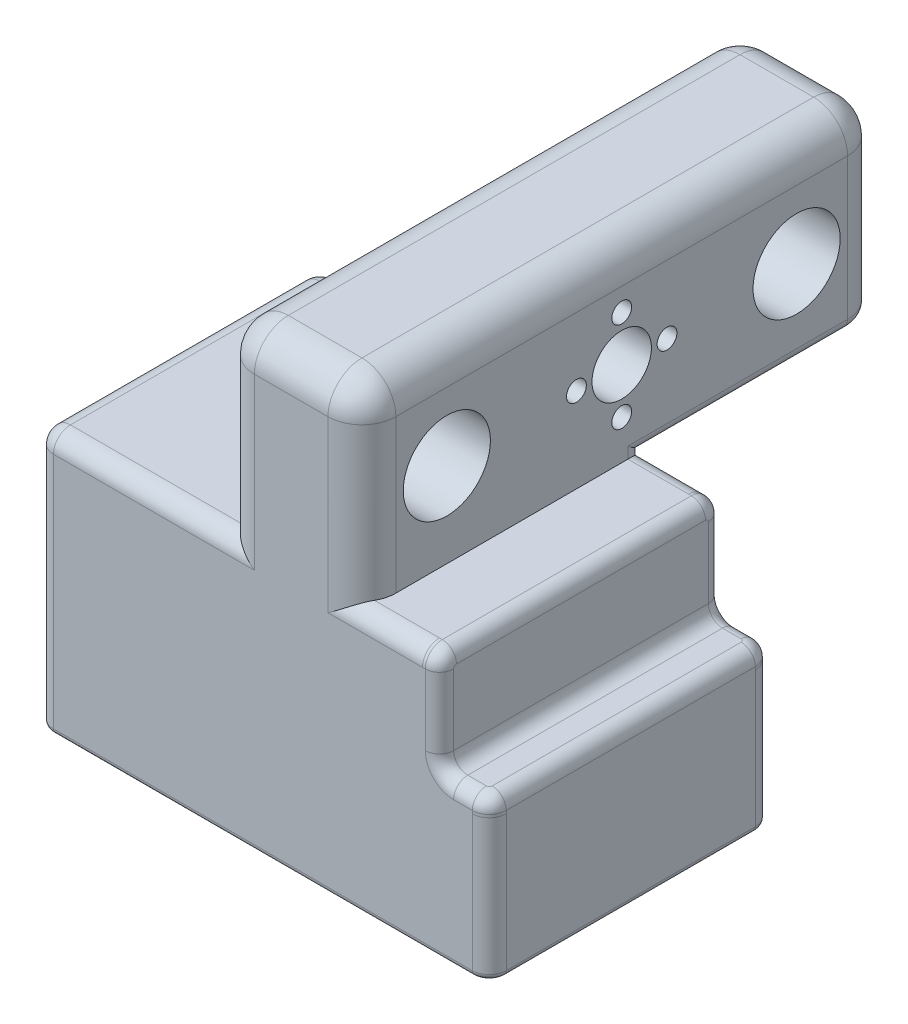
ISO-10303-21;
HEADER;
FILE_DESCRIPTION(('STEP AP214'),'2;1');
FILE_NAME('part.step','',(''),(''),'','','');
FILE_SCHEMA(('AUTOMOTIVE_DESIGN { 1 0 10303 214 1 1 1 1 }'));
ENDSEC;
DATA;
#1=APPLICATION_CONTEXT('core data for automotive mechanical design processes');
#2=APPLICATION_PROTOCOL_DEFINITION('international standard','automotive_design',2000,#1);
#3=PRODUCT_CONTEXT('',#1,'mechanical');
#4=PRODUCT('Part','Part','',(#3));
#5=PRODUCT_RELATED_PRODUCT_CATEGORY('part','',(#4));
#6=PRODUCT_DEFINITION_FORMATION('','',#4);
#7=PRODUCT_DEFINITION_CONTEXT('part definition',#1,'design');
#8=PRODUCT_DEFINITION('design','',#6,#7);
#9=PRODUCT_DEFINITION_SHAPE('','',#8);
#10=(LENGTH_UNIT() NAMED_UNIT(*) SI_UNIT(.MILLI.,.METRE.));
#11=(NAMED_UNIT(*) PLANE_ANGLE_UNIT() SI_UNIT($,.RADIAN.));
#12=(NAMED_UNIT(*) SI_UNIT($,.STERADIAN.) SOLID_ANGLE_UNIT());
#13=UNCERTAINTY_MEASURE_WITH_UNIT(LENGTH_MEASURE(1.E-05),#10,'distance_accuracy_value','');
#14=(GEOMETRIC_REPRESENTATION_CONTEXT(3) GLOBAL_UNCERTAINTY_ASSIGNED_CONTEXT((#13)) GLOBAL_UNIT_ASSIGNED_CONTEXT((#10,
#11,#12)) REPRESENTATION_CONTEXT('',''));
#15=CARTESIAN_POINT('',(0.,0.,0.));
#16=DIRECTION('',(0.,0.,1.));
#17=DIRECTION('',(1.,0.,0.));
#18=AXIS2_PLACEMENT_3D('',#15,#16,#17);
#19=CARTESIAN_POINT('',(-42.,-18.,-1.10000000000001));
#20=DIRECTION('',(0.,0.,-1.));
#21=DIRECTION('',(-1.,0.,0.));
#22=AXIS2_PLACEMENT_3D('',#19,#20,#21);
#23=PLANE('',#22);
#24=DIRECTION('',(0.,-1.,0.));
#25=VECTOR('',#24,1.);
#26=CARTESIAN_POINT('',(32.,-18.,-1.10000000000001));
#27=LINE('',#26,#25);
#28=CARTESIAN_POINT('',(32.,-36.,-1.10000000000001));
#29=VERTEX_POINT('',#28);
#30=CARTESIAN_POINT('',(32.,-36.8911891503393,-1.10000000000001));
#31=VERTEX_POINT('',#30);
#32=EDGE_CURVE('E1118',#29,#31,#27,.T.);
#33=ORIENTED_EDGE('',*,*,#32,.F.);
#34=DIRECTION('',(-1.,0.,0.));
#35=VECTOR('',#34,1.);
#36=CARTESIAN_POINT('',(-42.,-36.,-1.10000000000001));
#37=LINE('',#36,#35);
#38=CARTESIAN_POINT('',(31.4439115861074,-36.,-1.10000000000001));
#39=VERTEX_POINT('',#38);
#40=EDGE_CURVE('E2612',#29,#39,#37,.T.);
#41=ORIENTED_EDGE('',*,*,#40,.T.);
#42=CARTESIAN_POINT('',(25.8,-40.1408045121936,-1.10000000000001));
#43=DIRECTION('',(0.,0.,1.));
#44=DIRECTION('',(-1.,0.,0.));
#45=AXIS2_PLACEMENT_3D('',#42,#43,#44);
#46=CIRCLE('',#45,7.);
#47=EDGE_CURVE('E2537',#31,#39,#46,.T.);
#48=ORIENTED_EDGE('',*,*,#47,.F.);
#49=EDGE_LOOP('',(#33,#41,#48));
#50=FACE_BOUND('',#49,.T.);
#51=ADVANCED_FACE('F46',(#50),#23,.F.);
#52=CARTESIAN_POINT('',(25.8,-40.1408045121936,18.9));
#53=DIRECTION('',(0.,0.,-1.));
#54=DIRECTION('',(-1.,0.,0.));
#55=AXIS2_PLACEMENT_3D('',#52,#53,#54);
#56=CYLINDRICAL_SURFACE('',#55,7.);
#57=ORIENTED_EDGE('',*,*,#47,.T.);
#58=DIRECTION('',(0.,0.,-1.));
#59=VECTOR('',#58,1.);
#60=CARTESIAN_POINT('',(31.4439115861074,-36.,18.9));
#61=LINE('',#60,#59);
#62=CARTESIAN_POINT('',(31.4439115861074,-36.,18.9));
#63=VERTEX_POINT('',#62);
#64=EDGE_CURVE('E466',#39,#63,#61,.F.);
#65=ORIENTED_EDGE('',*,*,#64,.T.);
#66=CARTESIAN_POINT('',(25.8,-40.1408045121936,18.9));
#67=DIRECTION('',(0.,0.,1.));
#68=DIRECTION('',(-1.,0.,0.));
#69=AXIS2_PLACEMENT_3D('',#66,#67,#68);
#70=CIRCLE('',#69,7.);
#71=CARTESIAN_POINT('',(32.,-36.8911891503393,18.9));
#72=VERTEX_POINT('',#71);
#73=EDGE_CURVE('E2541',#72,#63,#70,.T.);
#74=ORIENTED_EDGE('',*,*,#73,.F.);
#75=DIRECTION('',(0.,0.,-1.));
#76=VECTOR('',#75,1.);
#77=CARTESIAN_POINT('',(32.,-36.8911891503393,18.9));
#78=LINE('',#77,#76);
#79=EDGE_CURVE('E1052',#72,#31,#78,.T.);
#80=ORIENTED_EDGE('',*,*,#79,.T.);
#81=EDGE_LOOP('',(#57,#65,#74,#80));
#82=FACE_BOUND('',#81,.T.);
#83=ADVANCED_FACE('F679',(#82),#56,.T.);
#84=CARTESIAN_POINT('',(-36.,-40.1408045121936,17.9));
#85=DIRECTION('',(0.,0.,-1.));
#86=DIRECTION('',(0.,1.,0.));
#87=AXIS2_PLACEMENT_3D('',#84,#85,#86);
#88=CYLINDRICAL_SURFACE('',#87,4.00000000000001);
#89=CARTESIAN_POINT('',(-36.,-40.1408045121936,-4.10000000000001));
#90=DIRECTION('',(0.,0.,-1.));
#91=DIRECTION('',(0.,1.,0.));
#92=AXIS2_PLACEMENT_3D('',#89,#90,#91);
#93=CIRCLE('',#92,4.00000000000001);
#94=CARTESIAN_POINT('',(-36.,-36.1408045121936,-4.10000000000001));
#95=VERTEX_POINT('',#94);
#96=EDGE_CURVE('E1095',#95,#95,#93,.T.);
#97=ORIENTED_EDGE('',*,*,#96,.T.);
#98=EDGE_LOOP('',(#97));
#99=FACE_BOUND('',#98,.T.);
#100=CARTESIAN_POINT('',(-36.,-40.1408045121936,16.9));
#101=DIRECTION('',(0.,0.,1.));
#102=DIRECTION('',(1.,0.,0.));
#103=AXIS2_PLACEMENT_3D('',#100,#101,#102);
#104=CIRCLE('',#103,4.00000000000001);
#105=CARTESIAN_POINT('',(-32.,-40.1408045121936,16.9));
#106=VERTEX_POINT('',#105);
#107=EDGE_CURVE('E1044',#106,#106,#104,.F.);
#108=ORIENTED_EDGE('',*,*,#107,.F.);
#109=EDGE_LOOP('',(#108));
#110=FACE_BOUND('',#109,.T.);
#111=ADVANCED_FACE('F686',(#99,#110),#88,.F.);
#112=CARTESIAN_POINT('',(25.8,-40.1408045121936,17.9));
#113=DIRECTION('',(0.,0.,-1.));
#114=DIRECTION('',(0.,1.,0.));
#115=AXIS2_PLACEMENT_3D('',#112,#113,#114);
#116=CYLINDRICAL_SURFACE('',#115,4.);
#117=CARTESIAN_POINT('',(25.8,-40.1408045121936,-4.10000000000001));
#118=DIRECTION('',(0.,0.,-1.));
#119=DIRECTION('',(0.,-1.,0.));
#120=AXIS2_PLACEMENT_3D('',#117,#118,#119);
#121=CIRCLE('',#120,4.);
#122=CARTESIAN_POINT('',(25.8,-44.1408045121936,-4.10000000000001));
#123=VERTEX_POINT('',#122);
#124=EDGE_CURVE('E1090',#123,#123,#121,.T.);
#125=ORIENTED_EDGE('',*,*,#124,.T.);
#126=EDGE_LOOP('',(#125));
#127=FACE_BOUND('',#126,.T.);
#128=CARTESIAN_POINT('',(25.8,-40.1408045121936,16.9));
#129=DIRECTION('',(0.,0.,1.));
#130=DIRECTION('',(1.,0.,0.));
#131=AXIS2_PLACEMENT_3D('',#128,#129,#130);
#132=CIRCLE('',#131,4.);
#133=CARTESIAN_POINT('',(29.8,-40.1408045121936,16.9));
#134=VERTEX_POINT('',#133);
#135=EDGE_CURVE('E1048',#134,#134,#132,.F.);
#136=ORIENTED_EDGE('',*,*,#135,.F.);
#137=EDGE_LOOP('',(#136));
#138=FACE_BOUND('',#137,.T.);
#139=ADVANCED_FACE('F695',(#127,#138),#116,.F.);
#140=CARTESIAN_POINT('',(10.4,-24.6408045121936,-1.10000000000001));
#141=DIRECTION('',(0.,0.,-1.));
#142=DIRECTION('',(-1.,0.,0.));
#143=AXIS2_PLACEMENT_3D('',#140,#141,#142);
#144=CIRCLE('',#143,1.68);
#145=CARTESIAN_POINT('',(8.71999999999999,-24.6408045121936,-1.10000000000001));
#146=VERTEX_POINT('',#145);
#147=EDGE_CURVE('E708',#146,#146,#144,.T.);
#148=ORIENTED_EDGE('',*,*,#147,.T.);
#149=EDGE_LOOP('',(#148));
#150=FACE_BOUND('',#149,.T.);
#151=CARTESIAN_POINT('',(-20.6,-24.6408045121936,-1.10000000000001));
#152=DIRECTION('',(0.,0.,-1.));
#153=DIRECTION('',(-1.,0.,0.));
#154=AXIS2_PLACEMENT_3D('',#151,#152,#153);
#155=CIRCLE('',#154,1.68);
#156=CARTESIAN_POINT('',(-22.28,-24.6408045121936,-1.10000000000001));
#157=VERTEX_POINT('',#156);
#158=EDGE_CURVE('E712',#157,#157,#155,.T.);
#159=ORIENTED_EDGE('',*,*,#158,.T.);
#160=EDGE_LOOP('',(#159));
#161=FACE_BOUND('',#160,.T.);
#162=CARTESIAN_POINT('',(-20.6,-55.6408045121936,-1.10000000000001));
#163=DIRECTION('',(0.,0.,-1.));
#164=DIRECTION('',(-1.,0.,0.));
#165=AXIS2_PLACEMENT_3D('',#162,#163,#164);
#166=CIRCLE('',#165,1.68);
#167=CARTESIAN_POINT('',(-22.28,-55.6408045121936,-1.10000000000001));
#168=VERTEX_POINT('',#167);
#169=EDGE_CURVE('E716',#168,#168,#166,.T.);
#170=ORIENTED_EDGE('',*,*,#169,.T.);
#171=EDGE_LOOP('',(#170));
#172=FACE_BOUND('',#171,.T.);
#173=CARTESIAN_POINT('',(10.4,-55.6408045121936,-1.10000000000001));
#174=DIRECTION('',(0.,0.,-1.));
#175=DIRECTION('',(-1.,0.,0.));
#176=AXIS2_PLACEMENT_3D('',#173,#174,#175);
#177=CIRCLE('',#176,1.68);
#178=CARTESIAN_POINT('',(8.71999999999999,-55.6408045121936,-1.10000000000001));
#179=VERTEX_POINT('',#178);
#180=EDGE_CURVE('E498',#179,#179,#177,.T.);
#181=ORIENTED_EDGE('',*,*,#180,.T.);
#182=EDGE_LOOP('',(#181));
#183=FACE_BOUND('',#182,.T.);
#184=DIRECTION('',(0.,-1.,0.));
#185=VECTOR('',#184,1.);
#186=CARTESIAN_POINT('',(6.19999999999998,-18.,-1.10000000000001));
#187=LINE('',#186,#185);
#188=CARTESIAN_POINT('',(6.19999999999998,-40.1408045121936,-1.10000000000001));
#189=VERTEX_POINT('',#188);
#190=CARTESIAN_POINT('',(6.19999999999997,-60.,-1.10000000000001));
#191=VERTEX_POINT('',#190);
#192=EDGE_CURVE('E497',#189,#191,#187,.T.);
#193=ORIENTED_EDGE('',*,*,#192,.T.);
#194=DIRECTION('',(1.,0.,0.));
#195=VECTOR('',#194,1.);
#196=CARTESIAN_POINT('',(32.,-60.,-1.10000000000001));
#197=LINE('',#196,#195);
#198=CARTESIAN_POINT('',(32.,-60.,-1.10000000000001));
#199=VERTEX_POINT('',#198);
#200=EDGE_CURVE('E725',#191,#199,#197,.T.);
#201=ORIENTED_EDGE('',*,*,#200,.T.);
#202=CARTESIAN_POINT('',(32.,-43.3904198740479,-1.10000000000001));
#203=VERTEX_POINT('',#202);
#204=EDGE_CURVE('E1120',#203,#199,#27,.T.);
#205=ORIENTED_EDGE('',*,*,#204,.F.);
#206=CARTESIAN_POINT('',(23.2,-33.6415737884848,-1.10000000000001));
#207=VERTEX_POINT('',#206);
#208=EDGE_CURVE('E2540',#207,#203,#46,.T.);
#209=ORIENTED_EDGE('',*,*,#208,.F.);
#210=DIRECTION('',(0.,1.,0.));
#211=VECTOR('',#210,1.);
#212=CARTESIAN_POINT('',(23.2,-18.,-1.10000000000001));
#213=LINE('',#212,#211);
#214=CARTESIAN_POINT('',(23.2,-18.,-1.10000000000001));
#215=VERTEX_POINT('',#214);
#216=EDGE_CURVE('E2623',#207,#215,#213,.T.);
#217=ORIENTED_EDGE('',*,*,#216,.T.);
#218=DIRECTION('',(1.,0.,0.));
#219=VECTOR('',#218,1.);
#220=CARTESIAN_POINT('',(-42.,-18.,-1.10000000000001));
#221=LINE('',#220,#219);
#222=CARTESIAN_POINT('',(-42.,-18.,-1.10000000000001));
#223=VERTEX_POINT('',#222);
#224=EDGE_CURVE('E1110',#223,#215,#221,.T.);
#225=ORIENTED_EDGE('',*,*,#224,.F.);
#226=DIRECTION('',(0.,-1.,0.));
#227=VECTOR('',#226,1.);
#228=CARTESIAN_POINT('',(-42.,-18.,-1.10000000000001));
#229=LINE('',#228,#227);
#230=CARTESIAN_POINT('',(-42.,-36.5352532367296,-1.10000000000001));
#231=VERTEX_POINT('',#230);
#232=EDGE_CURVE('E1121',#223,#231,#229,.T.);
#233=ORIENTED_EDGE('',*,*,#232,.T.);
#234=CARTESIAN_POINT('',(-36.,-40.1408045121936,-1.10000000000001));
#235=DIRECTION('',(0.,0.,1.));
#236=DIRECTION('',(1.,0.,0.));
#237=AXIS2_PLACEMENT_3D('',#234,#235,#236);
#238=CIRCLE('',#237,7.);
#239=CARTESIAN_POINT('',(-42.,-43.7463557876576,-1.10000000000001));
#240=VERTEX_POINT('',#239);
#241=EDGE_CURVE('E1084',#240,#231,#238,.T.);
#242=ORIENTED_EDGE('',*,*,#241,.F.);
#243=CARTESIAN_POINT('',(-42.,-60.,-1.10000000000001));
#244=VERTEX_POINT('',#243);
#245=EDGE_CURVE('E1124',#240,#244,#229,.T.);
#246=ORIENTED_EDGE('',*,*,#245,.T.);
#247=DIRECTION('',(1.,0.,0.));
#248=VECTOR('',#247,1.);
#249=CARTESIAN_POINT('',(-16.4,-60.,-1.10000000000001));
#250=LINE('',#249,#248);
#251=CARTESIAN_POINT('',(-16.4,-60.,-1.10000000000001));
#252=VERTEX_POINT('',#251);
#253=EDGE_CURVE('E747',#244,#252,#250,.T.);
#254=ORIENTED_EDGE('',*,*,#253,.T.);
#255=DIRECTION('',(0.,1.,0.));
#256=VECTOR('',#255,1.);
#257=CARTESIAN_POINT('',(-16.4,-18.,-1.10000000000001));
#258=LINE('',#257,#256);
#259=CARTESIAN_POINT('',(-16.4,-40.1408045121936,-1.10000000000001));
#260=VERTEX_POINT('',#259);
#261=EDGE_CURVE('E1062',#252,#260,#258,.T.);
#262=ORIENTED_EDGE('',*,*,#261,.T.);
#263=CARTESIAN_POINT('',(-5.10000000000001,-40.1408045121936,-1.10000000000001));
#264=DIRECTION('',(0.,0.,-1.));
#265=DIRECTION('',(-1.,0.,0.));
#266=AXIS2_PLACEMENT_3D('',#263,#264,#265);
#267=CIRCLE('',#266,11.3);
#268=EDGE_CURVE('E728',#260,#189,#267,.T.);
#269=ORIENTED_EDGE('',*,*,#268,.T.);
#270=EDGE_LOOP('',(#193,#201,#205,#209,#217,#225,#233,#242,#246,#254,#262,#269));
#271=FACE_BOUND('',#270,.T.);
#272=ADVANCED_FACE('F682',(#150,#161,#172,#183,#271),#23,.F.);
#273=CARTESIAN_POINT('',(32.,-18.,-1.10000000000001));
#274=DIRECTION('',(1.,0.,0.));
#275=DIRECTION('',(0.,0.,-1.));
#276=AXIS2_PLACEMENT_3D('',#273,#274,#275);
#277=PLANE('',#276);
#278=ORIENTED_EDGE('',*,*,#204,.T.);
#279=DIRECTION('',(0.,0.,1.));
#280=VECTOR('',#279,1.);
#281=CARTESIAN_POINT('',(32.,-60.,42.9));
#282=LINE('',#281,#280);
#283=CARTESIAN_POINT('',(32.,-60.,42.9));
#284=VERTEX_POINT('',#283);
#285=EDGE_CURVE('E746',#199,#284,#282,.T.);
#286=ORIENTED_EDGE('',*,*,#285,.T.);
#287=DIRECTION('',(0.,-1.,0.));
#288=VECTOR('',#287,1.);
#289=CARTESIAN_POINT('',(32.,-18.,42.9));
#290=LINE('',#289,#288);
#291=CARTESIAN_POINT('',(32.,-36.,42.9));
#292=VERTEX_POINT('',#291);
#293=EDGE_CURVE('E1114',#292,#284,#290,.T.);
#294=ORIENTED_EDGE('',*,*,#293,.F.);
#295=DIRECTION('',(0.,0.,-1.));
#296=VECTOR('',#295,1.);
#297=CARTESIAN_POINT('',(32.,-36.,-1.10000000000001));
#298=LINE('',#297,#296);
#299=EDGE_CURVE('E2607',#292,#29,#298,.T.);
#300=ORIENTED_EDGE('',*,*,#299,.T.);
#301=ORIENTED_EDGE('',*,*,#32,.T.);
#302=ORIENTED_EDGE('',*,*,#79,.F.);
#303=DIRECTION('',(0.,1.,0.));
#304=VECTOR('',#303,1.);
#305=CARTESIAN_POINT('',(32.,-18.,18.9));
#306=LINE('',#305,#304);
#307=CARTESIAN_POINT('',(32.,-43.3904198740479,18.9));
#308=VERTEX_POINT('',#307);
#309=EDGE_CURVE('E1049',#308,#72,#306,.T.);
#310=ORIENTED_EDGE('',*,*,#309,.F.);
#311=DIRECTION('',(0.,0.,-1.));
#312=VECTOR('',#311,1.);
#313=CARTESIAN_POINT('',(32.,-43.3904198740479,18.9));
#314=LINE('',#313,#312);
#315=EDGE_CURVE('E1045',#203,#308,#314,.F.);
#316=ORIENTED_EDGE('',*,*,#315,.F.);
#317=EDGE_LOOP('',(#278,#286,#294,#300,#301,#302,#310,#316));
#318=FACE_BOUND('',#317,.T.);
#319=ADVANCED_FACE('F694',(#318),#277,.F.);
#320=CARTESIAN_POINT('',(-42.,-18.,42.9));
#321=DIRECTION('',(-1.,0.,0.));
#322=DIRECTION('',(0.,0.,1.));
#323=AXIS2_PLACEMENT_3D('',#320,#321,#322);
#324=PLANE('',#323);
#325=DIRECTION('',(0.,-1.,0.));
#326=VECTOR('',#325,1.);
#327=CARTESIAN_POINT('',(-42.,-18.,42.9));
#328=LINE('',#327,#326);
#329=CARTESIAN_POINT('',(-42.,-18.,42.9));
#330=VERTEX_POINT('',#329);
#331=CARTESIAN_POINT('',(-42.,-60.,42.9));
#332=VERTEX_POINT('',#331);
#333=EDGE_CURVE('E1113',#330,#332,#328,.T.);
#334=ORIENTED_EDGE('',*,*,#333,.T.);
#335=DIRECTION('',(0.,0.,-1.));
#336=VECTOR('',#335,1.);
#337=CARTESIAN_POINT('',(-42.,-60.,-1.10000000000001));
#338=LINE('',#337,#336);
#339=EDGE_CURVE('E755',#332,#244,#338,.T.);
#340=ORIENTED_EDGE('',*,*,#339,.T.);
#341=ORIENTED_EDGE('',*,*,#245,.F.);
#342=DIRECTION('',(0.,0.,-1.));
#343=VECTOR('',#342,1.);
#344=CARTESIAN_POINT('',(-42.,-43.7463557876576,18.9));
#345=LINE('',#344,#343);
#346=CARTESIAN_POINT('',(-42.,-43.7463557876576,18.9));
#347=VERTEX_POINT('',#346);
#348=EDGE_CURVE('E1060',#347,#240,#345,.T.);
#349=ORIENTED_EDGE('',*,*,#348,.F.);
#350=DIRECTION('',(0.,1.,0.));
#351=VECTOR('',#350,1.);
#352=CARTESIAN_POINT('',(-42.,-18.,18.9));
#353=LINE('',#352,#351);
#354=CARTESIAN_POINT('',(-42.,-36.5352532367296,18.9));
#355=VERTEX_POINT('',#354);
#356=EDGE_CURVE('E1057',#347,#355,#353,.T.);
#357=ORIENTED_EDGE('',*,*,#356,.T.);
#358=DIRECTION('',(0.,0.,-1.));
#359=VECTOR('',#358,1.);
#360=CARTESIAN_POINT('',(-42.,-36.5352532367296,18.9));
#361=LINE('',#360,#359);
#362=EDGE_CURVE('E1055',#231,#355,#361,.F.);
#363=ORIENTED_EDGE('',*,*,#362,.F.);
#364=ORIENTED_EDGE('',*,*,#232,.F.);
#365=DIRECTION('',(0.,0.,-1.));
#366=VECTOR('',#365,1.);
#367=CARTESIAN_POINT('',(-42.,-18.,42.9));
#368=LINE('',#367,#366);
#369=EDGE_CURVE('E1107',#330,#223,#368,.T.);
#370=ORIENTED_EDGE('',*,*,#369,.F.);
#371=EDGE_LOOP('',(#334,#340,#341,#349,#357,#363,#364,#370));
#372=FACE_BOUND('',#371,.T.);
#373=ADVANCED_FACE('F701',(#372),#324,.F.);
#374=CARTESIAN_POINT('',(-6.49999999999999,-15.,39.9));
#375=DIRECTION('',(0.,1.,0.));
#376=DIRECTION('',(0.,0.,1.));
#377=AXIS2_PLACEMENT_3D('',#374,#375,#376);
#378=PLANE('',#377);
#379=CARTESIAN_POINT('',(6.5,-15.,-39.9));
#380=DIRECTION('',(0.,1.,0.));
#381=DIRECTION('',(0.,0.,1.));
#382=AXIS2_PLACEMENT_3D('',#379,#380,#381);
#383=CIRCLE('',#382,4.);
#384=CARTESIAN_POINT('',(6.5,-15.,-43.9));
#385=VERTEX_POINT('',#384);
#386=CARTESIAN_POINT('',(10.5,-15.,-39.9));
#387=VERTEX_POINT('',#386);
#388=EDGE_CURVE('E806',#385,#387,#383,.F.);
#389=ORIENTED_EDGE('',*,*,#388,.T.);
#390=DIRECTION('',(0.,0.,-1.));
#391=VECTOR('',#390,1.);
#392=CARTESIAN_POINT('',(10.5,-15.,-4.10000000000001));
#393=LINE('',#392,#391);
#394=CARTESIAN_POINT('',(10.5,-15.,-3.92842712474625));
#395=VERTEX_POINT('',#394);
#396=EDGE_CURVE('E61',#387,#395,#393,.F.);
#397=ORIENTED_EDGE('',*,*,#396,.T.);
#398=CARTESIAN_POINT('',(9.5,-15.,-1.10000000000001));
#399=DIRECTION('',(0.,1.,0.));
#400=DIRECTION('',(0.,0.,1.));
#401=AXIS2_PLACEMENT_3D('',#398,#399,#400);
#402=CIRCLE('',#401,3.);
#403=CARTESIAN_POINT('',(9.49999999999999,-15.,-4.10000000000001));
#404=VERTEX_POINT('',#403);
#405=EDGE_CURVE('E660',#395,#404,#402,.T.);
#406=ORIENTED_EDGE('',*,*,#405,.T.);
#407=DIRECTION('',(1.,0.,0.));
#408=VECTOR('',#407,1.);
#409=CARTESIAN_POINT('',(-45.,-15.,-4.10000000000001));
#410=LINE('',#409,#408);
#411=CARTESIAN_POINT('',(-9.50000000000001,-15.,-4.10000000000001));
#412=VERTEX_POINT('',#411);
#413=EDGE_CURVE('E1127',#412,#404,#410,.T.);
#414=ORIENTED_EDGE('',*,*,#413,.F.);
#415=CARTESIAN_POINT('',(-9.49999999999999,-15.,-1.10000000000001));
#416=DIRECTION('',(0.,1.,0.));
#417=DIRECTION('',(0.,0.,1.));
#418=AXIS2_PLACEMENT_3D('',#415,#416,#417);
#419=CIRCLE('',#418,3.);
#420=CARTESIAN_POINT('',(-10.5,-15.,-3.9284271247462));
#421=VERTEX_POINT('',#420);
#422=EDGE_CURVE('E1414',#412,#421,#419,.T.);
#423=ORIENTED_EDGE('',*,*,#422,.T.);
#424=DIRECTION('',(0.,0.,1.));
#425=VECTOR('',#424,1.);
#426=CARTESIAN_POINT('',(-10.5,-15.,-39.9));
#427=LINE('',#426,#425);
#428=CARTESIAN_POINT('',(-10.5,-15.,-39.9));
#429=VERTEX_POINT('',#428);
#430=EDGE_CURVE('E802',#421,#429,#427,.F.);
#431=ORIENTED_EDGE('',*,*,#430,.T.);
#432=CARTESIAN_POINT('',(-6.5,-15.,-39.9));
#433=DIRECTION('',(0.,1.,0.));
#434=DIRECTION('',(0.,0.,1.));
#435=AXIS2_PLACEMENT_3D('',#432,#433,#434);
#436=CIRCLE('',#435,4.);
#437=CARTESIAN_POINT('',(-6.5,-15.,-43.9));
#438=VERTEX_POINT('',#437);
#439=EDGE_CURVE('E800',#429,#438,#436,.F.);
#440=ORIENTED_EDGE('',*,*,#439,.T.);
#441=DIRECTION('',(-1.,0.,0.));
#442=VECTOR('',#441,1.);
#443=CARTESIAN_POINT('',(6.5,-15.,-43.9));
#444=LINE('',#443,#442);
#445=EDGE_CURVE('E804',#438,#385,#444,.F.);
#446=ORIENTED_EDGE('',*,*,#445,.T.);
#447=EDGE_LOOP('',(#389,#397,#406,#414,#423,#431,#440,#446));
#448=FACE_BOUND('',#447,.T.);
#449=ADVANCED_FACE('F1411',(#448),#378,.F.);
#450=CARTESIAN_POINT('',(15.,0.,8.));
#451=DIRECTION('',(-1.,0.,0.));
#452=DIRECTION('',(0.,0.,1.));
#453=AXIS2_PLACEMENT_3D('',#450,#451,#452);
#454=CYLINDRICAL_SURFACE('',#453,1.75);
#455=CARTESIAN_POINT('',(12.5,0.,8.));
#456=DIRECTION('',(1.,0.,0.));
#457=DIRECTION('',(0.,0.,-1.));
#458=AXIS2_PLACEMENT_3D('',#455,#456,#457);
#459=CIRCLE('',#458,1.75);
#460=CARTESIAN_POINT('',(12.5,0.,6.25));
#461=VERTEX_POINT('',#460);
#462=EDGE_CURVE('E1236',#461,#461,#459,.F.);
#463=ORIENTED_EDGE('',*,*,#462,.F.);
#464=EDGE_LOOP('',(#463));
#465=FACE_BOUND('',#464,.T.);
#466=CARTESIAN_POINT('',(-8.99999999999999,0.,8.));
#467=DIRECTION('',(-1.,0.,0.));
#468=DIRECTION('',(0.,0.,1.));
#469=AXIS2_PLACEMENT_3D('',#466,#467,#468);
#470=CIRCLE('',#469,1.75);
#471=CARTESIAN_POINT('',(-8.99999999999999,0.,9.75));
#472=VERTEX_POINT('',#471);
#473=EDGE_CURVE('E1149',#472,#472,#470,.T.);
#474=ORIENTED_EDGE('',*,*,#473,.T.);
#475=EDGE_LOOP('',(#474));
#476=FACE_BOUND('',#475,.T.);
#477=ADVANCED_FACE('F1466',(#465,#476),#454,.F.);
#478=CARTESIAN_POINT('',(15.,0.,0.));
#479=DIRECTION('',(-1.,0.,0.));
#480=DIRECTION('',(0.,0.,1.));
#481=AXIS2_PLACEMENT_3D('',#478,#479,#480);
#482=CYLINDRICAL_SURFACE('',#481,5.25);
#483=CARTESIAN_POINT('',(-8.99999999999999,0.,0.));
#484=DIRECTION('',(-1.,0.,0.));
#485=DIRECTION('',(0.,0.,1.));
#486=AXIS2_PLACEMENT_3D('',#483,#484,#485);
#487=CIRCLE('',#486,5.25);
#488=CARTESIAN_POINT('',(-8.99999999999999,0.,5.25));
#489=VERTEX_POINT('',#488);
#490=EDGE_CURVE('E1139',#489,#489,#487,.T.);
#491=ORIENTED_EDGE('',*,*,#490,.T.);
#492=EDGE_LOOP('',(#491));
#493=FACE_BOUND('',#492,.T.);
#494=CARTESIAN_POINT('',(12.5,0.,0.));
#495=DIRECTION('',(1.,0.,0.));
#496=DIRECTION('',(0.,0.,-1.));
#497=AXIS2_PLACEMENT_3D('',#494,#495,#496);
#498=CIRCLE('',#497,5.25);
#499=CARTESIAN_POINT('',(12.5,0.,-5.25));
#500=VERTEX_POINT('',#499);
#501=EDGE_CURVE('E1239',#500,#500,#498,.F.);
#502=ORIENTED_EDGE('',*,*,#501,.F.);
#503=EDGE_LOOP('',(#502));
#504=FACE_BOUND('',#503,.T.);
#505=ADVANCED_FACE('F1462',(#493,#504),#482,.F.);
#506=CARTESIAN_POINT('',(15.,8.,0.));
#507=DIRECTION('',(-1.,0.,0.));
#508=DIRECTION('',(0.,0.,1.));
#509=AXIS2_PLACEMENT_3D('',#506,#507,#508);
#510=CYLINDRICAL_SURFACE('',#509,1.75);
#511=CARTESIAN_POINT('',(12.5,8.,0.));
#512=DIRECTION('',(1.,0.,0.));
#513=DIRECTION('',(0.,0.,-1.));
#514=AXIS2_PLACEMENT_3D('',#511,#512,#513);
#515=CIRCLE('',#514,1.75);
#516=CARTESIAN_POINT('',(12.5,8.,-1.75000000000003));
#517=VERTEX_POINT('',#516);
#518=EDGE_CURVE('E1242',#517,#517,#515,.F.);
#519=ORIENTED_EDGE('',*,*,#518,.F.);
#520=EDGE_LOOP('',(#519));
#521=FACE_BOUND('',#520,.T.);
#522=CARTESIAN_POINT('',(-8.99999999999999,8.,0.));
#523=DIRECTION('',(-1.,0.,0.));
#524=DIRECTION('',(0.,0.,1.));
#525=AXIS2_PLACEMENT_3D('',#522,#523,#524);
#526=CIRCLE('',#525,1.75);
#527=CARTESIAN_POINT('',(-8.99999999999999,8.,1.74999999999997));
#528=VERTEX_POINT('',#527);
#529=EDGE_CURVE('E1146',#528,#528,#526,.T.);
#530=ORIENTED_EDGE('',*,*,#529,.T.);
#531=EDGE_LOOP('',(#530));
#532=FACE_BOUND('',#531,.T.);
#533=ADVANCED_FACE('F1465',(#521,#532),#510,.F.);
#534=CARTESIAN_POINT('',(15.,0.,-8.));
#535=DIRECTION('',(-1.,0.,0.));
#536=DIRECTION('',(0.,0.,1.));
#537=AXIS2_PLACEMENT_3D('',#534,#535,#536);
#538=CYLINDRICAL_SURFACE('',#537,1.75);
#539=CARTESIAN_POINT('',(12.5,0.,-8.));
#540=DIRECTION('',(1.,0.,0.));
#541=DIRECTION('',(0.,0.,-1.));
#542=AXIS2_PLACEMENT_3D('',#539,#540,#541);
#543=CIRCLE('',#542,1.75);
#544=CARTESIAN_POINT('',(12.5,0.,-9.75));
#545=VERTEX_POINT('',#544);
#546=EDGE_CURVE('E1245',#545,#545,#543,.F.);
#547=ORIENTED_EDGE('',*,*,#546,.F.);
#548=EDGE_LOOP('',(#547));
#549=FACE_BOUND('',#548,.T.);
#550=CARTESIAN_POINT('',(-8.99999999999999,0.,-8.));
#551=DIRECTION('',(-1.,0.,0.));
#552=DIRECTION('',(0.,0.,1.));
#553=AXIS2_PLACEMENT_3D('',#550,#551,#552);
#554=CIRCLE('',#553,1.75);
#555=CARTESIAN_POINT('',(-8.99999999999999,0.,-6.25));
#556=VERTEX_POINT('',#555);
#557=EDGE_CURVE('E1143',#556,#556,#554,.T.);
#558=ORIENTED_EDGE('',*,*,#557,.T.);
#559=EDGE_LOOP('',(#558));
#560=FACE_BOUND('',#559,.T.);
#561=ADVANCED_FACE('F1492',(#549,#560),#538,.F.);
#562=CARTESIAN_POINT('',(15.,-8.,0.));
#563=DIRECTION('',(-1.,0.,0.));
#564=DIRECTION('',(0.,0.,1.));
#565=AXIS2_PLACEMENT_3D('',#562,#563,#564);
#566=CYLINDRICAL_SURFACE('',#565,1.75);
#567=CARTESIAN_POINT('',(12.5,-8.,0.));
#568=DIRECTION('',(1.,0.,0.));
#569=DIRECTION('',(0.,0.,-1.));
#570=AXIS2_PLACEMENT_3D('',#567,#568,#569);
#571=CIRCLE('',#570,1.75);
#572=CARTESIAN_POINT('',(12.5,-8.,-1.74999999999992));
#573=VERTEX_POINT('',#572);
#574=EDGE_CURVE('E1248',#573,#573,#571,.F.);
#575=ORIENTED_EDGE('',*,*,#574,.F.);
#576=EDGE_LOOP('',(#575));
#577=FACE_BOUND('',#576,.T.);
#578=CARTESIAN_POINT('',(-8.99999999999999,-8.,0.));
#579=DIRECTION('',(-1.,0.,0.));
#580=DIRECTION('',(0.,0.,1.));
#581=AXIS2_PLACEMENT_3D('',#578,#579,#580);
#582=CIRCLE('',#581,1.75);
#583=CARTESIAN_POINT('',(-8.99999999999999,-8.,1.75000000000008));
#584=VERTEX_POINT('',#583);
#585=EDGE_CURVE('E1142',#584,#584,#582,.T.);
#586=ORIENTED_EDGE('',*,*,#585,.T.);
#587=EDGE_LOOP('',(#586));
#588=FACE_BOUND('',#587,.T.);
#589=ADVANCED_FACE('F1296',(#577,#588),#566,.F.);
#590=CARTESIAN_POINT('',(-6.49999999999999,-15.,39.9));
#591=DIRECTION('',(0.,1.,0.));
#592=DIRECTION('',(0.,0.,1.));
#593=AXIS2_PLACEMENT_3D('',#590,#591,#592);
#594=CYLINDRICAL_SURFACE('',#593,6.);
#595=DIRECTION('',(0.,1.,0.));
#596=VECTOR('',#595,1.);
#597=CARTESIAN_POINT('',(-6.49999999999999,-15.,45.9));
#598=LINE('',#597,#596);
#599=CARTESIAN_POINT('',(-6.49999999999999,-18.,45.9));
#600=VERTEX_POINT('',#599);
#601=CARTESIAN_POINT('',(-6.49999999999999,12.,45.9));
#602=VERTEX_POINT('',#601);
#603=EDGE_CURVE('E1163',#600,#602,#598,.T.);
#604=ORIENTED_EDGE('',*,*,#603,.T.);
#605=CARTESIAN_POINT('',(-6.49999999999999,12.,39.9));
#606=DIRECTION('',(0.,1.,0.));
#607=DIRECTION('',(0.,0.,1.));
#608=AXIS2_PLACEMENT_3D('',#605,#606,#607);
#609=CIRCLE('',#608,6.);
#610=CARTESIAN_POINT('',(-12.5,12.,39.9));
#611=VERTEX_POINT('',#610);
#612=EDGE_CURVE('E1131',#602,#611,#609,.F.);
#613=ORIENTED_EDGE('',*,*,#612,.T.);
#614=DIRECTION('',(0.,1.,0.));
#615=VECTOR('',#614,1.);
#616=CARTESIAN_POINT('',(-12.5,-15.,39.9));
#617=LINE('',#616,#615);
#618=CARTESIAN_POINT('',(-12.5,-15.,39.9));
#619=VERTEX_POINT('',#618);
#620=EDGE_CURVE('E1164',#619,#611,#617,.T.);
#621=ORIENTED_EDGE('',*,*,#620,.F.);
#622=CARTESIAN_POINT('',(-6.49999999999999,-15.,39.9));
#623=DIRECTION('',(0.,1.,0.));
#624=DIRECTION('',(0.,0.,1.));
#625=AXIS2_PLACEMENT_3D('',#622,#623,#624);
#626=CIRCLE('',#625,6.);
#627=CARTESIAN_POINT('',(-11.6961524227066,-15.,42.9));
#628=VERTEX_POINT('',#627);
#629=EDGE_CURVE('E1153',#619,#628,#626,.T.);
#630=ORIENTED_EDGE('',*,*,#629,.T.);
#631=CARTESIAN_POINT('',(-11.6961524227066,-15.,42.9));
#632=CARTESIAN_POINT('',(-11.6313179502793,-14.9999992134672,43.0123774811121));
#633=CARTESIAN_POINT('',(-11.5628460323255,-15.0063094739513,43.1224816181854));
#634=CARTESIAN_POINT('',(-11.4197244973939,-15.0300402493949,43.3369692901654));
#635=CARTESIAN_POINT('',(-11.3450909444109,-15.047432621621,43.4413665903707));
#636=CARTESIAN_POINT('',(-11.1914305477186,-15.0915367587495,43.6425032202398));
#637=CARTESIAN_POINT('',(-11.1124749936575,-15.118122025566,43.7393256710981));
#638=CARTESIAN_POINT('',(-10.9500320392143,-15.1793563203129,43.9264842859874));
#639=CARTESIAN_POINT('',(-10.8665413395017,-15.2140112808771,44.0168156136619));
#640=CARTESIAN_POINT('',(-10.6795318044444,-15.2974415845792,44.207267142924));
#641=CARTESIAN_POINT('',(-10.5752228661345,-15.3476488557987,44.3059836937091));
#642=CARTESIAN_POINT('',(-10.3622916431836,-15.4560660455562,44.4937864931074));
#643=CARTESIAN_POINT('',(-10.2536692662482,-15.5142761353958,44.5828725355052));
#644=CARTESIAN_POINT('',(-9.92126546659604,-15.6994485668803,44.8368986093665));
#645=CARTESIAN_POINT('',(-9.691996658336,-15.836462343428,44.9875569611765));
#646=CARTESIAN_POINT('',(-9.29396357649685,-16.0846591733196,45.2131444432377));
#647=CARTESIAN_POINT('',(-9.12743996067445,-16.1914376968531,45.2972781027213));
#648=CARTESIAN_POINT('',(-8.79089535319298,-16.4116055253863,45.4484963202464));
#649=CARTESIAN_POINT('',(-8.62087282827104,-16.5249977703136,45.5155732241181));
#650=CARTESIAN_POINT('',(-8.27867941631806,-16.7563311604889,45.6331488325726));
#651=CARTESIAN_POINT('',(-8.1065121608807,-16.8742651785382,45.6836724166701));
#652=CARTESIAN_POINT('',(-7.76059195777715,-17.1133359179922,45.7687828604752));
#653=CARTESIAN_POINT('',(-7.58683972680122,-17.2344712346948,45.8033765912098));
#654=CARTESIAN_POINT('',(-7.26301783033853,-17.4614180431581,45.8532101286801));
#655=CARTESIAN_POINT('',(-7.11307582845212,-17.5669725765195,45.8704958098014));
#656=CARTESIAN_POINT('',(-6.8129603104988,-17.7787100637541,45.8937198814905));
#657=CARTESIAN_POINT('',(-6.66278720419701,-17.8848922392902,45.8996701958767));
#658=CARTESIAN_POINT('',(-6.5084327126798,-17.9940371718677,45.8999955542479));
#659=CARTESIAN_POINT('',(-6.50421633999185,-17.9970185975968,45.8999999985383));
#660=CARTESIAN_POINT('',(-6.49999999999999,-18.,45.9));
#661=B_SPLINE_CURVE_WITH_KNOTS('',3,(#631,#632,#633,#634,#635,#636,#637,#638,#639,#640,#641,
#642,#643,#644,#645,#646,#647,#648,#649,#650,#651,#652,#653,#654,#655,#656,#657,#658,#659,#660),
.UNSPECIFIED.,.F.,.F.,(4,2,2,2,2,2,2,2,2,2,2,2,2,2,4),(0.,0.388776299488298,0.77656922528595,
1.15922537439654,1.54216373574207,1.99790057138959,2.4536471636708,3.36977457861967,
4.01397042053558,4.65845483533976,5.30196610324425,5.94519954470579,6.4974195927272,
7.04905843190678,7.06455037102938),.UNSPECIFIED.);
#662=EDGE_CURVE('E1277',#628,#600,#661,.T.);
#663=ORIENTED_EDGE('',*,*,#662,.T.);
#664=EDGE_LOOP('',(#604,#613,#621,#630,#663));
#665=FACE_BOUND('',#664,.T.);
#666=ADVANCED_FACE('F1291',(#665),#594,.T.);
#667=CARTESIAN_POINT('',(-12.5,-15.,-39.9));
#668=DIRECTION('',(-1.,0.,0.));
#669=DIRECTION('',(0.,0.,1.));
#670=AXIS2_PLACEMENT_3D('',#667,#668,#669);
#671=PLANE('',#670);
#672=CARTESIAN_POINT('',(-12.5,0.,30.9));
#673=DIRECTION('',(-1.,0.,0.));
#674=DIRECTION('',(0.,0.,1.));
#675=AXIS2_PLACEMENT_3D('',#672,#673,#674);
#676=CIRCLE('',#675,8.7);
#677=CARTESIAN_POINT('',(-12.5,0.,39.6));
#678=VERTEX_POINT('',#677);
#679=EDGE_CURVE('E54',#678,#678,#676,.F.);
#680=ORIENTED_EDGE('',*,*,#679,.T.);
#681=EDGE_LOOP('',(#680));
#682=FACE_BOUND('',#681,.T.);
#683=CARTESIAN_POINT('',(-12.5,0.,-30.9));
#684=DIRECTION('',(-1.,0.,0.));
#685=DIRECTION('',(0.,0.,1.));
#686=AXIS2_PLACEMENT_3D('',#683,#684,#685);
#687=CIRCLE('',#686,8.7);
#688=CARTESIAN_POINT('',(-12.5,0.,-22.2));
#689=VERTEX_POINT('',#688);
#690=EDGE_CURVE('E1431',#689,#689,#687,.F.);
#691=ORIENTED_EDGE('',*,*,#690,.T.);
#692=EDGE_LOOP('',(#691));
#693=FACE_BOUND('',#692,.T.);
#694=CARTESIAN_POINT('',(-12.5,0.,0.));
#695=DIRECTION('',(-1.,0.,0.));
#696=DIRECTION('',(0.,0.,1.));
#697=AXIS2_PLACEMENT_3D('',#694,#695,#696);
#698=CIRCLE('',#697,11.25);
#699=CARTESIAN_POINT('',(-12.5,0.,11.25));
#700=VERTEX_POINT('',#699);
#701=EDGE_CURVE('E1132',#700,#700,#698,.T.);
#702=ORIENTED_EDGE('',*,*,#701,.F.);
#703=EDGE_LOOP('',(#702));
#704=FACE_BOUND('',#703,.T.);
#705=DIRECTION('',(0.,1.,0.));
#706=VECTOR('',#705,1.);
#707=CARTESIAN_POINT('',(-12.5,-15.,-39.9));
#708=LINE('',#707,#706);
#709=CARTESIAN_POINT('',(-12.5,-13.,-39.9));
#710=VERTEX_POINT('',#709);
#711=CARTESIAN_POINT('',(-12.5,12.,-39.9));
#712=VERTEX_POINT('',#711);
#713=EDGE_CURVE('E1168',#710,#712,#708,.T.);
#714=ORIENTED_EDGE('',*,*,#713,.F.);
#715=DIRECTION('',(0.,0.,1.));
#716=VECTOR('',#715,1.);
#717=CARTESIAN_POINT('',(-12.5,-13.,-1.1));
#718=LINE('',#717,#716);
#719=CARTESIAN_POINT('',(-12.5,-13.,-1.1));
#720=VERTEX_POINT('',#719);
#721=EDGE_CURVE('E815',#710,#720,#718,.T.);
#722=ORIENTED_EDGE('',*,*,#721,.T.);
#723=DIRECTION('',(0.,1.,0.));
#724=VECTOR('',#723,1.);
#725=CARTESIAN_POINT('',(-12.5,-14.,-1.10000000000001));
#726=LINE('',#725,#724);
#727=CARTESIAN_POINT('',(-12.5,-15.,-1.1));
#728=VERTEX_POINT('',#727);
#729=EDGE_CURVE('E813',#720,#728,#726,.F.);
#730=ORIENTED_EDGE('',*,*,#729,.T.);
#731=DIRECTION('',(0.,0.,1.));
#732=VECTOR('',#731,1.);
#733=CARTESIAN_POINT('',(-12.5,-15.,-39.9));
#734=LINE('',#733,#732);
#735=EDGE_CURVE('E1161',#728,#619,#734,.T.);
#736=ORIENTED_EDGE('',*,*,#735,.T.);
#737=ORIENTED_EDGE('',*,*,#620,.T.);
#738=DIRECTION('',(0.,0.,1.));
#739=VECTOR('',#738,1.);
#740=CARTESIAN_POINT('',(-12.5,12.,-39.9));
#741=LINE('',#740,#739);
#742=EDGE_CURVE('E1192',#611,#712,#741,.F.);
#743=ORIENTED_EDGE('',*,*,#742,.T.);
#744=EDGE_LOOP('',(#714,#722,#730,#736,#737,#743));
#745=FACE_BOUND('',#744,.T.);
#746=ADVANCED_FACE('F1295',(#682,#693,#704,#745),#671,.T.);
#747=CARTESIAN_POINT('',(-6.5,-15.,-39.9));
#748=DIRECTION('',(0.,1.,0.));
#749=DIRECTION('',(0.,0.,1.));
#750=AXIS2_PLACEMENT_3D('',#747,#748,#749);
#751=CYLINDRICAL_SURFACE('',#750,6.);
#752=DIRECTION('',(0.,1.,0.));
#753=VECTOR('',#752,1.);
#754=CARTESIAN_POINT('',(-6.5,-15.,-45.9));
#755=LINE('',#754,#753);
#756=CARTESIAN_POINT('',(-6.5,-13.,-45.9));
#757=VERTEX_POINT('',#756);
#758=CARTESIAN_POINT('',(-6.5,12.,-45.9));
#759=VERTEX_POINT('',#758);
#760=EDGE_CURVE('E1170',#757,#759,#755,.T.);
#761=ORIENTED_EDGE('',*,*,#760,.F.);
#762=CARTESIAN_POINT('',(-6.5,-13.,-39.9));
#763=DIRECTION('',(0.,1.,0.));
#764=DIRECTION('',(0.,0.,1.));
#765=AXIS2_PLACEMENT_3D('',#762,#763,#764);
#766=CIRCLE('',#765,6.);
#767=EDGE_CURVE('E818',#757,#710,#766,.T.);
#768=ORIENTED_EDGE('',*,*,#767,.T.);
#769=ORIENTED_EDGE('',*,*,#713,.T.);
#770=CARTESIAN_POINT('',(-6.5,12.,-39.9));
#771=DIRECTION('',(0.,1.,0.));
#772=DIRECTION('',(0.,0.,1.));
#773=AXIS2_PLACEMENT_3D('',#770,#771,#772);
#774=CIRCLE('',#773,6.);
#775=EDGE_CURVE('E1195',#712,#759,#774,.F.);
#776=ORIENTED_EDGE('',*,*,#775,.T.);
#777=EDGE_LOOP('',(#761,#768,#769,#776));
#778=FACE_BOUND('',#777,.T.);
#779=ADVANCED_FACE('F1399',(#778),#751,.T.);
#780=CARTESIAN_POINT('',(-6.5,-15.,-45.9));
#781=DIRECTION('',(0.,0.,-1.));
#782=DIRECTION('',(-1.,0.,0.));
#783=AXIS2_PLACEMENT_3D('',#780,#781,#782);
#784=PLANE('',#783);
#785=DIRECTION('',(0.,1.,0.));
#786=VECTOR('',#785,1.);
#787=CARTESIAN_POINT('',(6.5,-15.,-45.9));
#788=LINE('',#787,#786);
#789=CARTESIAN_POINT('',(6.5,-13.,-45.9));
#790=VERTEX_POINT('',#789);
#791=CARTESIAN_POINT('',(6.5,12.,-45.9));
#792=VERTEX_POINT('',#791);
#793=EDGE_CURVE('E1172',#790,#792,#788,.T.);
#794=ORIENTED_EDGE('',*,*,#793,.F.);
#795=DIRECTION('',(-1.,0.,0.));
#796=VECTOR('',#795,1.);
#797=CARTESIAN_POINT('',(-6.5,-13.,-45.9));
#798=LINE('',#797,#796);
#799=EDGE_CURVE('E811',#790,#757,#798,.T.);
#800=ORIENTED_EDGE('',*,*,#799,.T.);
#801=ORIENTED_EDGE('',*,*,#760,.T.);
#802=DIRECTION('',(-1.,0.,0.));
#803=VECTOR('',#802,1.);
#804=CARTESIAN_POINT('',(-6.5,12.,-45.9));
#805=LINE('',#804,#803);
#806=EDGE_CURVE('E1198',#759,#792,#805,.F.);
#807=ORIENTED_EDGE('',*,*,#806,.T.);
#808=EDGE_LOOP('',(#794,#800,#801,#807));
#809=FACE_BOUND('',#808,.T.);
#810=ADVANCED_FACE('F1499',(#809),#784,.T.);
#811=CARTESIAN_POINT('',(6.5,-15.,-39.9));
#812=DIRECTION('',(0.,1.,0.));
#813=DIRECTION('',(0.,0.,1.));
#814=AXIS2_PLACEMENT_3D('',#811,#812,#813);
#815=CYLINDRICAL_SURFACE('',#814,6.);
#816=DIRECTION('',(0.,1.,0.));
#817=VECTOR('',#816,1.);
#818=CARTESIAN_POINT('',(12.5,-15.,-39.9));
#819=LINE('',#818,#817);
#820=CARTESIAN_POINT('',(12.5,-13.,-39.9));
#821=VERTEX_POINT('',#820);
#822=CARTESIAN_POINT('',(12.5,12.,-39.9));
#823=VERTEX_POINT('',#822);
#824=EDGE_CURVE('E1174',#821,#823,#819,.T.);
#825=ORIENTED_EDGE('',*,*,#824,.F.);
#826=CARTESIAN_POINT('',(6.5,-13.,-39.9));
#827=DIRECTION('',(0.,1.,0.));
#828=DIRECTION('',(0.,0.,1.));
#829=AXIS2_PLACEMENT_3D('',#826,#827,#828);
#830=CIRCLE('',#829,6.);
#831=EDGE_CURVE('E809',#821,#790,#830,.T.);
#832=ORIENTED_EDGE('',*,*,#831,.T.);
#833=ORIENTED_EDGE('',*,*,#793,.T.);
#834=CARTESIAN_POINT('',(6.5,12.,-39.9));
#835=DIRECTION('',(0.,1.,0.));
#836=DIRECTION('',(0.,0.,1.));
#837=AXIS2_PLACEMENT_3D('',#834,#835,#836);
#838=CIRCLE('',#837,6.);
#839=EDGE_CURVE('E1201',#792,#823,#838,.F.);
#840=ORIENTED_EDGE('',*,*,#839,.T.);
#841=EDGE_LOOP('',(#825,#832,#833,#840));
#842=FACE_BOUND('',#841,.T.);
#843=ADVANCED_FACE('F1378',(#842),#815,.T.);
#844=CARTESIAN_POINT('',(12.5,-15.,-39.9));
#845=DIRECTION('',(1.,0.,0.));
#846=DIRECTION('',(0.,0.,-1.));
#847=AXIS2_PLACEMENT_3D('',#844,#845,#846);
#848=PLANE('',#847);
#849=CARTESIAN_POINT('',(12.5,0.,-30.9));
#850=DIRECTION('',(1.,0.,0.));
#851=DIRECTION('',(0.,0.,-1.));
#852=AXIS2_PLACEMENT_3D('',#849,#850,#851);
#853=CIRCLE('',#852,7.7);
#854=CARTESIAN_POINT('',(12.5,0.,-38.6));
#855=VERTEX_POINT('',#854);
#856=EDGE_CURVE('E1214',#855,#855,#853,.F.);
#857=ORIENTED_EDGE('',*,*,#856,.T.);
#858=EDGE_LOOP('',(#857));
#859=FACE_BOUND('',#858,.T.);
#860=ORIENTED_EDGE('',*,*,#574,.T.);
#861=EDGE_LOOP('',(#860));
#862=FACE_BOUND('',#861,.T.);
#863=ORIENTED_EDGE('',*,*,#546,.T.);
#864=EDGE_LOOP('',(#863));
#865=FACE_BOUND('',#864,.T.);
#866=ORIENTED_EDGE('',*,*,#518,.T.);
#867=EDGE_LOOP('',(#866));
#868=FACE_BOUND('',#867,.T.);
#869=ORIENTED_EDGE('',*,*,#501,.T.);
#870=EDGE_LOOP('',(#869));
#871=FACE_BOUND('',#870,.T.);
#872=ORIENTED_EDGE('',*,*,#462,.T.);
#873=EDGE_LOOP('',(#872));
#874=FACE_BOUND('',#873,.T.);
#875=CARTESIAN_POINT('',(12.5,0.,30.9));
#876=DIRECTION('',(1.,0.,0.));
#877=DIRECTION('',(0.,0.,-1.));
#878=AXIS2_PLACEMENT_3D('',#875,#876,#877);
#879=CIRCLE('',#878,7.7);
#880=CARTESIAN_POINT('',(12.5,0.,23.2));
#881=VERTEX_POINT('',#880);
#882=EDGE_CURVE('E1152',#881,#881,#879,.F.);
#883=ORIENTED_EDGE('',*,*,#882,.T.);
#884=EDGE_LOOP('',(#883));
#885=FACE_BOUND('',#884,.T.);
#886=DIRECTION('',(0.,0.,-1.));
#887=VECTOR('',#886,1.);
#888=CARTESIAN_POINT('',(12.5,-15.,-39.9));
#889=LINE('',#888,#887);
#890=CARTESIAN_POINT('',(12.5,-15.,39.9));
#891=VERTEX_POINT('',#890);
#892=CARTESIAN_POINT('',(12.5,-15.,-1.1));
#893=VERTEX_POINT('',#892);
#894=EDGE_CURVE('E1159',#891,#893,#889,.T.);
#895=ORIENTED_EDGE('',*,*,#894,.T.);
#896=DIRECTION('',(0.,-1.,0.));
#897=VECTOR('',#896,1.);
#898=CARTESIAN_POINT('',(12.5,-15.,-1.1));
#899=LINE('',#898,#897);
#900=CARTESIAN_POINT('',(12.5,-13.,-1.1));
#901=VERTEX_POINT('',#900);
#902=EDGE_CURVE('E1357',#893,#901,#899,.F.);
#903=ORIENTED_EDGE('',*,*,#902,.T.);
#904=DIRECTION('',(0.,0.,-1.));
#905=VECTOR('',#904,1.);
#906=CARTESIAN_POINT('',(12.5,-13.,-39.9));
#907=LINE('',#906,#905);
#908=EDGE_CURVE('E68',#901,#821,#907,.T.);
#909=ORIENTED_EDGE('',*,*,#908,.T.);
#910=ORIENTED_EDGE('',*,*,#824,.T.);
#911=DIRECTION('',(0.,0.,-1.));
#912=VECTOR('',#911,1.);
#913=CARTESIAN_POINT('',(12.5,12.,-39.9));
#914=LINE('',#913,#912);
#915=CARTESIAN_POINT('',(12.5,12.,39.9));
#916=VERTEX_POINT('',#915);
#917=EDGE_CURVE('E1204',#823,#916,#914,.F.);
#918=ORIENTED_EDGE('',*,*,#917,.T.);
#919=DIRECTION('',(0.,1.,0.));
#920=VECTOR('',#919,1.);
#921=CARTESIAN_POINT('',(12.5,-15.,39.9));
#922=LINE('',#921,#920);
#923=EDGE_CURVE('E1176',#891,#916,#922,.T.);
#924=ORIENTED_EDGE('',*,*,#923,.F.);
#925=EDGE_LOOP('',(#895,#903,#909,#910,#918,#924));
#926=FACE_BOUND('',#925,.T.);
#927=ADVANCED_FACE('F1356',(#859,#862,#865,#868,#871,#874,#885,#926),#848,.T.);
#928=CARTESIAN_POINT('',(6.50000000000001,-15.,39.9));
#929=DIRECTION('',(0.,1.,0.));
#930=DIRECTION('',(0.,0.,1.));
#931=AXIS2_PLACEMENT_3D('',#928,#929,#930);
#932=CYLINDRICAL_SURFACE('',#931,6.);
#933=ORIENTED_EDGE('',*,*,#923,.T.);
#934=CARTESIAN_POINT('',(6.50000000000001,12.,39.9));
#935=DIRECTION('',(0.,1.,0.));
#936=DIRECTION('',(0.,0.,1.));
#937=AXIS2_PLACEMENT_3D('',#934,#935,#936);
#938=CIRCLE('',#937,6.);
#939=CARTESIAN_POINT('',(6.50000000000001,12.,45.9));
#940=VERTEX_POINT('',#939);
#941=EDGE_CURVE('E1206',#916,#940,#938,.F.);
#942=ORIENTED_EDGE('',*,*,#941,.T.);
#943=DIRECTION('',(0.,1.,0.));
#944=VECTOR('',#943,1.);
#945=CARTESIAN_POINT('',(6.50000000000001,-15.,45.9));
#946=LINE('',#945,#944);
#947=CARTESIAN_POINT('',(6.50000000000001,-18.,45.9));
#948=VERTEX_POINT('',#947);
#949=EDGE_CURVE('E1179',#948,#940,#946,.T.);
#950=ORIENTED_EDGE('',*,*,#949,.F.);
#951=CARTESIAN_POINT('',(11.6961524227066,-15.,42.9));
#952=CARTESIAN_POINT('',(11.6313179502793,-14.9999992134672,43.0123774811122));
#953=CARTESIAN_POINT('',(11.5628460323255,-15.0063094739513,43.1224816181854));
#954=CARTESIAN_POINT('',(11.4197244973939,-15.030040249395,43.3369692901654));
#955=CARTESIAN_POINT('',(11.3450909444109,-15.047432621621,43.4413665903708));
#956=CARTESIAN_POINT('',(11.1914305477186,-15.0915367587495,43.6425032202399));
#957=CARTESIAN_POINT('',(11.1124749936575,-15.118122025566,43.7393256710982));
#958=CARTESIAN_POINT('',(10.9500320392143,-15.1793563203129,43.9264842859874));
#959=CARTESIAN_POINT('',(10.8665413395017,-15.2140112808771,44.0168156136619));
#960=CARTESIAN_POINT('',(10.6795318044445,-15.2974415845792,44.207267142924));
#961=CARTESIAN_POINT('',(10.5752228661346,-15.3476488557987,44.3059836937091));
#962=CARTESIAN_POINT('',(10.3622916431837,-15.4560660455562,44.4937864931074));
#963=CARTESIAN_POINT('',(10.2536692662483,-15.5142761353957,44.5828725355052));
#964=CARTESIAN_POINT('',(9.92126546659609,-15.6994485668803,44.8368986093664));
#965=CARTESIAN_POINT('',(9.69199665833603,-15.836462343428,44.9875569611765));
#966=CARTESIAN_POINT('',(9.29396357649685,-16.0846591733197,45.2131444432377));
#967=CARTESIAN_POINT('',(9.12743996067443,-16.1914376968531,45.2972781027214));
#968=CARTESIAN_POINT('',(8.79089535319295,-16.4116055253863,45.4484963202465));
#969=CARTESIAN_POINT('',(8.62087282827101,-16.5249977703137,45.5155732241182));
#970=CARTESIAN_POINT('',(8.27867941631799,-16.7563311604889,45.6331488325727));
#971=CARTESIAN_POINT('',(8.10651216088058,-16.8742651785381,45.6836724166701));
#972=CARTESIAN_POINT('',(7.76059195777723,-17.1133359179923,45.7687828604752));
#973=CARTESIAN_POINT('',(7.58683972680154,-17.2344712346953,45.8033765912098));
#974=CARTESIAN_POINT('',(7.26301783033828,-17.4614180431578,45.8532101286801));
#975=CARTESIAN_POINT('',(7.11307582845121,-17.5669725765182,45.8704958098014));
#976=CARTESIAN_POINT('',(6.81296031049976,-17.7787100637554,45.8937198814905));
#977=CARTESIAN_POINT('',(6.66278720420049,-17.8848922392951,45.8996701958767));
#978=CARTESIAN_POINT('',(6.50843271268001,-17.994037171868,45.8999955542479));
#979=CARTESIAN_POINT('',(6.50421633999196,-17.997018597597,45.8999999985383));
#980=CARTESIAN_POINT('',(6.50000000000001,-18.,45.9));
#981=B_SPLINE_CURVE_WITH_KNOTS('',3,(#951,#952,#953,#954,#955,#956,#957,#958,#959,#960,#961,
#962,#963,#964,#965,#966,#967,#968,#969,#970,#971,#972,#973,#974,#975,#976,#977,#978,#979,#980),
.UNSPECIFIED.,.F.,.F.,(4,2,2,2,2,2,2,2,2,2,2,2,2,2,4),(0.,0.388776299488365,0.776569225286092,
1.15922537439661,1.54216373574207,1.99790057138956,2.45364716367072,3.36977457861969,
4.01397042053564,4.65845483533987,5.3019661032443,5.9451995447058,6.4974195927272,
7.04905843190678,7.06455037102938),.UNSPECIFIED.);
#982=CARTESIAN_POINT('',(11.6961524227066,-15.,42.9));
#983=VERTEX_POINT('',#982);
#984=EDGE_CURVE('E483',#948,#983,#981,.F.);
#985=ORIENTED_EDGE('',*,*,#984,.T.);
#986=CARTESIAN_POINT('',(6.50000000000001,-15.,39.9));
#987=DIRECTION('',(0.,1.,0.));
#988=DIRECTION('',(0.,0.,1.));
#989=AXIS2_PLACEMENT_3D('',#986,#987,#988);
#990=CIRCLE('',#989,6.);
#991=EDGE_CURVE('E1156',#983,#891,#990,.T.);
#992=ORIENTED_EDGE('',*,*,#991,.T.);
#993=EDGE_LOOP('',(#933,#942,#950,#985,#992));
#994=FACE_BOUND('',#993,.T.);
#995=ADVANCED_FACE('F500',(#994),#932,.T.);
#996=CARTESIAN_POINT('',(-6.49999999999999,-15.,45.9));
#997=DIRECTION('',(0.,0.,1.));
#998=DIRECTION('',(1.,0.,0.));
#999=AXIS2_PLACEMENT_3D('',#996,#997,#998);
#1000=PLANE('',#999);
#1001=DIRECTION('',(0.,-1.,0.));
#1002=VECTOR('',#1001,1.);
#1003=CARTESIAN_POINT('',(-42.,-61.,45.9));
#1004=LINE('',#1003,#1002);
#1005=CARTESIAN_POINT('',(-42.,-18.,45.9));
#1006=VERTEX_POINT('',#1005);
#1007=CARTESIAN_POINT('',(-42.,-60.,45.9));
#1008=VERTEX_POINT('',#1007);
#1009=EDGE_CURVE('E1261',#1006,#1008,#1004,.T.);
#1010=ORIENTED_EDGE('',*,*,#1009,.T.);
#1011=DIRECTION('',(1.,0.,0.));
#1012=VECTOR('',#1011,1.);
#1013=CARTESIAN_POINT('',(-6.49999999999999,-60.,45.9));
#1014=LINE('',#1013,#1012);
#1015=CARTESIAN_POINT('',(32.,-60.,45.9));
#1016=VERTEX_POINT('',#1015);
#1017=EDGE_CURVE('E902',#1008,#1016,#1014,.T.);
#1018=ORIENTED_EDGE('',*,*,#1017,.T.);
#1019=DIRECTION('',(0.,-1.,0.));
#1020=VECTOR('',#1019,1.);
#1021=CARTESIAN_POINT('',(32.,-15.,45.9));
#1022=LINE('',#1021,#1020);
#1023=CARTESIAN_POINT('',(32.,-36.,45.9));
#1024=VERTEX_POINT('',#1023);
#1025=EDGE_CURVE('E1425',#1016,#1024,#1022,.F.);
#1026=ORIENTED_EDGE('',*,*,#1025,.T.);
#1027=DIRECTION('',(0.,1.,0.));
#1028=VECTOR('',#1027,1.);
#1029=CARTESIAN_POINT('',(32.,-15.,45.9));
#1030=LINE('',#1029,#1028);
#1031=CARTESIAN_POINT('',(32.,-35.5,45.9));
#1032=VERTEX_POINT('',#1031);
#1033=EDGE_CURVE('E1031',#1024,#1032,#1030,.T.);
#1034=ORIENTED_EDGE('',*,*,#1033,.T.);
#1035=DIRECTION('',(1.,0.,0.));
#1036=VECTOR('',#1035,1.);
#1037=CARTESIAN_POINT('',(26.2,-35.5,45.9));
#1038=LINE('',#1037,#1036);
#1039=CARTESIAN_POINT('',(28.7,-35.5,45.9));
#1040=VERTEX_POINT('',#1039);
#1041=EDGE_CURVE('E991',#1032,#1040,#1038,.F.);
#1042=ORIENTED_EDGE('',*,*,#1041,.T.);
#1043=CARTESIAN_POINT('',(28.7,-30.5,45.9));
#1044=DIRECTION('',(0.,0.,1.));
#1045=DIRECTION('',(1.,0.,0.));
#1046=AXIS2_PLACEMENT_3D('',#1043,#1044,#1045);
#1047=CIRCLE('',#1046,5.);
#1048=CARTESIAN_POINT('',(23.7,-30.5,45.9));
#1049=VERTEX_POINT('',#1048);
#1050=EDGE_CURVE('E993',#1049,#1040,#1047,.T.);
#1051=ORIENTED_EDGE('',*,*,#1050,.F.);
#1052=DIRECTION('',(0.,-1.,0.));
#1053=VECTOR('',#1052,1.);
#1054=CARTESIAN_POINT('',(23.7,-18.,45.9));
#1055=LINE('',#1054,#1053);
#1056=CARTESIAN_POINT('',(23.7,-18.,45.9));
#1057=VERTEX_POINT('',#1056);
#1058=EDGE_CURVE('E996',#1049,#1057,#1055,.F.);
#1059=ORIENTED_EDGE('',*,*,#1058,.T.);
#1060=DIRECTION('',(-1.,0.,0.));
#1061=VECTOR('',#1060,1.);
#1062=CARTESIAN_POINT('',(-6.49999999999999,-18.,45.9));
#1063=LINE('',#1062,#1061);
#1064=CARTESIAN_POINT('',(23.2,-18.,45.9));
#1065=VERTEX_POINT('',#1064);
#1066=EDGE_CURVE('E1036',#1057,#1065,#1063,.T.);
#1067=ORIENTED_EDGE('',*,*,#1066,.T.);
#1068=DIRECTION('',(1.,0.,0.));
#1069=VECTOR('',#1068,1.);
#1070=CARTESIAN_POINT('',(-6.49999999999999,-18.,45.9));
#1071=LINE('',#1070,#1069);
#1072=EDGE_CURVE('E480',#1065,#948,#1071,.F.);
#1073=ORIENTED_EDGE('',*,*,#1072,.T.);
#1074=ORIENTED_EDGE('',*,*,#949,.T.);
#1075=DIRECTION('',(1.,0.,0.));
#1076=VECTOR('',#1075,1.);
#1077=CARTESIAN_POINT('',(-6.49999999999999,12.,45.9));
#1078=LINE('',#1077,#1076);
#1079=EDGE_CURVE('E1208',#940,#602,#1078,.F.);
#1080=ORIENTED_EDGE('',*,*,#1079,.T.);
#1081=ORIENTED_EDGE('',*,*,#603,.F.);
#1082=DIRECTION('',(1.,0.,0.));
#1083=VECTOR('',#1082,1.);
#1084=CARTESIAN_POINT('',(-6.49999999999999,-18.,45.9));
#1085=LINE('',#1084,#1083);
#1086=EDGE_CURVE('E1264',#600,#1006,#1085,.F.);
#1087=ORIENTED_EDGE('',*,*,#1086,.T.);
#1088=EDGE_LOOP('',(#1010,#1018,#1026,#1034,#1042,#1051,#1059,#1067,#1073,#1074,#1080,#1081,#1087));
#1089=FACE_BOUND('',#1088,.T.);
#1090=ADVANCED_FACE('F1298',(#1089),#1000,.T.);
#1091=CARTESIAN_POINT('',(-6.49999999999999,18.,39.9));
#1092=DIRECTION('',(0.,1.,0.));
#1093=DIRECTION('',(0.,0.,1.));
#1094=AXIS2_PLACEMENT_3D('',#1091,#1092,#1093);
#1095=PLANE('',#1094);
#1096=DIRECTION('',(-1.,0.,0.));
#1097=VECTOR('',#1096,1.);
#1098=CARTESIAN_POINT('',(-6.49999999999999,18.,-39.9));
#1099=LINE('',#1098,#1097);
#1100=CARTESIAN_POINT('',(6.5,18.,-39.9));
#1101=VERTEX_POINT('',#1100);
#1102=CARTESIAN_POINT('',(-6.5,18.,-39.9));
#1103=VERTEX_POINT('',#1102);
#1104=EDGE_CURVE('E1187',#1101,#1103,#1099,.T.);
#1105=ORIENTED_EDGE('',*,*,#1104,.T.);
#1106=DIRECTION('',(0.,0.,1.));
#1107=VECTOR('',#1106,1.);
#1108=CARTESIAN_POINT('',(-6.49999999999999,18.,39.9));
#1109=LINE('',#1108,#1107);
#1110=CARTESIAN_POINT('',(-6.49999999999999,18.,39.9));
#1111=VERTEX_POINT('',#1110);
#1112=EDGE_CURVE('E1189',#1103,#1111,#1109,.T.);
#1113=ORIENTED_EDGE('',*,*,#1112,.T.);
#1114=DIRECTION('',(1.,0.,0.));
#1115=VECTOR('',#1114,1.);
#1116=CARTESIAN_POINT('',(-6.49999999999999,18.,39.9));
#1117=LINE('',#1116,#1115);
#1118=CARTESIAN_POINT('',(6.50000000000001,18.,39.9));
#1119=VERTEX_POINT('',#1118);
#1120=EDGE_CURVE('E1167',#1111,#1119,#1117,.T.);
#1121=ORIENTED_EDGE('',*,*,#1120,.T.);
#1122=DIRECTION('',(0.,0.,-1.));
#1123=VECTOR('',#1122,1.);
#1124=CARTESIAN_POINT('',(6.50000000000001,18.,39.9));
#1125=LINE('',#1124,#1123);
#1126=EDGE_CURVE('E1185',#1119,#1101,#1125,.T.);
#1127=ORIENTED_EDGE('',*,*,#1126,.T.);
#1128=EDGE_LOOP('',(#1105,#1113,#1121,#1127));
#1129=FACE_BOUND('',#1128,.T.);
#1130=ADVANCED_FACE('F1329',(#1129),#1095,.T.);
#1131=CARTESIAN_POINT('',(6.50000000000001,12.,39.9));
#1132=DIRECTION('',(0.,0.,-1.));
#1133=DIRECTION('',(-1.,0.,0.));
#1134=AXIS2_PLACEMENT_3D('',#1131,#1132,#1133);
#1135=CYLINDRICAL_SURFACE('',#1134,6.);
#1136=CARTESIAN_POINT('',(6.50000000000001,12.,39.9));
#1137=DIRECTION('',(0.,0.,1.));
#1138=DIRECTION('',(1.,0.,0.));
#1139=AXIS2_PLACEMENT_3D('',#1136,#1137,#1138);
#1140=CIRCLE('',#1139,6.);
#1141=EDGE_CURVE('E1229',#916,#1119,#1140,.T.);
#1142=ORIENTED_EDGE('',*,*,#1141,.F.);
#1143=ORIENTED_EDGE('',*,*,#917,.F.);
#1144=CARTESIAN_POINT('',(6.5,12.,-39.9));
#1145=DIRECTION('',(0.,0.,-1.));
#1146=DIRECTION('',(-1.,0.,0.));
#1147=AXIS2_PLACEMENT_3D('',#1144,#1145,#1146);
#1148=CIRCLE('',#1147,6.);
#1149=EDGE_CURVE('E1157',#1101,#823,#1148,.T.);
#1150=ORIENTED_EDGE('',*,*,#1149,.F.);
#1151=ORIENTED_EDGE('',*,*,#1126,.F.);
#1152=EDGE_LOOP('',(#1142,#1143,#1150,#1151));
#1153=FACE_BOUND('',#1152,.T.);
#1154=ADVANCED_FACE('F1326',(#1153),#1135,.T.);
#1155=CARTESIAN_POINT('',(6.5,12.,-39.9));
#1156=DIRECTION('',(0.,1.,0.));
#1157=DIRECTION('',(0.,0.,1.));
#1158=AXIS2_PLACEMENT_3D('',#1155,#1156,#1157);
#1159=SPHERICAL_SURFACE('',#1158,6.);
#1160=ORIENTED_EDGE('',*,*,#1149,.T.);
#1161=ORIENTED_EDGE('',*,*,#839,.F.);
#1162=CARTESIAN_POINT('',(6.5,12.,-39.9));
#1163=DIRECTION('',(-1.,0.,0.));
#1164=DIRECTION('',(0.,0.,1.));
#1165=AXIS2_PLACEMENT_3D('',#1162,#1163,#1164);
#1166=CIRCLE('',#1165,6.);
#1167=EDGE_CURVE('E1226',#1101,#792,#1166,.T.);
#1168=ORIENTED_EDGE('',*,*,#1167,.F.);
#1169=EDGE_LOOP('',(#1160,#1161,#1168));
#1170=FACE_BOUND('',#1169,.T.);
#1171=ADVANCED_FACE('F1323',(#1170),#1159,.T.);
#1172=CARTESIAN_POINT('',(6.50000000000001,12.,39.9));
#1173=DIRECTION('',(0.,1.,0.));
#1174=DIRECTION('',(0.,0.,1.));
#1175=AXIS2_PLACEMENT_3D('',#1172,#1173,#1174);
#1176=SPHERICAL_SURFACE('',#1175,6.);
#1177=ORIENTED_EDGE('',*,*,#941,.F.);
#1178=ORIENTED_EDGE('',*,*,#1141,.T.);
#1179=CARTESIAN_POINT('',(6.50000000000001,12.,39.9));
#1180=DIRECTION('',(-1.,0.,0.));
#1181=DIRECTION('',(0.,0.,1.));
#1182=AXIS2_PLACEMENT_3D('',#1179,#1180,#1181);
#1183=CIRCLE('',#1182,6.);
#1184=EDGE_CURVE('E1223',#940,#1119,#1183,.T.);
#1185=ORIENTED_EDGE('',*,*,#1184,.F.);
#1186=EDGE_LOOP('',(#1177,#1178,#1185));
#1187=FACE_BOUND('',#1186,.T.);
#1188=ADVANCED_FACE('F1319',(#1187),#1176,.T.);
#1189=CARTESIAN_POINT('',(-6.49999999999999,12.,-39.9));
#1190=DIRECTION('',(-1.,0.,0.));
#1191=DIRECTION('',(0.,0.,1.));
#1192=AXIS2_PLACEMENT_3D('',#1189,#1190,#1191);
#1193=CYLINDRICAL_SURFACE('',#1192,6.);
#1194=ORIENTED_EDGE('',*,*,#1167,.T.);
#1195=ORIENTED_EDGE('',*,*,#806,.F.);
#1196=CARTESIAN_POINT('',(-6.5,12.,-39.9));
#1197=DIRECTION('',(-1.,0.,0.));
#1198=DIRECTION('',(0.,0.,1.));
#1199=AXIS2_PLACEMENT_3D('',#1196,#1197,#1198);
#1200=CIRCLE('',#1199,6.);
#1201=EDGE_CURVE('E1220',#1103,#759,#1200,.T.);
#1202=ORIENTED_EDGE('',*,*,#1201,.F.);
#1203=ORIENTED_EDGE('',*,*,#1104,.F.);
#1204=EDGE_LOOP('',(#1194,#1195,#1202,#1203));
#1205=FACE_BOUND('',#1204,.T.);
#1206=ADVANCED_FACE('F1315',(#1205),#1193,.T.);
#1207=CARTESIAN_POINT('',(-6.49999999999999,12.,39.9));
#1208=DIRECTION('',(1.,0.,0.));
#1209=DIRECTION('',(0.,0.,-1.));
#1210=AXIS2_PLACEMENT_3D('',#1207,#1208,#1209);
#1211=CYLINDRICAL_SURFACE('',#1210,6.);
#1212=ORIENTED_EDGE('',*,*,#1184,.T.);
#1213=ORIENTED_EDGE('',*,*,#1120,.F.);
#1214=CARTESIAN_POINT('',(-6.49999999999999,12.,39.9));
#1215=DIRECTION('',(-1.,0.,0.));
#1216=DIRECTION('',(0.,0.,1.));
#1217=AXIS2_PLACEMENT_3D('',#1214,#1215,#1216);
#1218=CIRCLE('',#1217,6.);
#1219=EDGE_CURVE('E1217',#602,#1111,#1218,.T.);
#1220=ORIENTED_EDGE('',*,*,#1219,.F.);
#1221=ORIENTED_EDGE('',*,*,#1079,.F.);
#1222=EDGE_LOOP('',(#1212,#1213,#1220,#1221));
#1223=FACE_BOUND('',#1222,.T.);
#1224=ADVANCED_FACE('F1311',(#1223),#1211,.T.);
#1225=CARTESIAN_POINT('',(-6.5,12.,-39.9));
#1226=DIRECTION('',(0.,1.,0.));
#1227=DIRECTION('',(0.,0.,1.));
#1228=AXIS2_PLACEMENT_3D('',#1225,#1226,#1227);
#1229=SPHERICAL_SURFACE('',#1228,6.);
#1230=ORIENTED_EDGE('',*,*,#1201,.T.);
#1231=ORIENTED_EDGE('',*,*,#775,.F.);
#1232=CARTESIAN_POINT('',(-6.5,12.,-39.9));
#1233=DIRECTION('',(0.,0.,1.));
#1234=DIRECTION('',(1.,0.,0.));
#1235=AXIS2_PLACEMENT_3D('',#1232,#1233,#1234);
#1236=CIRCLE('',#1235,6.);
#1237=EDGE_CURVE('E1213',#1103,#712,#1236,.T.);
#1238=ORIENTED_EDGE('',*,*,#1237,.F.);
#1239=EDGE_LOOP('',(#1230,#1231,#1238));
#1240=FACE_BOUND('',#1239,.T.);
#1241=ADVANCED_FACE('F1307',(#1240),#1229,.T.);
#1242=CARTESIAN_POINT('',(-6.49999999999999,12.,39.9));
#1243=DIRECTION('',(0.,1.,0.));
#1244=DIRECTION('',(0.,0.,1.));
#1245=AXIS2_PLACEMENT_3D('',#1242,#1243,#1244);
#1246=SPHERICAL_SURFACE('',#1245,6.);
#1247=ORIENTED_EDGE('',*,*,#612,.F.);
#1248=ORIENTED_EDGE('',*,*,#1219,.T.);
#1249=CARTESIAN_POINT('',(-6.49999999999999,12.,39.9));
#1250=DIRECTION('',(0.,0.,-1.));
#1251=DIRECTION('',(-1.,0.,0.));
#1252=AXIS2_PLACEMENT_3D('',#1249,#1250,#1251);
#1253=CIRCLE('',#1252,6.);
#1254=EDGE_CURVE('E1211',#611,#1111,#1253,.T.);
#1255=ORIENTED_EDGE('',*,*,#1254,.F.);
#1256=EDGE_LOOP('',(#1247,#1248,#1255));
#1257=FACE_BOUND('',#1256,.T.);
#1258=ADVANCED_FACE('F1303',(#1257),#1246,.T.);
#1259=CARTESIAN_POINT('',(-6.49999999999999,12.,39.9));
#1260=DIRECTION('',(0.,0.,1.));
#1261=DIRECTION('',(1.,0.,0.));
#1262=AXIS2_PLACEMENT_3D('',#1259,#1260,#1261);
#1263=CYLINDRICAL_SURFACE('',#1262,6.);
#1264=ORIENTED_EDGE('',*,*,#1237,.T.);
#1265=ORIENTED_EDGE('',*,*,#742,.F.);
#1266=ORIENTED_EDGE('',*,*,#1254,.T.);
#1267=ORIENTED_EDGE('',*,*,#1112,.F.);
#1268=EDGE_LOOP('',(#1264,#1265,#1266,#1267));
#1269=FACE_BOUND('',#1268,.T.);
#1270=ADVANCED_FACE('F1299',(#1269),#1263,.T.);
#1271=CARTESIAN_POINT('',(15.,0.,30.9));
#1272=DIRECTION('',(-1.,0.,0.));
#1273=DIRECTION('',(0.,0.,1.));
#1274=AXIS2_PLACEMENT_3D('',#1271,#1272,#1273);
#1275=CYLINDRICAL_SURFACE('',#1274,7.7);
#1276=CARTESIAN_POINT('',(-11.5,0.,30.9));
#1277=DIRECTION('',(-1.,0.,0.));
#1278=DIRECTION('',(0.,0.,1.));
#1279=AXIS2_PLACEMENT_3D('',#1276,#1277,#1278);
#1280=CIRCLE('',#1279,7.7);
#1281=CARTESIAN_POINT('',(-11.5,0.,38.6));
#1282=VERTEX_POINT('',#1281);
#1283=EDGE_CURVE('E11',#1282,#1282,#1280,.T.);
#1284=ORIENTED_EDGE('',*,*,#1283,.T.);
#1285=EDGE_LOOP('',(#1284));
#1286=FACE_BOUND('',#1285,.T.);
#1287=ORIENTED_EDGE('',*,*,#882,.F.);
#1288=EDGE_LOOP('',(#1287));
#1289=FACE_BOUND('',#1288,.T.);
#1290=ADVANCED_FACE('F1302',(#1286,#1289),#1275,.F.);
#1291=CARTESIAN_POINT('',(15.,0.,-30.9));
#1292=DIRECTION('',(-1.,0.,0.));
#1293=DIRECTION('',(0.,0.,1.));
#1294=AXIS2_PLACEMENT_3D('',#1291,#1292,#1293);
#1295=CYLINDRICAL_SURFACE('',#1294,7.7);
#1296=CARTESIAN_POINT('',(-11.5,0.,-30.9));
#1297=DIRECTION('',(-1.,0.,0.));
#1298=DIRECTION('',(0.,0.,1.));
#1299=AXIS2_PLACEMENT_3D('',#1296,#1297,#1298);
#1300=CIRCLE('',#1299,7.7);
#1301=CARTESIAN_POINT('',(-11.5,0.,-23.2));
#1302=VERTEX_POINT('',#1301);
#1303=EDGE_CURVE('E1433',#1302,#1302,#1300,.T.);
#1304=ORIENTED_EDGE('',*,*,#1303,.T.);
#1305=EDGE_LOOP('',(#1304));
#1306=FACE_BOUND('',#1305,.T.);
#1307=ORIENTED_EDGE('',*,*,#856,.F.);
#1308=EDGE_LOOP('',(#1307));
#1309=FACE_BOUND('',#1308,.T.);
#1310=ADVANCED_FACE('F1457',(#1306,#1309),#1295,.F.);
#1311=CARTESIAN_POINT('',(-8.99999999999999,11.25,0.));
#1312=DIRECTION('',(-1.,0.,0.));
#1313=DIRECTION('',(0.,0.,1.));
#1314=AXIS2_PLACEMENT_3D('',#1311,#1312,#1313);
#1315=PLANE('',#1314);
#1316=ORIENTED_EDGE('',*,*,#473,.F.);
#1317=EDGE_LOOP('',(#1316));
#1318=FACE_BOUND('',#1317,.T.);
#1319=ORIENTED_EDGE('',*,*,#529,.F.);
#1320=EDGE_LOOP('',(#1319));
#1321=FACE_BOUND('',#1320,.T.);
#1322=ORIENTED_EDGE('',*,*,#557,.F.);
#1323=EDGE_LOOP('',(#1322));
#1324=FACE_BOUND('',#1323,.T.);
#1325=ORIENTED_EDGE('',*,*,#585,.F.);
#1326=EDGE_LOOP('',(#1325));
#1327=FACE_BOUND('',#1326,.T.);
#1328=CARTESIAN_POINT('',(-8.99999999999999,0.,0.));
#1329=DIRECTION('',(-1.,0.,0.));
#1330=DIRECTION('',(0.,0.,1.));
#1331=AXIS2_PLACEMENT_3D('',#1328,#1329,#1330);
#1332=CIRCLE('',#1331,11.25);
#1333=CARTESIAN_POINT('',(-8.99999999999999,0.,11.25));
#1334=VERTEX_POINT('',#1333);
#1335=EDGE_CURVE('E1135',#1334,#1334,#1332,.T.);
#1336=ORIENTED_EDGE('',*,*,#1335,.T.);
#1337=EDGE_LOOP('',(#1336));
#1338=FACE_BOUND('',#1337,.T.);
#1339=ORIENTED_EDGE('',*,*,#490,.F.);
#1340=EDGE_LOOP('',(#1339));
#1341=FACE_BOUND('',#1340,.T.);
#1342=ADVANCED_FACE('F1451',(#1318,#1321,#1324,#1327,#1338,#1341),#1315,.T.);
#1343=CARTESIAN_POINT('',(-18.7088126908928,0.,0.));
#1344=DIRECTION('',(-1.,0.,0.));
#1345=DIRECTION('',(0.,0.,1.));
#1346=AXIS2_PLACEMENT_3D('',#1343,#1344,#1345);
#1347=CYLINDRICAL_SURFACE('',#1346,11.25);
#1348=ORIENTED_EDGE('',*,*,#701,.T.);
#1349=EDGE_LOOP('',(#1348));
#1350=FACE_BOUND('',#1349,.T.);
#1351=ORIENTED_EDGE('',*,*,#1335,.F.);
#1352=EDGE_LOOP('',(#1351));
#1353=FACE_BOUND('',#1352,.T.);
#1354=ADVANCED_FACE('F1447',(#1350,#1353),#1347,.F.);
#1355=CARTESIAN_POINT('',(-45.,-15.,-4.10000000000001));
#1356=DIRECTION('',(0.,1.,0.));
#1357=DIRECTION('',(0.,0.,1.));
#1358=AXIS2_PLACEMENT_3D('',#1355,#1356,#1357);
#1359=PLANE('',#1358);
#1360=DIRECTION('',(0.,0.,1.));
#1361=VECTOR('',#1360,1.);
#1362=CARTESIAN_POINT('',(-42.,-15.,45.9));
#1363=LINE('',#1362,#1361);
#1364=CARTESIAN_POINT('',(-42.,-15.,-1.10000000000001));
#1365=VERTEX_POINT('',#1364);
#1366=CARTESIAN_POINT('',(-42.,-15.,42.9));
#1367=VERTEX_POINT('',#1366);
#1368=EDGE_CURVE('E1130',#1365,#1367,#1363,.T.);
#1369=ORIENTED_EDGE('',*,*,#1368,.T.);
#1370=DIRECTION('',(1.,0.,0.));
#1371=VECTOR('',#1370,1.);
#1372=CARTESIAN_POINT('',(-45.,-15.,42.9));
#1373=LINE('',#1372,#1371);
#1374=EDGE_CURVE('E1258',#1367,#628,#1373,.T.);
#1375=ORIENTED_EDGE('',*,*,#1374,.T.);
#1376=ORIENTED_EDGE('',*,*,#629,.F.);
#1377=ORIENTED_EDGE('',*,*,#735,.F.);
#1378=DIRECTION('',(1.,0.,0.));
#1379=VECTOR('',#1378,1.);
#1380=CARTESIAN_POINT('',(-45.,-15.,-1.10000000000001));
#1381=LINE('',#1380,#1379);
#1382=EDGE_CURVE('E1256',#728,#1365,#1381,.F.);
#1383=ORIENTED_EDGE('',*,*,#1382,.T.);
#1384=EDGE_LOOP('',(#1369,#1375,#1376,#1377,#1383));
#1385=FACE_BOUND('',#1384,.T.);
#1386=ADVANCED_FACE('F1450',(#1385),#1359,.T.);
#1387=DIRECTION('',(-1.,0.,0.));
#1388=VECTOR('',#1387,1.);
#1389=CARTESIAN_POINT('',(-45.,-15.,42.9));
#1390=LINE('',#1389,#1388);
#1391=CARTESIAN_POINT('',(23.2,-15.,42.9));
#1392=VERTEX_POINT('',#1391);
#1393=CARTESIAN_POINT('',(23.7,-15.,42.9));
#1394=VERTEX_POINT('',#1393);
#1395=EDGE_CURVE('E1034',#1392,#1394,#1390,.F.);
#1396=ORIENTED_EDGE('',*,*,#1395,.T.);
#1397=DIRECTION('',(0.,0.,1.));
#1398=VECTOR('',#1397,1.);
#1399=CARTESIAN_POINT('',(23.7,-15.,-1.1));
#1400=LINE('',#1399,#1398);
#1401=CARTESIAN_POINT('',(23.7,-15.,-1.10000000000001));
#1402=VERTEX_POINT('',#1401);
#1403=EDGE_CURVE('E462',#1394,#1402,#1400,.F.);
#1404=ORIENTED_EDGE('',*,*,#1403,.T.);
#1405=DIRECTION('',(-1.,0.,0.));
#1406=VECTOR('',#1405,1.);
#1407=CARTESIAN_POINT('',(-45.,-15.,-1.10000000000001));
#1408=LINE('',#1407,#1406);
#1409=CARTESIAN_POINT('',(23.2,-15.,-1.10000000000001));
#1410=VERTEX_POINT('',#1409);
#1411=EDGE_CURVE('E453',#1402,#1410,#1408,.T.);
#1412=ORIENTED_EDGE('',*,*,#1411,.T.);
#1413=DIRECTION('',(1.,0.,0.));
#1414=VECTOR('',#1413,1.);
#1415=CARTESIAN_POINT('',(-45.,-15.,-1.10000000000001));
#1416=LINE('',#1415,#1414);
#1417=EDGE_CURVE('E459',#1410,#893,#1416,.F.);
#1418=ORIENTED_EDGE('',*,*,#1417,.T.);
#1419=ORIENTED_EDGE('',*,*,#894,.F.);
#1420=ORIENTED_EDGE('',*,*,#991,.F.);
#1421=DIRECTION('',(1.,0.,0.));
#1422=VECTOR('',#1421,1.);
#1423=CARTESIAN_POINT('',(-45.,-15.,42.9));
#1424=LINE('',#1423,#1422);
#1425=EDGE_CURVE('E481',#983,#1392,#1424,.T.);
#1426=ORIENTED_EDGE('',*,*,#1425,.T.);
#1427=EDGE_LOOP('',(#1396,#1404,#1412,#1418,#1419,#1420,#1426));
#1428=FACE_BOUND('',#1427,.T.);
#1429=ADVANCED_FACE('F456',(#1428),#1359,.T.);
#1430=CARTESIAN_POINT('',(-45.,-15.,-4.10000000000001));
#1431=DIRECTION('',(0.,0.,-1.));
#1432=DIRECTION('',(0.,1.,0.));
#1433=AXIS2_PLACEMENT_3D('',#1430,#1431,#1432);
#1434=PLANE('',#1433);
#1435=ORIENTED_EDGE('',*,*,#413,.T.);
#1436=DIRECTION('',(0.,-1.,0.));
#1437=VECTOR('',#1436,1.);
#1438=CARTESIAN_POINT('',(9.5,-15.,-4.10000000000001));
#1439=LINE('',#1438,#1437);
#1440=CARTESIAN_POINT('',(9.5,-18.,-4.10000000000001));
#1441=VERTEX_POINT('',#1440);
#1442=EDGE_CURVE('E827',#404,#1441,#1439,.T.);
#1443=ORIENTED_EDGE('',*,*,#1442,.T.);
#1444=DIRECTION('',(1.,0.,0.));
#1445=VECTOR('',#1444,1.);
#1446=CARTESIAN_POINT('',(-45.,-18.,-4.10000000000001));
#1447=LINE('',#1446,#1445);
#1448=CARTESIAN_POINT('',(23.2,-18.,-4.10000000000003));
#1449=VERTEX_POINT('',#1448);
#1450=EDGE_CURVE('E486',#1441,#1449,#1447,.T.);
#1451=ORIENTED_EDGE('',*,*,#1450,.T.);
#1452=DIRECTION('',(-1.,0.,0.));
#1453=VECTOR('',#1452,1.);
#1454=CARTESIAN_POINT('',(-45.,-18.,-4.10000000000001));
#1455=LINE('',#1454,#1453);
#1456=CARTESIAN_POINT('',(23.7,-18.,-4.10000000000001));
#1457=VERTEX_POINT('',#1456);
#1458=EDGE_CURVE('E465',#1449,#1457,#1455,.F.);
#1459=ORIENTED_EDGE('',*,*,#1458,.T.);
#1460=DIRECTION('',(0.,1.,0.));
#1461=VECTOR('',#1460,1.);
#1462=CARTESIAN_POINT('',(23.7,-33.,-4.10000000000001));
#1463=LINE('',#1462,#1461);
#1464=CARTESIAN_POINT('',(23.7,-30.5,-4.10000000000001));
#1465=VERTEX_POINT('',#1464);
#1466=EDGE_CURVE('E1000',#1457,#1465,#1463,.F.);
#1467=ORIENTED_EDGE('',*,*,#1466,.T.);
#1468=CARTESIAN_POINT('',(28.7,-30.5,-4.10000000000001));
#1469=DIRECTION('',(0.,0.,-1.));
#1470=DIRECTION('',(0.,1.,0.));
#1471=AXIS2_PLACEMENT_3D('',#1468,#1469,#1470);
#1472=CIRCLE('',#1471,5.);
#1473=CARTESIAN_POINT('',(28.7,-35.5,-4.10000000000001));
#1474=VERTEX_POINT('',#1473);
#1475=EDGE_CURVE('E1002',#1474,#1465,#1472,.T.);
#1476=ORIENTED_EDGE('',*,*,#1475,.F.);
#1477=DIRECTION('',(-1.,0.,0.));
#1478=VECTOR('',#1477,1.);
#1479=CARTESIAN_POINT('',(32.,-35.5,-4.10000000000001));
#1480=LINE('',#1479,#1478);
#1481=CARTESIAN_POINT('',(32.,-35.5,-4.10000000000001));
#1482=VERTEX_POINT('',#1481);
#1483=EDGE_CURVE('E998',#1474,#1482,#1480,.F.);
#1484=ORIENTED_EDGE('',*,*,#1483,.T.);
#1485=DIRECTION('',(0.,1.,0.));
#1486=VECTOR('',#1485,1.);
#1487=CARTESIAN_POINT('',(32.,-15.,-4.10000000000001));
#1488=LINE('',#1487,#1486);
#1489=CARTESIAN_POINT('',(32.,-36.,-4.10000000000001));
#1490=VERTEX_POINT('',#1489);
#1491=EDGE_CURVE('E1025',#1482,#1490,#1488,.F.);
#1492=ORIENTED_EDGE('',*,*,#1491,.T.);
#1493=DIRECTION('',(0.,1.,0.));
#1494=VECTOR('',#1493,1.);
#1495=CARTESIAN_POINT('',(32.,-15.,-4.10000000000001));
#1496=LINE('',#1495,#1494);
#1497=CARTESIAN_POINT('',(32.,-60.,-4.10000000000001));
#1498=VERTEX_POINT('',#1497);
#1499=EDGE_CURVE('E1427',#1490,#1498,#1496,.F.);
#1500=ORIENTED_EDGE('',*,*,#1499,.T.);
#1501=DIRECTION('',(1.,0.,0.));
#1502=VECTOR('',#1501,1.);
#1503=CARTESIAN_POINT('',(-45.,-60.,-4.10000000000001));
#1504=LINE('',#1503,#1502);
#1505=CARTESIAN_POINT('',(6.19999999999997,-60.,-4.10000000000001));
#1506=VERTEX_POINT('',#1505);
#1507=EDGE_CURVE('E891',#1498,#1506,#1504,.F.);
#1508=ORIENTED_EDGE('',*,*,#1507,.T.);
#1509=DIRECTION('',(0.,-1.,0.));
#1510=VECTOR('',#1509,1.);
#1511=CARTESIAN_POINT('',(6.19999999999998,-40.1408045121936,-4.10000000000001));
#1512=LINE('',#1511,#1510);
#1513=CARTESIAN_POINT('',(6.19999999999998,-40.1408045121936,-4.10000000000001));
#1514=VERTEX_POINT('',#1513);
#1515=EDGE_CURVE('E909',#1514,#1506,#1512,.T.);
#1516=ORIENTED_EDGE('',*,*,#1515,.F.);
#1517=CARTESIAN_POINT('',(-5.10000000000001,-40.1408045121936,-4.10000000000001));
#1518=DIRECTION('',(0.,0.,-1.));
#1519=DIRECTION('',(0.,1.,0.));
#1520=AXIS2_PLACEMENT_3D('',#1517,#1518,#1519);
#1521=CIRCLE('',#1520,11.3);
#1522=CARTESIAN_POINT('',(-16.4,-40.1408045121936,-4.10000000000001));
#1523=VERTEX_POINT('',#1522);
#1524=EDGE_CURVE('E915',#1523,#1514,#1521,.T.);
#1525=ORIENTED_EDGE('',*,*,#1524,.F.);
#1526=DIRECTION('',(0.,1.,0.));
#1527=VECTOR('',#1526,1.);
#1528=CARTESIAN_POINT('',(-16.4,-40.1408045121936,-4.10000000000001));
#1529=LINE('',#1528,#1527);
#1530=CARTESIAN_POINT('',(-16.4,-60.,-4.10000000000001));
#1531=VERTEX_POINT('',#1530);
#1532=EDGE_CURVE('E916',#1531,#1523,#1529,.T.);
#1533=ORIENTED_EDGE('',*,*,#1532,.F.);
#1534=DIRECTION('',(1.,0.,0.));
#1535=VECTOR('',#1534,1.);
#1536=CARTESIAN_POINT('',(-45.,-60.,-4.10000000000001));
#1537=LINE('',#1536,#1535);
#1538=CARTESIAN_POINT('',(-42.,-60.,-4.10000000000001));
#1539=VERTEX_POINT('',#1538);
#1540=EDGE_CURVE('E893',#1531,#1539,#1537,.F.);
#1541=ORIENTED_EDGE('',*,*,#1540,.T.);
#1542=DIRECTION('',(0.,1.,0.));
#1543=VECTOR('',#1542,1.);
#1544=CARTESIAN_POINT('',(-42.,-15.,-4.10000000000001));
#1545=LINE('',#1544,#1543);
#1546=CARTESIAN_POINT('',(-42.,-18.,-4.10000000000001));
#1547=VERTEX_POINT('',#1546);
#1548=EDGE_CURVE('E1275',#1539,#1547,#1545,.T.);
#1549=ORIENTED_EDGE('',*,*,#1548,.T.);
#1550=DIRECTION('',(1.,0.,0.));
#1551=VECTOR('',#1550,1.);
#1552=CARTESIAN_POINT('',(-45.,-18.,-4.10000000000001));
#1553=LINE('',#1552,#1551);
#1554=CARTESIAN_POINT('',(-9.49999999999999,-18.,-4.10000000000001));
#1555=VERTEX_POINT('',#1554);
#1556=EDGE_CURVE('E1273',#1547,#1555,#1553,.T.);
#1557=ORIENTED_EDGE('',*,*,#1556,.T.);
#1558=DIRECTION('',(0.,1.,0.));
#1559=VECTOR('',#1558,1.);
#1560=CARTESIAN_POINT('',(-9.49999999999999,-15.,-4.10000000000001));
#1561=LINE('',#1560,#1559);
#1562=EDGE_CURVE('E1286',#1555,#412,#1561,.T.);
#1563=ORIENTED_EDGE('',*,*,#1562,.T.);
#1564=EDGE_LOOP('',(#1435,#1443,#1451,#1459,#1467,#1476,#1484,#1492,#1500,#1508,#1516,#1525,
#1533,#1541,#1549,#1557,#1563));
#1565=FACE_BOUND('',#1564,.T.);
#1566=ORIENTED_EDGE('',*,*,#96,.F.);
#1567=EDGE_LOOP('',(#1566));
#1568=FACE_BOUND('',#1567,.T.);
#1569=CARTESIAN_POINT('',(10.4,-24.6408045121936,-4.10000000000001));
#1570=DIRECTION('',(0.,0.,-1.));
#1571=DIRECTION('',(0.,1.,0.));
#1572=AXIS2_PLACEMENT_3D('',#1569,#1570,#1571);
#1573=CIRCLE('',#1572,1.68);
#1574=CARTESIAN_POINT('',(10.4,-22.9608045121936,-4.10000000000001));
#1575=VERTEX_POINT('',#1574);
#1576=EDGE_CURVE('E1091',#1575,#1575,#1573,.T.);
#1577=ORIENTED_EDGE('',*,*,#1576,.F.);
#1578=EDGE_LOOP('',(#1577));
#1579=FACE_BOUND('',#1578,.T.);
#1580=CARTESIAN_POINT('',(-20.6,-24.6408045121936,-4.10000000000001));
#1581=DIRECTION('',(0.,0.,-1.));
#1582=DIRECTION('',(0.,1.,0.));
#1583=AXIS2_PLACEMENT_3D('',#1580,#1581,#1582);
#1584=CIRCLE('',#1583,1.68);
#1585=CARTESIAN_POINT('',(-20.6,-22.9608045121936,-4.10000000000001));
#1586=VERTEX_POINT('',#1585);
#1587=EDGE_CURVE('E1094',#1586,#1586,#1584,.T.);
#1588=ORIENTED_EDGE('',*,*,#1587,.F.);
#1589=EDGE_LOOP('',(#1588));
#1590=FACE_BOUND('',#1589,.T.);
#1591=CARTESIAN_POINT('',(-20.6,-55.6408045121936,-4.10000000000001));
#1592=DIRECTION('',(0.,0.,-1.));
#1593=DIRECTION('',(0.,1.,0.));
#1594=AXIS2_PLACEMENT_3D('',#1591,#1592,#1593);
#1595=CIRCLE('',#1594,1.68);
#1596=CARTESIAN_POINT('',(-20.6,-53.9608045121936,-4.10000000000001));
#1597=VERTEX_POINT('',#1596);
#1598=EDGE_CURVE('E1098',#1597,#1597,#1595,.T.);
#1599=ORIENTED_EDGE('',*,*,#1598,.F.);
#1600=EDGE_LOOP('',(#1599));
#1601=FACE_BOUND('',#1600,.T.);
#1602=ORIENTED_EDGE('',*,*,#124,.F.);
#1603=EDGE_LOOP('',(#1602));
#1604=FACE_BOUND('',#1603,.T.);
#1605=CARTESIAN_POINT('',(10.4,-55.6408045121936,-4.10000000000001));
#1606=DIRECTION('',(0.,0.,-1.));
#1607=DIRECTION('',(0.,1.,0.));
#1608=AXIS2_PLACEMENT_3D('',#1605,#1606,#1607);
#1609=CIRCLE('',#1608,1.68);
#1610=CARTESIAN_POINT('',(10.4,-53.9608045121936,-4.10000000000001));
#1611=VERTEX_POINT('',#1610);
#1612=EDGE_CURVE('E1101',#1611,#1611,#1609,.T.);
#1613=ORIENTED_EDGE('',*,*,#1612,.F.);
#1614=EDGE_LOOP('',(#1613));
#1615=FACE_BOUND('',#1614,.T.);
#1616=ADVANCED_FACE('F1428',(#1565,#1568,#1579,#1590,#1601,#1604,#1615),#1434,.T.);
#1617=CARTESIAN_POINT('',(-45.,-61.,45.9));
#1618=DIRECTION('',(0.,-1.,0.));
#1619=DIRECTION('',(0.,0.,-1.));
#1620=AXIS2_PLACEMENT_3D('',#1617,#1618,#1619);
#1621=PLANE('',#1620);
#1622=CARTESIAN_POINT('',(-42.,-61.,-1.10000000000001));
#1623=DIRECTION('',(0.,-1.,0.));
#1624=DIRECTION('',(0.,0.,-1.));
#1625=AXIS2_PLACEMENT_3D('',#1622,#1623,#1624);
#1626=CIRCLE('',#1625,2.);
#1627=CARTESIAN_POINT('',(-44.,-61.,-1.10000000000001));
#1628=VERTEX_POINT('',#1627);
#1629=CARTESIAN_POINT('',(-42.,-61.,-3.10000000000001));
#1630=VERTEX_POINT('',#1629);
#1631=EDGE_CURVE('E886',#1628,#1630,#1626,.T.);
#1632=ORIENTED_EDGE('',*,*,#1631,.T.);
#1633=DIRECTION('',(1.,0.,0.));
#1634=VECTOR('',#1633,1.);
#1635=CARTESIAN_POINT('',(-45.,-61.,-3.10000000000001));
#1636=LINE('',#1635,#1634);
#1637=CARTESIAN_POINT('',(-17.4,-61.,-3.10000000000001));
#1638=VERTEX_POINT('',#1637);
#1639=EDGE_CURVE('E888',#1630,#1638,#1636,.T.);
#1640=ORIENTED_EDGE('',*,*,#1639,.T.);
#1641=DIRECTION('',(0.,0.,-1.));
#1642=VECTOR('',#1641,1.);
#1643=CARTESIAN_POINT('',(-17.4,-61.,-1.10000000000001));
#1644=LINE('',#1643,#1642);
#1645=CARTESIAN_POINT('',(-17.4,-61.,-2.10000000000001));
#1646=VERTEX_POINT('',#1645);
#1647=EDGE_CURVE('E932',#1638,#1646,#1644,.F.);
#1648=ORIENTED_EDGE('',*,*,#1647,.T.);
#1649=DIRECTION('',(1.,0.,0.));
#1650=VECTOR('',#1649,1.);
#1651=CARTESIAN_POINT('',(-42.,-61.,-2.10000000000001));
#1652=LINE('',#1651,#1650);
#1653=CARTESIAN_POINT('',(-43.,-61.,-2.10000000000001));
#1654=VERTEX_POINT('',#1653);
#1655=EDGE_CURVE('E930',#1646,#1654,#1652,.F.);
#1656=ORIENTED_EDGE('',*,*,#1655,.T.);
#1657=DIRECTION('',(0.,0.,-1.));
#1658=VECTOR('',#1657,1.);
#1659=CARTESIAN_POINT('',(-43.,-61.,42.9));
#1660=LINE('',#1659,#1658);
#1661=CARTESIAN_POINT('',(-43.,-61.,43.9));
#1662=VERTEX_POINT('',#1661);
#1663=EDGE_CURVE('E928',#1654,#1662,#1660,.F.);
#1664=ORIENTED_EDGE('',*,*,#1663,.T.);
#1665=DIRECTION('',(-1.,0.,0.));
#1666=VECTOR('',#1665,1.);
#1667=CARTESIAN_POINT('',(32.,-61.,43.9));
#1668=LINE('',#1667,#1666);
#1669=CARTESIAN_POINT('',(33.,-61.,43.9));
#1670=VERTEX_POINT('',#1669);
#1671=EDGE_CURVE('E926',#1662,#1670,#1668,.F.);
#1672=ORIENTED_EDGE('',*,*,#1671,.T.);
#1673=DIRECTION('',(0.,0.,1.));
#1674=VECTOR('',#1673,1.);
#1675=CARTESIAN_POINT('',(33.,-61.,-1.10000000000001));
#1676=LINE('',#1675,#1674);
#1677=CARTESIAN_POINT('',(33.,-61.,-2.10000000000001));
#1678=VERTEX_POINT('',#1677);
#1679=EDGE_CURVE('E924',#1670,#1678,#1676,.F.);
#1680=ORIENTED_EDGE('',*,*,#1679,.T.);
#1681=DIRECTION('',(1.,0.,0.));
#1682=VECTOR('',#1681,1.);
#1683=CARTESIAN_POINT('',(6.19999999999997,-61.,-2.10000000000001));
#1684=LINE('',#1683,#1682);
#1685=CARTESIAN_POINT('',(7.19999999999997,-61.,-2.10000000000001));
#1686=VERTEX_POINT('',#1685);
#1687=EDGE_CURVE('E920',#1678,#1686,#1684,.F.);
#1688=ORIENTED_EDGE('',*,*,#1687,.T.);
#1689=DIRECTION('',(0.,0.,1.));
#1690=VECTOR('',#1689,1.);
#1691=CARTESIAN_POINT('',(7.19999999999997,-61.,-4.10000000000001));
#1692=LINE('',#1691,#1690);
#1693=CARTESIAN_POINT('',(7.19999999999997,-61.,-3.10000000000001));
#1694=VERTEX_POINT('',#1693);
#1695=EDGE_CURVE('E737',#1686,#1694,#1692,.F.);
#1696=ORIENTED_EDGE('',*,*,#1695,.T.);
#1697=DIRECTION('',(1.,0.,0.));
#1698=VECTOR('',#1697,1.);
#1699=CARTESIAN_POINT('',(-45.,-61.,-3.10000000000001));
#1700=LINE('',#1699,#1698);
#1701=CARTESIAN_POINT('',(32.,-61.,-3.10000000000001));
#1702=VERTEX_POINT('',#1701);
#1703=EDGE_CURVE('E877',#1694,#1702,#1700,.T.);
#1704=ORIENTED_EDGE('',*,*,#1703,.T.);
#1705=CARTESIAN_POINT('',(32.,-61.,-1.10000000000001));
#1706=DIRECTION('',(0.,-1.,0.));
#1707=DIRECTION('',(0.,0.,-1.));
#1708=AXIS2_PLACEMENT_3D('',#1705,#1706,#1707);
#1709=CIRCLE('',#1708,2.);
#1710=CARTESIAN_POINT('',(34.,-61.,-1.10000000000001));
#1711=VERTEX_POINT('',#1710);
#1712=EDGE_CURVE('E873',#1702,#1711,#1709,.T.);
#1713=ORIENTED_EDGE('',*,*,#1712,.T.);
#1714=DIRECTION('',(0.,0.,-1.));
#1715=VECTOR('',#1714,1.);
#1716=CARTESIAN_POINT('',(34.,-61.,45.9));
#1717=LINE('',#1716,#1715);
#1718=CARTESIAN_POINT('',(34.,-61.,42.9));
#1719=VERTEX_POINT('',#1718);
#1720=EDGE_CURVE('E869',#1711,#1719,#1717,.F.);
#1721=ORIENTED_EDGE('',*,*,#1720,.T.);
#1722=CARTESIAN_POINT('',(32.,-61.,42.9));
#1723=DIRECTION('',(0.,-1.,0.));
#1724=DIRECTION('',(0.,0.,-1.));
#1725=AXIS2_PLACEMENT_3D('',#1722,#1723,#1724);
#1726=CIRCLE('',#1725,2.);
#1727=CARTESIAN_POINT('',(32.,-61.,44.9));
#1728=VERTEX_POINT('',#1727);
#1729=EDGE_CURVE('E872',#1719,#1728,#1726,.T.);
#1730=ORIENTED_EDGE('',*,*,#1729,.T.);
#1731=DIRECTION('',(1.,0.,0.));
#1732=VECTOR('',#1731,1.);
#1733=CARTESIAN_POINT('',(-45.,-61.,44.9));
#1734=LINE('',#1733,#1732);
#1735=CARTESIAN_POINT('',(-42.,-61.,44.9));
#1736=VERTEX_POINT('',#1735);
#1737=EDGE_CURVE('E875',#1728,#1736,#1734,.F.);
#1738=ORIENTED_EDGE('',*,*,#1737,.T.);
#1739=CARTESIAN_POINT('',(-42.,-61.,42.9));
#1740=DIRECTION('',(0.,-1.,0.));
#1741=DIRECTION('',(0.,0.,-1.));
#1742=AXIS2_PLACEMENT_3D('',#1739,#1740,#1741);
#1743=CIRCLE('',#1742,2.);
#1744=CARTESIAN_POINT('',(-44.,-61.,42.9));
#1745=VERTEX_POINT('',#1744);
#1746=EDGE_CURVE('E882',#1736,#1745,#1743,.T.);
#1747=ORIENTED_EDGE('',*,*,#1746,.T.);
#1748=DIRECTION('',(0.,0.,-1.));
#1749=VECTOR('',#1748,1.);
#1750=CARTESIAN_POINT('',(-44.,-61.,-1.10000000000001));
#1751=LINE('',#1750,#1749);
#1752=EDGE_CURVE('E884',#1745,#1628,#1751,.T.);
#1753=ORIENTED_EDGE('',*,*,#1752,.T.);
#1754=EDGE_LOOP('',(#1632,#1640,#1648,#1656,#1664,#1672,#1680,#1688,#1696,#1704,#1713,#1721,
#1730,#1738,#1747,#1753));
#1755=FACE_BOUND('',#1754,.T.);
#1756=ADVANCED_FACE('F1738',(#1755),#1621,.T.);
#1757=CARTESIAN_POINT('',(-45.,0.,0.));
#1758=DIRECTION('',(1.,0.,0.));
#1759=DIRECTION('',(0.,0.,-1.));
#1760=AXIS2_PLACEMENT_3D('',#1757,#1758,#1759);
#1761=PLANE('',#1760);
#1762=DIRECTION('',(0.,1.,0.));
#1763=VECTOR('',#1762,1.);
#1764=CARTESIAN_POINT('',(-45.,-61.,-1.10000000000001));
#1765=LINE('',#1764,#1763);
#1766=CARTESIAN_POINT('',(-45.,-18.,-1.10000000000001));
#1767=VERTEX_POINT('',#1766);
#1768=CARTESIAN_POINT('',(-45.,-60.,-1.10000000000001));
#1769=VERTEX_POINT('',#1768);
#1770=EDGE_CURVE('E1268',#1767,#1769,#1765,.F.);
#1771=ORIENTED_EDGE('',*,*,#1770,.T.);
#1772=DIRECTION('',(0.,0.,-1.));
#1773=VECTOR('',#1772,1.);
#1774=CARTESIAN_POINT('',(-45.,-60.,42.9));
#1775=LINE('',#1774,#1773);
#1776=CARTESIAN_POINT('',(-45.,-60.,42.9));
#1777=VERTEX_POINT('',#1776);
#1778=EDGE_CURVE('E898',#1769,#1777,#1775,.F.);
#1779=ORIENTED_EDGE('',*,*,#1778,.T.);
#1780=DIRECTION('',(0.,-1.,0.));
#1781=VECTOR('',#1780,1.);
#1782=CARTESIAN_POINT('',(-45.,-15.,42.9));
#1783=LINE('',#1782,#1781);
#1784=CARTESIAN_POINT('',(-45.,-18.,42.9));
#1785=VERTEX_POINT('',#1784);
#1786=EDGE_CURVE('E1271',#1777,#1785,#1783,.F.);
#1787=ORIENTED_EDGE('',*,*,#1786,.T.);
#1788=DIRECTION('',(0.,0.,1.));
#1789=VECTOR('',#1788,1.);
#1790=CARTESIAN_POINT('',(-45.,-18.,-4.10000000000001));
#1791=LINE('',#1790,#1789);
#1792=EDGE_CURVE('E1266',#1785,#1767,#1791,.F.);
#1793=ORIENTED_EDGE('',*,*,#1792,.T.);
#1794=EDGE_LOOP('',(#1771,#1779,#1787,#1793));
#1795=FACE_BOUND('',#1794,.T.);
#1796=ADVANCED_FACE('F1731',(#1795),#1761,.F.);
#1797=CARTESIAN_POINT('',(35.,0.,0.));
#1798=DIRECTION('',(1.,0.,0.));
#1799=DIRECTION('',(0.,0.,-1.));
#1800=AXIS2_PLACEMENT_3D('',#1797,#1798,#1799);
#1801=PLANE('',#1800);
#1802=DIRECTION('',(0.,-1.,0.));
#1803=VECTOR('',#1802,1.);
#1804=CARTESIAN_POINT('',(35.,0.,42.9));
#1805=LINE('',#1804,#1803);
#1806=CARTESIAN_POINT('',(35.,-36.,42.9));
#1807=VERTEX_POINT('',#1806);
#1808=CARTESIAN_POINT('',(35.,-60.,42.9));
#1809=VERTEX_POINT('',#1808);
#1810=EDGE_CURVE('E858',#1807,#1809,#1805,.T.);
#1811=ORIENTED_EDGE('',*,*,#1810,.T.);
#1812=DIRECTION('',(0.,0.,-1.));
#1813=VECTOR('',#1812,1.);
#1814=CARTESIAN_POINT('',(35.,-60.,0.));
#1815=LINE('',#1814,#1813);
#1816=CARTESIAN_POINT('',(35.,-60.,-1.10000000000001));
#1817=VERTEX_POINT('',#1816);
#1818=EDGE_CURVE('E865',#1809,#1817,#1815,.T.);
#1819=ORIENTED_EDGE('',*,*,#1818,.T.);
#1820=DIRECTION('',(0.,1.,0.));
#1821=VECTOR('',#1820,1.);
#1822=CARTESIAN_POINT('',(35.,0.,-1.1));
#1823=LINE('',#1822,#1821);
#1824=CARTESIAN_POINT('',(35.,-36.,-1.10000000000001));
#1825=VERTEX_POINT('',#1824);
#1826=EDGE_CURVE('E848',#1817,#1825,#1823,.T.);
#1827=ORIENTED_EDGE('',*,*,#1826,.T.);
#1828=DIRECTION('',(0.,1.,0.));
#1829=VECTOR('',#1828,1.);
#1830=CARTESIAN_POINT('',(35.,0.,-1.1));
#1831=LINE('',#1830,#1829);
#1832=CARTESIAN_POINT('',(35.,-35.5,-1.10000000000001));
#1833=VERTEX_POINT('',#1832);
#1834=EDGE_CURVE('E1027',#1825,#1833,#1831,.T.);
#1835=ORIENTED_EDGE('',*,*,#1834,.T.);
#1836=DIRECTION('',(0.,0.,-1.));
#1837=VECTOR('',#1836,1.);
#1838=CARTESIAN_POINT('',(35.,-35.5,42.9));
#1839=LINE('',#1838,#1837);
#1840=CARTESIAN_POINT('',(35.,-35.5,42.9));
#1841=VERTEX_POINT('',#1840);
#1842=EDGE_CURVE('E1009',#1833,#1841,#1839,.F.);
#1843=ORIENTED_EDGE('',*,*,#1842,.T.);
#1844=DIRECTION('',(0.,1.,0.));
#1845=VECTOR('',#1844,1.);
#1846=CARTESIAN_POINT('',(35.,0.,42.9));
#1847=LINE('',#1846,#1845);
#1848=EDGE_CURVE('E1029',#1841,#1807,#1847,.F.);
#1849=ORIENTED_EDGE('',*,*,#1848,.T.);
#1850=EDGE_LOOP('',(#1811,#1819,#1827,#1835,#1843,#1849));
#1851=FACE_BOUND('',#1850,.T.);
#1852=ADVANCED_FACE('F1724',(#1851),#1801,.T.);
#1853=CARTESIAN_POINT('',(-42.,-15.,-1.10000000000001));
#1854=DIRECTION('',(0.,-1.,0.));
#1855=DIRECTION('',(0.,0.,-1.));
#1856=AXIS2_PLACEMENT_3D('',#1853,#1854,#1855);
#1857=CYLINDRICAL_SURFACE('',#1856,3.);
#1858=ORIENTED_EDGE('',*,*,#1548,.F.);
#1859=CARTESIAN_POINT('',(-42.,-60.,-1.10000000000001));
#1860=DIRECTION('',(0.,-1.,0.));
#1861=DIRECTION('',(0.,0.,-1.));
#1862=AXIS2_PLACEMENT_3D('',#1859,#1860,#1861);
#1863=CIRCLE('',#1862,3.);
#1864=EDGE_CURVE('E896',#1539,#1769,#1863,.F.);
#1865=ORIENTED_EDGE('',*,*,#1864,.T.);
#1866=ORIENTED_EDGE('',*,*,#1770,.F.);
#1867=CARTESIAN_POINT('',(-42.,-18.,-1.10000000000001));
#1868=DIRECTION('',(0.,1.,0.));
#1869=DIRECTION('',(0.,0.,1.));
#1870=AXIS2_PLACEMENT_3D('',#1867,#1868,#1869);
#1871=CIRCLE('',#1870,3.);
#1872=EDGE_CURVE('E1136',#1547,#1767,#1871,.T.);
#1873=ORIENTED_EDGE('',*,*,#1872,.F.);
#1874=EDGE_LOOP('',(#1858,#1865,#1866,#1873));
#1875=FACE_BOUND('',#1874,.T.);
#1876=ADVANCED_FACE('F838',(#1875),#1857,.T.);
#1877=CARTESIAN_POINT('',(-45.,-18.,-1.10000000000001));
#1878=DIRECTION('',(1.,0.,0.));
#1879=DIRECTION('',(0.,0.,-1.));
#1880=AXIS2_PLACEMENT_3D('',#1877,#1878,#1879);
#1881=CYLINDRICAL_SURFACE('',#1880,3.);
#1882=ORIENTED_EDGE('',*,*,#1382,.F.);
#1883=CARTESIAN_POINT('',(-9.49999999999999,-18.,-1.10000000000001));
#1884=DIRECTION('',(0.707106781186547,0.707106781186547,0.));
#1885=DIRECTION('',(-0.707106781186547,0.707106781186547,0.));
#1886=AXIS2_PLACEMENT_3D('',#1883,#1884,#1885);
#1887=ELLIPSE('',#1886,4.24264068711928,3.);
#1888=EDGE_CURVE('E859',#728,#1555,#1887,.F.);
#1889=ORIENTED_EDGE('',*,*,#1888,.T.);
#1890=ORIENTED_EDGE('',*,*,#1556,.F.);
#1891=CARTESIAN_POINT('',(-42.,-18.,-1.10000000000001));
#1892=DIRECTION('',(-1.,0.,0.));
#1893=DIRECTION('',(0.,0.,1.));
#1894=AXIS2_PLACEMENT_3D('',#1891,#1892,#1893);
#1895=CIRCLE('',#1894,3.);
#1896=EDGE_CURVE('E2686',#1365,#1547,#1895,.T.);
#1897=ORIENTED_EDGE('',*,*,#1896,.F.);
#1898=EDGE_LOOP('',(#1882,#1889,#1890,#1897));
#1899=FACE_BOUND('',#1898,.T.);
#1900=ADVANCED_FACE('F1660',(#1899),#1881,.T.);
#1901=CARTESIAN_POINT('',(-42.,-18.,-1.10000000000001));
#1902=DIRECTION('',(0.,0.,-1.));
#1903=DIRECTION('',(-1.,0.,0.));
#1904=AXIS2_PLACEMENT_3D('',#1901,#1902,#1903);
#1905=SPHERICAL_SURFACE('',#1904,3.);
#1906=ORIENTED_EDGE('',*,*,#1896,.T.);
#1907=ORIENTED_EDGE('',*,*,#1872,.T.);
#1908=CARTESIAN_POINT('',(-42.,-18.,-1.10000000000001));
#1909=DIRECTION('',(0.,0.,-1.));
#1910=DIRECTION('',(0.,1.,0.));
#1911=AXIS2_PLACEMENT_3D('',#1908,#1909,#1910);
#1912=CIRCLE('',#1911,3.);
#1913=EDGE_CURVE('E2681',#1365,#1767,#1912,.F.);
#1914=ORIENTED_EDGE('',*,*,#1913,.F.);
#1915=EDGE_LOOP('',(#1906,#1907,#1914));
#1916=FACE_BOUND('',#1915,.T.);
#1917=ADVANCED_FACE('F1654',(#1916),#1905,.T.);
#1918=CARTESIAN_POINT('',(-42.,-15.,42.9));
#1919=DIRECTION('',(0.,1.,0.));
#1920=DIRECTION('',(0.,0.,1.));
#1921=AXIS2_PLACEMENT_3D('',#1918,#1919,#1920);
#1922=CYLINDRICAL_SURFACE('',#1921,3.);
#1923=ORIENTED_EDGE('',*,*,#1786,.F.);
#1924=CARTESIAN_POINT('',(-42.,-60.,42.9));
#1925=DIRECTION('',(0.,-1.,0.));
#1926=DIRECTION('',(0.,0.,-1.));
#1927=AXIS2_PLACEMENT_3D('',#1924,#1925,#1926);
#1928=CIRCLE('',#1927,3.);
#1929=EDGE_CURVE('E900',#1777,#1008,#1928,.F.);
#1930=ORIENTED_EDGE('',*,*,#1929,.T.);
#1931=ORIENTED_EDGE('',*,*,#1009,.F.);
#1932=CARTESIAN_POINT('',(-42.,-18.,42.9));
#1933=DIRECTION('',(0.,1.,0.));
#1934=DIRECTION('',(0.,0.,1.));
#1935=AXIS2_PLACEMENT_3D('',#1932,#1933,#1934);
#1936=CIRCLE('',#1935,3.);
#1937=EDGE_CURVE('E2679',#1785,#1006,#1936,.T.);
#1938=ORIENTED_EDGE('',*,*,#1937,.F.);
#1939=EDGE_LOOP('',(#1923,#1930,#1931,#1938));
#1940=FACE_BOUND('',#1939,.T.);
#1941=ADVANCED_FACE('F1659',(#1940),#1922,.T.);
#1942=CARTESIAN_POINT('',(-42.,-18.,-4.10000000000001));
#1943=DIRECTION('',(0.,0.,-1.));
#1944=DIRECTION('',(0.,1.,0.));
#1945=AXIS2_PLACEMENT_3D('',#1942,#1943,#1944);
#1946=CYLINDRICAL_SURFACE('',#1945,3.);
#1947=ORIENTED_EDGE('',*,*,#1913,.T.);
#1948=ORIENTED_EDGE('',*,*,#1792,.F.);
#1949=CARTESIAN_POINT('',(-42.,-18.,42.9));
#1950=DIRECTION('',(0.,0.,1.));
#1951=DIRECTION('',(1.,0.,0.));
#1952=AXIS2_PLACEMENT_3D('',#1949,#1950,#1951);
#1953=CIRCLE('',#1952,3.);
#1954=EDGE_CURVE('E2678',#1367,#1785,#1953,.T.);
#1955=ORIENTED_EDGE('',*,*,#1954,.F.);
#1956=ORIENTED_EDGE('',*,*,#1368,.F.);
#1957=EDGE_LOOP('',(#1947,#1948,#1955,#1956));
#1958=FACE_BOUND('',#1957,.T.);
#1959=ADVANCED_FACE('F1671',(#1958),#1946,.T.);
#1960=CARTESIAN_POINT('',(-42.,-18.,42.9));
#1961=DIRECTION('',(-1.,0.,0.));
#1962=DIRECTION('',(0.,0.,1.));
#1963=AXIS2_PLACEMENT_3D('',#1960,#1961,#1962);
#1964=SPHERICAL_SURFACE('',#1963,3.);
#1965=ORIENTED_EDGE('',*,*,#1954,.T.);
#1966=ORIENTED_EDGE('',*,*,#1937,.T.);
#1967=CARTESIAN_POINT('',(-42.,-18.,42.9));
#1968=DIRECTION('',(-1.,0.,0.));
#1969=DIRECTION('',(0.,0.,1.));
#1970=AXIS2_PLACEMENT_3D('',#1967,#1968,#1969);
#1971=CIRCLE('',#1970,3.);
#1972=EDGE_CURVE('E1117',#1367,#1006,#1971,.F.);
#1973=ORIENTED_EDGE('',*,*,#1972,.F.);
#1974=EDGE_LOOP('',(#1965,#1966,#1973));
#1975=FACE_BOUND('',#1974,.T.);
#1976=ADVANCED_FACE('F1676',(#1975),#1964,.T.);
#1977=CARTESIAN_POINT('',(-45.,-18.,42.9));
#1978=DIRECTION('',(1.,0.,0.));
#1979=DIRECTION('',(0.,0.,-1.));
#1980=AXIS2_PLACEMENT_3D('',#1977,#1978,#1979);
#1981=CYLINDRICAL_SURFACE('',#1980,3.);
#1982=ORIENTED_EDGE('',*,*,#1972,.T.);
#1983=ORIENTED_EDGE('',*,*,#1086,.F.);
#1984=ORIENTED_EDGE('',*,*,#662,.F.);
#1985=ORIENTED_EDGE('',*,*,#1374,.F.);
#1986=EDGE_LOOP('',(#1982,#1983,#1984,#1985));
#1987=FACE_BOUND('',#1986,.T.);
#1988=ADVANCED_FACE('F836',(#1987),#1981,.T.);
#1989=CARTESIAN_POINT('',(-9.49999999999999,-15.,-1.10000000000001));
#1990=DIRECTION('',(0.,1.,0.));
#1991=DIRECTION('',(0.,0.,1.));
#1992=AXIS2_PLACEMENT_3D('',#1989,#1990,#1991);
#1993=CYLINDRICAL_SURFACE('',#1992,3.);
#1994=ORIENTED_EDGE('',*,*,#1562,.F.);
#1995=ORIENTED_EDGE('',*,*,#1888,.F.);
#1996=ORIENTED_EDGE('',*,*,#729,.F.);
#1997=CARTESIAN_POINT('',(-10.5,-15.,-3.9284271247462));
#1998=CARTESIAN_POINT('',(-10.5563840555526,-15.0000084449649,-3.90850705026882));
#1999=CARTESIAN_POINT('',(-10.6121309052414,-14.9976165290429,-3.88688697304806));
#2000=CARTESIAN_POINT('',(-10.721850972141,-14.9884161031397,-3.84054721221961));
#2001=CARTESIAN_POINT('',(-10.775826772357,-14.9816143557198,-3.8158323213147));
#2002=CARTESIAN_POINT('',(-10.8811470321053,-14.9640650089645,-3.76380432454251));
#2003=CARTESIAN_POINT('',(-10.9325125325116,-14.9533578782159,-3.73651992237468));
#2004=CARTESIAN_POINT('',(-11.0329330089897,-14.928383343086,-3.67942991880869));
#2005=CARTESIAN_POINT('',(-11.0819868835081,-14.9141142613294,-3.64962313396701));
#2006=CARTESIAN_POINT('',(-11.2471068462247,-14.8593269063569,-3.54276479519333));
#2007=CARTESIAN_POINT('',(-11.3569511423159,-14.8107991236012,-3.46000930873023));
#2008=CARTESIAN_POINT('',(-11.560661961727,-14.699579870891,-3.28447181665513));
#2009=CARTESIAN_POINT('',(-11.6544543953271,-14.6368256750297,-3.1916463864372));
#2010=CARTESIAN_POINT('',(-11.8592572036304,-14.4749333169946,-2.96169239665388));
#2011=CARTESIAN_POINT('',(-11.9628972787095,-14.3711102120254,-2.82131415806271));
#2012=CARTESIAN_POINT('',(-12.1415333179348,-14.1512915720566,-2.53222170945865));
#2013=CARTESIAN_POINT('',(-12.2164890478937,-14.0352792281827,-2.38349612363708));
#2014=CARTESIAN_POINT('',(-12.315366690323,-13.8432419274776,-2.14088627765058));
#2015=CARTESIAN_POINT('',(-12.3477547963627,-13.7695050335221,-2.04852308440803));
#2016=CARTESIAN_POINT('',(-12.4031022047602,-13.6201250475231,-1.86251278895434));
#2017=CARTESIAN_POINT('',(-12.4260583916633,-13.5444813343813,-1.76886527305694));
#2018=CARTESIAN_POINT('',(-12.4810551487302,-13.3160659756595,-1.48710974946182));
#2019=CARTESIAN_POINT('',(-12.4994534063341,-13.1613491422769,-1.29761167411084));
#2020=CARTESIAN_POINT('',(-12.4999959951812,-13.0046187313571,-1.10565676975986));
#2021=CARTESIAN_POINT('',(-12.4999999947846,-13.0023093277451,-1.102828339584));
#2022=CARTESIAN_POINT('',(-12.5,-13.,-1.10000000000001));
#2023=B_SPLINE_CURVE_WITH_KNOTS('',3,(#1997,#1998,#1999,#2000,#2001,#2002,#2003,#2004,#2005,
#2006,#2007,#2008,#2009,#2010,#2011,#2012,#2013,#2014,#2015,#2016,#2017,#2018,#2019,#2020,#2021,
#2022),.UNSPECIFIED.,.F.,.F.,(4,2,2,2,2,2,2,2,2,2,2,2,4),(0.,0.179272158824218,
0.358270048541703,0.535463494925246,0.712740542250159,1.14766579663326,1.58454732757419,
2.19039501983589,2.79708941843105,3.16434808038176,3.53172795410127,4.2641894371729,
4.2751438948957),.UNSPECIFIED.);
#2024=EDGE_CURVE('E820',#720,#421,#2023,.F.);
#2025=ORIENTED_EDGE('',*,*,#2024,.T.);
#2026=ORIENTED_EDGE('',*,*,#422,.F.);
#2027=EDGE_LOOP('',(#1994,#1995,#1996,#2025,#2026));
#2028=FACE_BOUND('',#2027,.T.);
#2029=ADVANCED_FACE('F830',(#2028),#1993,.T.);
#2030=CARTESIAN_POINT('',(32.,0.,42.9));
#2031=DIRECTION('',(0.,-1.,0.));
#2032=DIRECTION('',(0.,0.,-1.));
#2033=AXIS2_PLACEMENT_3D('',#2030,#2031,#2032);
#2034=CYLINDRICAL_SURFACE('',#2033,3.);
#2035=ORIENTED_EDGE('',*,*,#1025,.F.);
#2036=CARTESIAN_POINT('',(32.,-60.,42.9));
#2037=DIRECTION('',(0.,-1.,0.));
#2038=DIRECTION('',(0.,0.,-1.));
#2039=AXIS2_PLACEMENT_3D('',#2036,#2037,#2038);
#2040=CIRCLE('',#2039,3.);
#2041=EDGE_CURVE('E904',#1016,#1809,#2040,.F.);
#2042=ORIENTED_EDGE('',*,*,#2041,.T.);
#2043=ORIENTED_EDGE('',*,*,#1810,.F.);
#2044=CARTESIAN_POINT('',(32.,-36.,42.9));
#2045=DIRECTION('',(0.,-1.,0.));
#2046=DIRECTION('',(0.,0.,-1.));
#2047=AXIS2_PLACEMENT_3D('',#2044,#2045,#2046);
#2048=CIRCLE('',#2047,3.);
#2049=EDGE_CURVE('E2534',#1024,#1807,#2048,.F.);
#2050=ORIENTED_EDGE('',*,*,#2049,.F.);
#2051=EDGE_LOOP('',(#2035,#2042,#2043,#2050));
#2052=FACE_BOUND('',#2051,.T.);
#2053=ADVANCED_FACE('F835',(#2052),#2034,.T.);
#2054=CARTESIAN_POINT('',(32.,0.,-1.1));
#2055=DIRECTION('',(0.,1.,0.));
#2056=DIRECTION('',(0.,0.,1.));
#2057=AXIS2_PLACEMENT_3D('',#2054,#2055,#2056);
#2058=CYLINDRICAL_SURFACE('',#2057,3.);
#2059=ORIENTED_EDGE('',*,*,#1826,.F.);
#2060=CARTESIAN_POINT('',(32.,-60.,-1.10000000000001));
#2061=DIRECTION('',(0.,-1.,0.));
#2062=DIRECTION('',(0.,0.,-1.));
#2063=AXIS2_PLACEMENT_3D('',#2060,#2061,#2062);
#2064=CIRCLE('',#2063,3.);
#2065=EDGE_CURVE('E851',#1817,#1498,#2064,.F.);
#2066=ORIENTED_EDGE('',*,*,#2065,.T.);
#2067=ORIENTED_EDGE('',*,*,#1499,.F.);
#2068=CARTESIAN_POINT('',(32.,-36.,-1.10000000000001));
#2069=DIRECTION('',(0.,-1.,0.));
#2070=DIRECTION('',(0.,0.,-1.));
#2071=AXIS2_PLACEMENT_3D('',#2068,#2069,#2070);
#2072=CIRCLE('',#2071,3.);
#2073=EDGE_CURVE('E854',#1825,#1490,#2072,.F.);
#2074=ORIENTED_EDGE('',*,*,#2073,.F.);
#2075=EDGE_LOOP('',(#2059,#2066,#2067,#2074));
#2076=FACE_BOUND('',#2075,.T.);
#2077=ADVANCED_FACE('F509',(#2076),#2058,.T.);
#2078=CARTESIAN_POINT('',(-45.,-18.,42.9));
#2079=DIRECTION('',(1.,0.,0.));
#2080=DIRECTION('',(0.,0.,-1.));
#2081=AXIS2_PLACEMENT_3D('',#2078,#2079,#2080);
#2082=CYLINDRICAL_SURFACE('',#2081,3.);
#2083=CARTESIAN_POINT('',(23.2,-18.,42.9));
#2084=DIRECTION('',(-1.,0.,0.));
#2085=DIRECTION('',(0.,0.,1.));
#2086=AXIS2_PLACEMENT_3D('',#2083,#2084,#2085);
#2087=CIRCLE('',#2086,3.);
#2088=EDGE_CURVE('E474',#1392,#1065,#2087,.F.);
#2089=ORIENTED_EDGE('',*,*,#2088,.F.);
#2090=ORIENTED_EDGE('',*,*,#1425,.F.);
#2091=ORIENTED_EDGE('',*,*,#984,.F.);
#2092=ORIENTED_EDGE('',*,*,#1072,.F.);
#2093=EDGE_LOOP('',(#2089,#2090,#2091,#2092));
#2094=FACE_BOUND('',#2093,.T.);
#2095=ADVANCED_FACE('F504',(#2094),#2082,.T.);
#2096=CARTESIAN_POINT('',(-45.,-18.,-1.10000000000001));
#2097=DIRECTION('',(1.,0.,0.));
#2098=DIRECTION('',(0.,0.,-1.));
#2099=AXIS2_PLACEMENT_3D('',#2096,#2097,#2098);
#2100=CYLINDRICAL_SURFACE('',#2099,3.);
#2101=CARTESIAN_POINT('',(23.2,-18.,-1.10000000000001));
#2102=DIRECTION('',(-1.,0.,0.));
#2103=DIRECTION('',(0.,0.,1.));
#2104=AXIS2_PLACEMENT_3D('',#2101,#2102,#2103);
#2105=CIRCLE('',#2104,3.);
#2106=EDGE_CURVE('E469',#1449,#1410,#2105,.F.);
#2107=ORIENTED_EDGE('',*,*,#2106,.F.);
#2108=ORIENTED_EDGE('',*,*,#1450,.F.);
#2109=CARTESIAN_POINT('',(9.5,-18.,-1.10000000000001));
#2110=DIRECTION('',(0.707106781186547,-0.707106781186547,0.));
#2111=DIRECTION('',(-0.707106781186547,-0.707106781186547,0.));
#2112=AXIS2_PLACEMENT_3D('',#2109,#2110,#2111);
#2113=ELLIPSE('',#2112,4.24264068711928,3.);
#2114=EDGE_CURVE('E479',#1441,#893,#2113,.T.);
#2115=ORIENTED_EDGE('',*,*,#2114,.T.);
#2116=ORIENTED_EDGE('',*,*,#1417,.F.);
#2117=EDGE_LOOP('',(#2107,#2108,#2115,#2116));
#2118=FACE_BOUND('',#2117,.T.);
#2119=ADVANCED_FACE('F477',(#2118),#2100,.T.);
#2120=CARTESIAN_POINT('',(32.,-18.,42.9));
#2121=DIRECTION('',(0.,0.,1.));
#2122=DIRECTION('',(1.,0.,0.));
#2123=AXIS2_PLACEMENT_3D('',#2120,#2121,#2122);
#2124=PLANE('',#2123);
#2125=ORIENTED_EDGE('',*,*,#293,.T.);
#2126=DIRECTION('',(-1.,0.,0.));
#2127=VECTOR('',#2126,1.);
#2128=CARTESIAN_POINT('',(-42.,-60.,42.9));
#2129=LINE('',#2128,#2127);
#2130=EDGE_CURVE('E749',#284,#332,#2129,.T.);
#2131=ORIENTED_EDGE('',*,*,#2130,.T.);
#2132=ORIENTED_EDGE('',*,*,#333,.F.);
#2133=DIRECTION('',(-1.,0.,0.));
#2134=VECTOR('',#2133,1.);
#2135=CARTESIAN_POINT('',(32.,-18.,42.9));
#2136=LINE('',#2135,#2134);
#2137=CARTESIAN_POINT('',(23.2,-18.,42.9));
#2138=VERTEX_POINT('',#2137);
#2139=EDGE_CURVE('E1064',#2138,#330,#2136,.T.);
#2140=ORIENTED_EDGE('',*,*,#2139,.F.);
#2141=DIRECTION('',(0.,-1.,0.));
#2142=VECTOR('',#2141,1.);
#2143=CARTESIAN_POINT('',(23.2,-18.,42.9));
#2144=LINE('',#2143,#2142);
#2145=CARTESIAN_POINT('',(23.2,-36.,42.9));
#2146=VERTEX_POINT('',#2145);
#2147=EDGE_CURVE('E475',#2138,#2146,#2144,.T.);
#2148=ORIENTED_EDGE('',*,*,#2147,.T.);
#2149=DIRECTION('',(1.,0.,0.));
#2150=VECTOR('',#2149,1.);
#2151=CARTESIAN_POINT('',(32.,-36.,42.9));
#2152=LINE('',#2151,#2150);
#2153=EDGE_CURVE('E2604',#2146,#292,#2152,.T.);
#2154=ORIENTED_EDGE('',*,*,#2153,.T.);
#2155=EDGE_LOOP('',(#2125,#2131,#2132,#2140,#2148,#2154));
#2156=FACE_BOUND('',#2155,.T.);
#2157=ADVANCED_FACE('F2235',(#2156),#2124,.F.);
#2158=CARTESIAN_POINT('',(0.,-18.,0.));
#2159=DIRECTION('',(0.,-1.,0.));
#2160=DIRECTION('',(0.,0.,-1.));
#2161=AXIS2_PLACEMENT_3D('',#2158,#2159,#2160);
#2162=PLANE('',#2161);
#2163=DIRECTION('',(0.,0.,-1.));
#2164=VECTOR('',#2163,1.);
#2165=CARTESIAN_POINT('',(23.2,-18.,0.));
#2166=LINE('',#2165,#2164);
#2167=EDGE_CURVE('E2621',#2138,#215,#2166,.T.);
#2168=ORIENTED_EDGE('',*,*,#2167,.F.);
#2169=ORIENTED_EDGE('',*,*,#2139,.T.);
#2170=ORIENTED_EDGE('',*,*,#369,.T.);
#2171=ORIENTED_EDGE('',*,*,#224,.T.);
#2172=EDGE_LOOP('',(#2168,#2169,#2170,#2171));
#2173=FACE_BOUND('',#2172,.T.);
#2174=ADVANCED_FACE('F2242',(#2173),#2162,.T.);
#2175=CARTESIAN_POINT('',(10.4,-55.6408045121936,17.9));
#2176=DIRECTION('',(0.,0.,-1.));
#2177=DIRECTION('',(0.,1.,0.));
#2178=AXIS2_PLACEMENT_3D('',#2175,#2176,#2177);
#2179=CYLINDRICAL_SURFACE('',#2178,1.68);
#2180=ORIENTED_EDGE('',*,*,#1612,.T.);
#2181=EDGE_LOOP('',(#2180));
#2182=FACE_BOUND('',#2181,.T.);
#2183=ORIENTED_EDGE('',*,*,#180,.F.);
#2184=EDGE_LOOP('',(#2183));
#2185=FACE_BOUND('',#2184,.T.);
#2186=ADVANCED_FACE('F2252',(#2182,#2185),#2179,.F.);
#2187=CARTESIAN_POINT('',(-5.10000000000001,-40.1408045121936,17.9));
#2188=DIRECTION('',(0.,0.,-1.));
#2189=DIRECTION('',(0.,1.,0.));
#2190=AXIS2_PLACEMENT_3D('',#2187,#2188,#2189);
#2191=CYLINDRICAL_SURFACE('',#2190,11.3);
#2192=DIRECTION('',(0.,0.,-1.));
#2193=VECTOR('',#2192,1.);
#2194=CARTESIAN_POINT('',(-16.4,-40.1408045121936,17.9));
#2195=LINE('',#2194,#2193);
#2196=EDGE_CURVE('E1077',#260,#1523,#2195,.T.);
#2197=ORIENTED_EDGE('',*,*,#2196,.T.);
#2198=ORIENTED_EDGE('',*,*,#1524,.T.);
#2199=DIRECTION('',(0.,0.,-1.));
#2200=VECTOR('',#2199,1.);
#2201=CARTESIAN_POINT('',(6.19999999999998,-40.1408045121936,17.9));
#2202=LINE('',#2201,#2200);
#2203=EDGE_CURVE('E911',#189,#1514,#2202,.T.);
#2204=ORIENTED_EDGE('',*,*,#2203,.F.);
#2205=ORIENTED_EDGE('',*,*,#268,.F.);
#2206=EDGE_LOOP('',(#2197,#2198,#2204,#2205));
#2207=FACE_BOUND('',#2206,.T.);
#2208=ADVANCED_FACE('F1076',(#2207),#2191,.F.);
#2209=CARTESIAN_POINT('',(-16.4,-40.1408045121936,17.9));
#2210=DIRECTION('',(-1.,0.,0.));
#2211=DIRECTION('',(0.,-1.,0.));
#2212=AXIS2_PLACEMENT_3D('',#2209,#2210,#2211);
#2213=PLANE('',#2212);
#2214=ORIENTED_EDGE('',*,*,#261,.F.);
#2215=DIRECTION('',(0.,0.,-1.));
#2216=VECTOR('',#2215,1.);
#2217=CARTESIAN_POINT('',(-16.4,-60.,-4.10000000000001));
#2218=LINE('',#2217,#2216);
#2219=EDGE_CURVE('E757',#252,#1531,#2218,.T.);
#2220=ORIENTED_EDGE('',*,*,#2219,.T.);
#2221=ORIENTED_EDGE('',*,*,#1532,.T.);
#2222=ORIENTED_EDGE('',*,*,#2196,.F.);
#2223=EDGE_LOOP('',(#2214,#2220,#2221,#2222));
#2224=FACE_BOUND('',#2223,.T.);
#2225=ADVANCED_FACE('F1078',(#2224),#2213,.F.);
#2226=CARTESIAN_POINT('',(6.19999999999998,-40.1408045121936,17.9));
#2227=DIRECTION('',(1.,0.,0.));
#2228=DIRECTION('',(0.,1.,0.));
#2229=AXIS2_PLACEMENT_3D('',#2226,#2227,#2228);
#2230=PLANE('',#2229);
#2231=ORIENTED_EDGE('',*,*,#1515,.T.);
#2232=DIRECTION('',(0.,0.,1.));
#2233=VECTOR('',#2232,1.);
#2234=CARTESIAN_POINT('',(6.19999999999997,-60.,-1.10000000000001));
#2235=LINE('',#2234,#2233);
#2236=EDGE_CURVE('E736',#1506,#191,#2235,.T.);
#2237=ORIENTED_EDGE('',*,*,#2236,.T.);
#2238=ORIENTED_EDGE('',*,*,#192,.F.);
#2239=ORIENTED_EDGE('',*,*,#2203,.T.);
#2240=EDGE_LOOP('',(#2231,#2237,#2238,#2239));
#2241=FACE_BOUND('',#2240,.T.);
#2242=ADVANCED_FACE('F907',(#2241),#2230,.F.);
#2243=CARTESIAN_POINT('',(-20.6,-55.6408045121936,17.9));
#2244=DIRECTION('',(0.,0.,-1.));
#2245=DIRECTION('',(0.,1.,0.));
#2246=AXIS2_PLACEMENT_3D('',#2243,#2244,#2245);
#2247=CYLINDRICAL_SURFACE('',#2246,1.68);
#2248=ORIENTED_EDGE('',*,*,#1598,.T.);
#2249=EDGE_LOOP('',(#2248));
#2250=FACE_BOUND('',#2249,.T.);
#2251=ORIENTED_EDGE('',*,*,#169,.F.);
#2252=EDGE_LOOP('',(#2251));
#2253=FACE_BOUND('',#2252,.T.);
#2254=ADVANCED_FACE('F2287',(#2250,#2253),#2247,.F.);
#2255=CARTESIAN_POINT('',(-20.6,-24.6408045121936,17.9));
#2256=DIRECTION('',(0.,0.,-1.));
#2257=DIRECTION('',(0.,1.,0.));
#2258=AXIS2_PLACEMENT_3D('',#2255,#2256,#2257);
#2259=CYLINDRICAL_SURFACE('',#2258,1.68);
#2260=ORIENTED_EDGE('',*,*,#1587,.T.);
#2261=EDGE_LOOP('',(#2260));
#2262=FACE_BOUND('',#2261,.T.);
#2263=ORIENTED_EDGE('',*,*,#158,.F.);
#2264=EDGE_LOOP('',(#2263));
#2265=FACE_BOUND('',#2264,.T.);
#2266=ADVANCED_FACE('F2295',(#2262,#2265),#2259,.F.);
#2267=CARTESIAN_POINT('',(10.4,-24.6408045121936,17.9));
#2268=DIRECTION('',(0.,0.,-1.));
#2269=DIRECTION('',(0.,1.,0.));
#2270=AXIS2_PLACEMENT_3D('',#2267,#2268,#2269);
#2271=CYLINDRICAL_SURFACE('',#2270,1.68);
#2272=ORIENTED_EDGE('',*,*,#1576,.T.);
#2273=EDGE_LOOP('',(#2272));
#2274=FACE_BOUND('',#2273,.T.);
#2275=ORIENTED_EDGE('',*,*,#147,.F.);
#2276=EDGE_LOOP('',(#2275));
#2277=FACE_BOUND('',#2276,.T.);
#2278=ADVANCED_FACE('F1786',(#2274,#2277),#2271,.F.);
#2279=CARTESIAN_POINT('',(36.,-33.,-48.));
#2280=DIRECTION('',(0.,-1.,0.));
#2281=DIRECTION('',(0.,0.,-1.));
#2282=AXIS2_PLACEMENT_3D('',#2279,#2280,#2281);
#2283=PLANE('',#2282);
#2284=CARTESIAN_POINT('',(32.,-33.,42.9));
#2285=DIRECTION('',(0.,-1.,0.));
#2286=DIRECTION('',(0.,0.,-1.));
#2287=AXIS2_PLACEMENT_3D('',#2284,#2285,#2286);
#2288=CIRCLE('',#2287,0.5);
#2289=CARTESIAN_POINT('',(32.,-33.,43.4));
#2290=VERTEX_POINT('',#2289);
#2291=CARTESIAN_POINT('',(32.5,-33.,42.9));
#2292=VERTEX_POINT('',#2291);
#2293=EDGE_CURVE('E1017',#2290,#2292,#2288,.F.);
#2294=ORIENTED_EDGE('',*,*,#2293,.T.);
#2295=DIRECTION('',(0.,0.,-1.));
#2296=VECTOR('',#2295,1.);
#2297=CARTESIAN_POINT('',(32.5,-33.,-1.10000000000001));
#2298=LINE('',#2297,#2296);
#2299=CARTESIAN_POINT('',(32.5,-33.,-1.10000000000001));
#2300=VERTEX_POINT('',#2299);
#2301=EDGE_CURVE('E1012',#2292,#2300,#2298,.T.);
#2302=ORIENTED_EDGE('',*,*,#2301,.T.);
#2303=CARTESIAN_POINT('',(32.,-33.,-1.10000000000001));
#2304=DIRECTION('',(0.,-1.,0.));
#2305=DIRECTION('',(0.,0.,-1.));
#2306=AXIS2_PLACEMENT_3D('',#2303,#2304,#2305);
#2307=CIRCLE('',#2306,0.5);
#2308=CARTESIAN_POINT('',(32.,-33.,-1.6));
#2309=VERTEX_POINT('',#2308);
#2310=EDGE_CURVE('E1015',#2300,#2309,#2307,.F.);
#2311=ORIENTED_EDGE('',*,*,#2310,.T.);
#2312=DIRECTION('',(-1.,0.,0.));
#2313=VECTOR('',#2312,1.);
#2314=CARTESIAN_POINT('',(26.2,-33.,-1.6));
#2315=LINE('',#2314,#2313);
#2316=CARTESIAN_POINT('',(28.7,-33.,-1.6));
#2317=VERTEX_POINT('',#2316);
#2318=EDGE_CURVE('E1019',#2309,#2317,#2315,.T.);
#2319=ORIENTED_EDGE('',*,*,#2318,.T.);
#2320=DIRECTION('',(0.,0.,1.));
#2321=VECTOR('',#2320,1.);
#2322=CARTESIAN_POINT('',(28.7,-33.,45.9));
#2323=LINE('',#2322,#2321);
#2324=CARTESIAN_POINT('',(28.7,-33.,43.4));
#2325=VERTEX_POINT('',#2324);
#2326=EDGE_CURVE('E1023',#2317,#2325,#2323,.T.);
#2327=ORIENTED_EDGE('',*,*,#2326,.T.);
#2328=DIRECTION('',(1.,0.,0.));
#2329=VECTOR('',#2328,1.);
#2330=CARTESIAN_POINT('',(32.,-33.,43.4));
#2331=LINE('',#2330,#2329);
#2332=EDGE_CURVE('E1021',#2325,#2290,#2331,.T.);
#2333=ORIENTED_EDGE('',*,*,#2332,.T.);
#2334=EDGE_LOOP('',(#2294,#2302,#2311,#2319,#2327,#2333));
#2335=FACE_BOUND('',#2334,.T.);
#2336=ADVANCED_FACE('F1778',(#2335),#2283,.F.);
#2337=CARTESIAN_POINT('',(26.2,5.44791511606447,-48.));
#2338=DIRECTION('',(-1.,0.,0.));
#2339=DIRECTION('',(0.,-1.,0.));
#2340=AXIS2_PLACEMENT_3D('',#2337,#2338,#2339);
#2341=PLANE('',#2340);
#2342=CARTESIAN_POINT('',(26.2,-18.,-1.10000000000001));
#2343=DIRECTION('',(-1.,0.,0.));
#2344=DIRECTION('',(0.,-1.,0.));
#2345=AXIS2_PLACEMENT_3D('',#2342,#2343,#2344);
#2346=CIRCLE('',#2345,0.5);
#2347=CARTESIAN_POINT('',(26.2,-18.,-1.60000000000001));
#2348=VERTEX_POINT('',#2347);
#2349=CARTESIAN_POINT('',(26.2,-17.5,-1.10000000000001));
#2350=VERTEX_POINT('',#2349);
#2351=EDGE_CURVE('E980',#2348,#2350,#2346,.F.);
#2352=ORIENTED_EDGE('',*,*,#2351,.T.);
#2353=DIRECTION('',(0.,0.,1.));
#2354=VECTOR('',#2353,1.);
#2355=CARTESIAN_POINT('',(26.2,-17.5,42.9));
#2356=LINE('',#2355,#2354);
#2357=CARTESIAN_POINT('',(26.2,-17.5,42.9));
#2358=VERTEX_POINT('',#2357);
#2359=EDGE_CURVE('E978',#2350,#2358,#2356,.T.);
#2360=ORIENTED_EDGE('',*,*,#2359,.T.);
#2361=CARTESIAN_POINT('',(26.2,-18.,42.9));
#2362=DIRECTION('',(-1.,0.,0.));
#2363=DIRECTION('',(0.,-1.,0.));
#2364=AXIS2_PLACEMENT_3D('',#2361,#2362,#2363);
#2365=CIRCLE('',#2364,0.5);
#2366=CARTESIAN_POINT('',(26.2,-18.,43.4));
#2367=VERTEX_POINT('',#2366);
#2368=EDGE_CURVE('E982',#2358,#2367,#2365,.F.);
#2369=ORIENTED_EDGE('',*,*,#2368,.T.);
#2370=DIRECTION('',(0.,-1.,0.));
#2371=VECTOR('',#2370,1.);
#2372=CARTESIAN_POINT('',(26.2,-33.,43.4));
#2373=LINE('',#2372,#2371);
#2374=CARTESIAN_POINT('',(26.2,-30.5,43.4));
#2375=VERTEX_POINT('',#2374);
#2376=EDGE_CURVE('E987',#2367,#2375,#2373,.T.);
#2377=ORIENTED_EDGE('',*,*,#2376,.T.);
#2378=DIRECTION('',(0.,0.,1.));
#2379=VECTOR('',#2378,1.);
#2380=CARTESIAN_POINT('',(26.2,-30.5,-4.10000000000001));
#2381=LINE('',#2380,#2379);
#2382=CARTESIAN_POINT('',(26.2,-30.5,-1.60000000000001));
#2383=VERTEX_POINT('',#2382);
#2384=EDGE_CURVE('E989',#2375,#2383,#2381,.F.);
#2385=ORIENTED_EDGE('',*,*,#2384,.T.);
#2386=DIRECTION('',(0.,1.,0.));
#2387=VECTOR('',#2386,1.);
#2388=CARTESIAN_POINT('',(26.2,-18.,-1.60000000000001));
#2389=LINE('',#2388,#2387);
#2390=EDGE_CURVE('E984',#2383,#2348,#2389,.T.);
#2391=ORIENTED_EDGE('',*,*,#2390,.T.);
#2392=EDGE_LOOP('',(#2352,#2360,#2369,#2377,#2385,#2391));
#2393=FACE_BOUND('',#2392,.T.);
#2394=ADVANCED_FACE('F1785',(#2393),#2341,.F.);
#2395=CARTESIAN_POINT('',(-36.,-40.1408045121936,18.9));
#2396=DIRECTION('',(0.,0.,1.));
#2397=DIRECTION('',(1.,0.,0.));
#2398=AXIS2_PLACEMENT_3D('',#2395,#2396,#2397);
#2399=PLANE('',#2398);
#2400=ORIENTED_EDGE('',*,*,#356,.F.);
#2401=CARTESIAN_POINT('',(-36.,-40.1408045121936,18.9));
#2402=DIRECTION('',(0.,0.,1.));
#2403=DIRECTION('',(1.,0.,0.));
#2404=AXIS2_PLACEMENT_3D('',#2401,#2402,#2403);
#2405=CIRCLE('',#2404,7.);
#2406=EDGE_CURVE('E1080',#347,#355,#2405,.T.);
#2407=ORIENTED_EDGE('',*,*,#2406,.T.);
#2408=EDGE_LOOP('',(#2400,#2407));
#2409=FACE_BOUND('',#2408,.T.);
#2410=ADVANCED_FACE('F1801',(#2409),#2399,.T.);
#2411=CARTESIAN_POINT('',(-36.,-40.1408045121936,18.9));
#2412=DIRECTION('',(0.,0.,-1.));
#2413=DIRECTION('',(-1.,0.,0.));
#2414=AXIS2_PLACEMENT_3D('',#2411,#2412,#2413);
#2415=CYLINDRICAL_SURFACE('',#2414,7.);
#2416=ORIENTED_EDGE('',*,*,#348,.T.);
#2417=ORIENTED_EDGE('',*,*,#241,.T.);
#2418=ORIENTED_EDGE('',*,*,#362,.T.);
#2419=ORIENTED_EDGE('',*,*,#2406,.F.);
#2420=EDGE_LOOP('',(#2416,#2417,#2418,#2419));
#2421=FACE_BOUND('',#2420,.T.);
#2422=ADVANCED_FACE('F2343',(#2421),#2415,.T.);
#2423=CARTESIAN_POINT('',(25.8,-40.1408045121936,18.9));
#2424=DIRECTION('',(0.,0.,-1.));
#2425=DIRECTION('',(-1.,0.,0.));
#2426=AXIS2_PLACEMENT_3D('',#2423,#2424,#2425);
#2427=PLANE('',#2426);
#2428=ORIENTED_EDGE('',*,*,#73,.T.);
#2429=DIRECTION('',(-1.,0.,0.));
#2430=VECTOR('',#2429,1.);
#2431=CARTESIAN_POINT('',(25.8,-36.,18.9));
#2432=LINE('',#2431,#2430);
#2433=CARTESIAN_POINT('',(23.2,-36.,18.9));
#2434=VERTEX_POINT('',#2433);
#2435=EDGE_CURVE('E2615',#63,#2434,#2432,.T.);
#2436=ORIENTED_EDGE('',*,*,#2435,.T.);
#2437=DIRECTION('',(0.,1.,0.));
#2438=VECTOR('',#2437,1.);
#2439=CARTESIAN_POINT('',(23.2,-40.1408045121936,18.9));
#2440=LINE('',#2439,#2438);
#2441=CARTESIAN_POINT('',(23.2,-33.6415737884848,18.9));
#2442=VERTEX_POINT('',#2441);
#2443=EDGE_CURVE('E2625',#2434,#2442,#2440,.T.);
#2444=ORIENTED_EDGE('',*,*,#2443,.T.);
#2445=EDGE_CURVE('E2543',#2442,#308,#70,.T.);
#2446=ORIENTED_EDGE('',*,*,#2445,.T.);
#2447=ORIENTED_EDGE('',*,*,#309,.T.);
#2448=EDGE_LOOP('',(#2428,#2436,#2444,#2446,#2447));
#2449=FACE_BOUND('',#2448,.T.);
#2450=ADVANCED_FACE('F2353',(#2449),#2427,.F.);
#2451=ORIENTED_EDGE('',*,*,#2445,.F.);
#2452=DIRECTION('',(0.,0.,-1.));
#2453=VECTOR('',#2452,1.);
#2454=CARTESIAN_POINT('',(23.2,-33.6415737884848,18.9));
#2455=LINE('',#2454,#2453);
#2456=EDGE_CURVE('E1041',#2442,#207,#2455,.T.);
#2457=ORIENTED_EDGE('',*,*,#2456,.T.);
#2458=ORIENTED_EDGE('',*,*,#208,.T.);
#2459=ORIENTED_EDGE('',*,*,#315,.T.);
#2460=EDGE_LOOP('',(#2451,#2457,#2458,#2459));
#2461=FACE_BOUND('',#2460,.T.);
#2462=ADVANCED_FACE('F689',(#2461),#56,.T.);
#2463=CARTESIAN_POINT('',(25.8,-40.1408045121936,16.9));
#2464=DIRECTION('',(0.,0.,1.));
#2465=DIRECTION('',(1.,0.,0.));
#2466=AXIS2_PLACEMENT_3D('',#2463,#2464,#2465);
#2467=PLANE('',#2466);
#2468=ORIENTED_EDGE('',*,*,#135,.T.);
#2469=EDGE_LOOP('',(#2468));
#2470=FACE_BOUND('',#2469,.T.);
#2471=ADVANCED_FACE('F2372',(#2470),#2467,.F.);
#2472=CARTESIAN_POINT('',(-36.,-40.1408045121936,16.9));
#2473=DIRECTION('',(0.,0.,1.));
#2474=DIRECTION('',(1.,0.,0.));
#2475=AXIS2_PLACEMENT_3D('',#2472,#2473,#2474);
#2476=PLANE('',#2475);
#2477=ORIENTED_EDGE('',*,*,#107,.T.);
#2478=EDGE_LOOP('',(#2477));
#2479=FACE_BOUND('',#2478,.T.);
#2480=ADVANCED_FACE('F1817',(#2479),#2476,.F.);
#2481=CARTESIAN_POINT('',(23.2,-15.,-4.10000000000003));
#2482=DIRECTION('',(-1.,0.,0.));
#2483=DIRECTION('',(0.,0.,1.));
#2484=AXIS2_PLACEMENT_3D('',#2481,#2482,#2483);
#2485=PLANE('',#2484);
#2486=ORIENTED_EDGE('',*,*,#2147,.F.);
#2487=ORIENTED_EDGE('',*,*,#2167,.T.);
#2488=ORIENTED_EDGE('',*,*,#216,.F.);
#2489=ORIENTED_EDGE('',*,*,#2456,.F.);
#2490=ORIENTED_EDGE('',*,*,#2443,.F.);
#2491=DIRECTION('',(0.,0.,1.));
#2492=VECTOR('',#2491,1.);
#2493=CARTESIAN_POINT('',(23.2,-36.,-4.10000000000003));
#2494=LINE('',#2493,#2492);
#2495=EDGE_CURVE('E937',#2434,#2146,#2494,.T.);
#2496=ORIENTED_EDGE('',*,*,#2495,.T.);
#2497=EDGE_LOOP('',(#2486,#2487,#2488,#2489,#2490,#2496));
#2498=FACE_BOUND('',#2497,.T.);
#2499=ADVANCED_FACE('F1810',(#2498),#2485,.T.);
#2500=CARTESIAN_POINT('',(35.,-36.,-4.10000000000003));
#2501=DIRECTION('',(0.,-1.,0.));
#2502=DIRECTION('',(0.,0.,-1.));
#2503=AXIS2_PLACEMENT_3D('',#2500,#2501,#2502);
#2504=PLANE('',#2503);
#2505=ORIENTED_EDGE('',*,*,#2153,.F.);
#2506=ORIENTED_EDGE('',*,*,#2495,.F.);
#2507=ORIENTED_EDGE('',*,*,#2435,.F.);
#2508=ORIENTED_EDGE('',*,*,#64,.F.);
#2509=ORIENTED_EDGE('',*,*,#40,.F.);
#2510=ORIENTED_EDGE('',*,*,#299,.F.);
#2511=EDGE_LOOP('',(#2505,#2506,#2507,#2508,#2509,#2510));
#2512=FACE_BOUND('',#2511,.T.);
#2513=ADVANCED_FACE('F515',(#2512),#2504,.T.);
#2514=CARTESIAN_POINT('',(-45.,-18.,-1.10000000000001));
#2515=DIRECTION('',(-1.,0.,0.));
#2516=DIRECTION('',(0.,0.,1.));
#2517=AXIS2_PLACEMENT_3D('',#2514,#2515,#2516);
#2518=CYLINDRICAL_SURFACE('',#2517,3.);
#2519=ORIENTED_EDGE('',*,*,#1411,.F.);
#2520=CARTESIAN_POINT('',(23.7,-18.,-1.10000000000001));
#2521=DIRECTION('',(-1.,0.,0.));
#2522=DIRECTION('',(0.,-1.,0.));
#2523=AXIS2_PLACEMENT_3D('',#2520,#2521,#2522);
#2524=CIRCLE('',#2523,3.);
#2525=EDGE_CURVE('E976',#1402,#1457,#2524,.T.);
#2526=ORIENTED_EDGE('',*,*,#2525,.T.);
#2527=ORIENTED_EDGE('',*,*,#1458,.F.);
#2528=ORIENTED_EDGE('',*,*,#2106,.T.);
#2529=EDGE_LOOP('',(#2519,#2526,#2527,#2528));
#2530=FACE_BOUND('',#2529,.T.);
#2531=ADVANCED_FACE('F470',(#2530),#2518,.T.);
#2532=CARTESIAN_POINT('',(-6.49999999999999,-18.,42.9));
#2533=DIRECTION('',(-1.,0.,0.));
#2534=DIRECTION('',(0.,0.,1.));
#2535=AXIS2_PLACEMENT_3D('',#2532,#2533,#2534);
#2536=CYLINDRICAL_SURFACE('',#2535,3.);
#2537=ORIENTED_EDGE('',*,*,#1066,.F.);
#2538=CARTESIAN_POINT('',(23.7,-18.,42.9));
#2539=DIRECTION('',(-1.,0.,0.));
#2540=DIRECTION('',(0.,-1.,0.));
#2541=AXIS2_PLACEMENT_3D('',#2538,#2539,#2540);
#2542=CIRCLE('',#2541,3.);
#2543=EDGE_CURVE('E974',#1057,#1394,#2542,.T.);
#2544=ORIENTED_EDGE('',*,*,#2543,.T.);
#2545=ORIENTED_EDGE('',*,*,#1395,.F.);
#2546=ORIENTED_EDGE('',*,*,#2088,.T.);
#2547=EDGE_LOOP('',(#2537,#2544,#2545,#2546));
#2548=FACE_BOUND('',#2547,.T.);
#2549=ADVANCED_FACE('F514',(#2548),#2536,.T.);
#2550=CARTESIAN_POINT('',(32.,-15.,42.9));
#2551=DIRECTION('',(0.,1.,0.));
#2552=DIRECTION('',(0.,0.,1.));
#2553=AXIS2_PLACEMENT_3D('',#2550,#2551,#2552);
#2554=CYLINDRICAL_SURFACE('',#2553,3.);
#2555=ORIENTED_EDGE('',*,*,#1848,.F.);
#2556=CARTESIAN_POINT('',(32.,-35.5,42.9));
#2557=DIRECTION('',(0.,-1.,0.));
#2558=DIRECTION('',(0.,0.,-1.));
#2559=AXIS2_PLACEMENT_3D('',#2556,#2557,#2558);
#2560=CIRCLE('',#2559,3.);
#2561=EDGE_CURVE('E1005',#1841,#1032,#2560,.T.);
#2562=ORIENTED_EDGE('',*,*,#2561,.T.);
#2563=ORIENTED_EDGE('',*,*,#1033,.F.);
#2564=ORIENTED_EDGE('',*,*,#2049,.T.);
#2565=EDGE_LOOP('',(#2555,#2562,#2563,#2564));
#2566=FACE_BOUND('',#2565,.T.);
#2567=ADVANCED_FACE('F518',(#2566),#2554,.T.);
#2568=CARTESIAN_POINT('',(32.,0.,-1.1));
#2569=DIRECTION('',(0.,1.,0.));
#2570=DIRECTION('',(0.,0.,1.));
#2571=AXIS2_PLACEMENT_3D('',#2568,#2569,#2570);
#2572=CYLINDRICAL_SURFACE('',#2571,3.);
#2573=ORIENTED_EDGE('',*,*,#1491,.F.);
#2574=CARTESIAN_POINT('',(32.,-35.5,-1.10000000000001));
#2575=DIRECTION('',(0.,-1.,0.));
#2576=DIRECTION('',(0.,0.,-1.));
#2577=AXIS2_PLACEMENT_3D('',#2574,#2575,#2576);
#2578=CIRCLE('',#2577,3.);
#2579=EDGE_CURVE('E1007',#1482,#1833,#2578,.T.);
#2580=ORIENTED_EDGE('',*,*,#2579,.T.);
#2581=ORIENTED_EDGE('',*,*,#1834,.F.);
#2582=ORIENTED_EDGE('',*,*,#2073,.T.);
#2583=EDGE_LOOP('',(#2573,#2580,#2581,#2582));
#2584=FACE_BOUND('',#2583,.T.);
#2585=ADVANCED_FACE('F522',(#2584),#2572,.T.);
#2586=CARTESIAN_POINT('',(23.7,-17.5,-48.));
#2587=DIRECTION('',(0.,0.,-1.));
#2588=DIRECTION('',(0.,1.,0.));
#2589=AXIS2_PLACEMENT_3D('',#2586,#2587,#2588);
#2590=CYLINDRICAL_SURFACE('',#2589,2.5);
#2591=CARTESIAN_POINT('',(23.7,-17.5,-1.10000000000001));
#2592=DIRECTION('',(0.,0.,-1.));
#2593=DIRECTION('',(0.,1.,0.));
#2594=AXIS2_PLACEMENT_3D('',#2591,#2592,#2593);
#2595=CIRCLE('',#2594,2.5);
#2596=EDGE_CURVE('E938',#1402,#2350,#2595,.T.);
#2597=ORIENTED_EDGE('',*,*,#2596,.F.);
#2598=ORIENTED_EDGE('',*,*,#1403,.F.);
#2599=CARTESIAN_POINT('',(23.7,-17.5,42.9));
#2600=DIRECTION('',(0.,0.,1.));
#2601=DIRECTION('',(1.,0.,0.));
#2602=AXIS2_PLACEMENT_3D('',#2599,#2600,#2601);
#2603=CIRCLE('',#2602,2.5);
#2604=EDGE_CURVE('E934',#2358,#1394,#2603,.T.);
#2605=ORIENTED_EDGE('',*,*,#2604,.F.);
#2606=ORIENTED_EDGE('',*,*,#2359,.F.);
#2607=EDGE_LOOP('',(#2597,#2598,#2605,#2606));
#2608=FACE_BOUND('',#2607,.T.);
#2609=ADVANCED_FACE('F526',(#2608),#2590,.T.);
#2610=CARTESIAN_POINT('',(23.7,-18.,42.9));
#2611=DIRECTION('',(-1.,0.,0.));
#2612=DIRECTION('',(0.,-1.,0.));
#2613=AXIS2_PLACEMENT_3D('',#2610,#2611,#2612);
#2614=DEGENERATE_TOROIDAL_SURFACE('',#2613,0.5,2.5,.T.);
#2615=ORIENTED_EDGE('',*,*,#2604,.T.);
#2616=ORIENTED_EDGE('',*,*,#2543,.F.);
#2617=CARTESIAN_POINT('',(23.7,-18.,43.4));
#2618=DIRECTION('',(0.,-1.,0.));
#2619=DIRECTION('',(0.,0.,-1.));
#2620=AXIS2_PLACEMENT_3D('',#2617,#2618,#2619);
#2621=CIRCLE('',#2620,2.5);
#2622=EDGE_CURVE('E941',#2367,#1057,#2621,.T.);
#2623=ORIENTED_EDGE('',*,*,#2622,.F.);
#2624=ORIENTED_EDGE('',*,*,#2368,.F.);
#2625=EDGE_LOOP('',(#2615,#2616,#2623,#2624));
#2626=FACE_BOUND('',#2625,.T.);
#2627=ADVANCED_FACE('F572',(#2626),#2614,.T.);
#2628=CARTESIAN_POINT('',(23.7,-18.,-1.10000000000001));
#2629=DIRECTION('',(-1.,0.,0.));
#2630=DIRECTION('',(0.,-1.,0.));
#2631=AXIS2_PLACEMENT_3D('',#2628,#2629,#2630);
#2632=DEGENERATE_TOROIDAL_SURFACE('',#2631,0.5,2.5,.T.);
#2633=ORIENTED_EDGE('',*,*,#2596,.T.);
#2634=ORIENTED_EDGE('',*,*,#2351,.F.);
#2635=CARTESIAN_POINT('',(23.7,-18.,-1.60000000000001));
#2636=DIRECTION('',(0.,-1.,0.));
#2637=DIRECTION('',(0.,0.,-1.));
#2638=AXIS2_PLACEMENT_3D('',#2635,#2636,#2637);
#2639=CIRCLE('',#2638,2.5);
#2640=EDGE_CURVE('E944',#1457,#2348,#2639,.T.);
#2641=ORIENTED_EDGE('',*,*,#2640,.F.);
#2642=ORIENTED_EDGE('',*,*,#2525,.F.);
#2643=EDGE_LOOP('',(#2633,#2634,#2641,#2642));
#2644=FACE_BOUND('',#2643,.T.);
#2645=ADVANCED_FACE('F568',(#2644),#2632,.T.);
#2646=CARTESIAN_POINT('',(23.7,5.44791511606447,43.4));
#2647=DIRECTION('',(0.,1.,0.));
#2648=DIRECTION('',(-1.,0.,0.));
#2649=AXIS2_PLACEMENT_3D('',#2646,#2647,#2648);
#2650=CYLINDRICAL_SURFACE('',#2649,2.5);
#2651=ORIENTED_EDGE('',*,*,#2622,.T.);
#2652=ORIENTED_EDGE('',*,*,#1058,.F.);
#2653=CARTESIAN_POINT('',(23.7,-30.5,43.4));
#2654=DIRECTION('',(0.,-1.,0.));
#2655=DIRECTION('',(0.,0.,-1.));
#2656=AXIS2_PLACEMENT_3D('',#2653,#2654,#2655);
#2657=CIRCLE('',#2656,2.5);
#2658=EDGE_CURVE('E946',#2375,#1049,#2657,.T.);
#2659=ORIENTED_EDGE('',*,*,#2658,.F.);
#2660=ORIENTED_EDGE('',*,*,#2376,.F.);
#2661=EDGE_LOOP('',(#2651,#2652,#2659,#2660));
#2662=FACE_BOUND('',#2661,.T.);
#2663=ADVANCED_FACE('F564',(#2662),#2650,.T.);
#2664=CARTESIAN_POINT('',(28.7,-30.5,-48.));
#2665=DIRECTION('',(0.,0.,-1.));
#2666=DIRECTION('',(-1.,0.,0.));
#2667=AXIS2_PLACEMENT_3D('',#2664,#2665,#2666);
#2668=CYLINDRICAL_SURFACE('',#2667,2.5);
#2669=CARTESIAN_POINT('',(28.7,-30.5,-1.6));
#2670=DIRECTION('',(0.,0.,-1.));
#2671=DIRECTION('',(0.,1.,0.));
#2672=AXIS2_PLACEMENT_3D('',#2669,#2670,#2671);
#2673=CIRCLE('',#2672,2.5);
#2674=EDGE_CURVE('E952',#2383,#2317,#2673,.F.);
#2675=ORIENTED_EDGE('',*,*,#2674,.F.);
#2676=ORIENTED_EDGE('',*,*,#2384,.F.);
#2677=CARTESIAN_POINT('',(28.7,-30.5,43.4));
#2678=DIRECTION('',(0.,0.,1.));
#2679=DIRECTION('',(1.,0.,0.));
#2680=AXIS2_PLACEMENT_3D('',#2677,#2678,#2679);
#2681=CIRCLE('',#2680,2.5);
#2682=EDGE_CURVE('E949',#2325,#2375,#2681,.F.);
#2683=ORIENTED_EDGE('',*,*,#2682,.F.);
#2684=ORIENTED_EDGE('',*,*,#2326,.F.);
#2685=EDGE_LOOP('',(#2675,#2676,#2683,#2684));
#2686=FACE_BOUND('',#2685,.T.);
#2687=ADVANCED_FACE('F560',(#2686),#2668,.F.);
#2688=CARTESIAN_POINT('',(23.7,5.44791511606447,-1.6));
#2689=DIRECTION('',(0.,-1.,0.));
#2690=DIRECTION('',(0.,0.,-1.));
#2691=AXIS2_PLACEMENT_3D('',#2688,#2689,#2690);
#2692=CYLINDRICAL_SURFACE('',#2691,2.5);
#2693=ORIENTED_EDGE('',*,*,#2640,.T.);
#2694=ORIENTED_EDGE('',*,*,#2390,.F.);
#2695=CARTESIAN_POINT('',(23.7,-30.5,-1.60000000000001));
#2696=DIRECTION('',(0.,-1.,0.));
#2697=DIRECTION('',(0.,0.,-1.));
#2698=AXIS2_PLACEMENT_3D('',#2695,#2696,#2697);
#2699=CIRCLE('',#2698,2.5);
#2700=EDGE_CURVE('E955',#1465,#2383,#2699,.T.);
#2701=ORIENTED_EDGE('',*,*,#2700,.F.);
#2702=ORIENTED_EDGE('',*,*,#1466,.F.);
#2703=EDGE_LOOP('',(#2693,#2694,#2701,#2702));
#2704=FACE_BOUND('',#2703,.T.);
#2705=ADVANCED_FACE('F556',(#2704),#2692,.T.);
#2706=CARTESIAN_POINT('',(28.7,-30.5,43.4));
#2707=DIRECTION('',(0.,0.,1.));
#2708=DIRECTION('',(1.,0.,0.));
#2709=AXIS2_PLACEMENT_3D('',#2706,#2707,#2708);
#2710=TOROIDAL_SURFACE('',#2709,5.,2.5);
#2711=ORIENTED_EDGE('',*,*,#2658,.T.);
#2712=ORIENTED_EDGE('',*,*,#1050,.T.);
#2713=CARTESIAN_POINT('',(28.7,-35.5,43.4));
#2714=DIRECTION('',(-1.,0.,0.));
#2715=DIRECTION('',(0.,0.,1.));
#2716=AXIS2_PLACEMENT_3D('',#2713,#2714,#2715);
#2717=CIRCLE('',#2716,2.5);
#2718=EDGE_CURVE('E958',#2325,#1040,#2717,.F.);
#2719=ORIENTED_EDGE('',*,*,#2718,.F.);
#2720=ORIENTED_EDGE('',*,*,#2682,.T.);
#2721=EDGE_LOOP('',(#2711,#2712,#2719,#2720));
#2722=FACE_BOUND('',#2721,.T.);
#2723=ADVANCED_FACE('F552',(#2722),#2710,.T.);
#2724=CARTESIAN_POINT('',(28.7,-30.5,-1.6));
#2725=DIRECTION('',(0.,0.,-1.));
#2726=DIRECTION('',(0.,1.,0.));
#2727=AXIS2_PLACEMENT_3D('',#2724,#2725,#2726);
#2728=TOROIDAL_SURFACE('',#2727,5.,2.5);
#2729=ORIENTED_EDGE('',*,*,#2700,.T.);
#2730=ORIENTED_EDGE('',*,*,#2674,.T.);
#2731=CARTESIAN_POINT('',(28.7,-35.5,-1.6));
#2732=DIRECTION('',(-1.,0.,0.));
#2733=DIRECTION('',(0.,0.,1.));
#2734=AXIS2_PLACEMENT_3D('',#2731,#2732,#2733);
#2735=CIRCLE('',#2734,2.5);
#2736=EDGE_CURVE('E961',#1474,#2317,#2735,.F.);
#2737=ORIENTED_EDGE('',*,*,#2736,.F.);
#2738=ORIENTED_EDGE('',*,*,#1475,.T.);
#2739=EDGE_LOOP('',(#2729,#2730,#2737,#2738));
#2740=FACE_BOUND('',#2739,.T.);
#2741=ADVANCED_FACE('F548',(#2740),#2728,.T.);
#2742=CARTESIAN_POINT('',(36.,-35.5,43.4));
#2743=DIRECTION('',(-1.,0.,0.));
#2744=DIRECTION('',(0.,0.,1.));
#2745=AXIS2_PLACEMENT_3D('',#2742,#2743,#2744);
#2746=CYLINDRICAL_SURFACE('',#2745,2.5);
#2747=ORIENTED_EDGE('',*,*,#2718,.T.);
#2748=ORIENTED_EDGE('',*,*,#1041,.F.);
#2749=CARTESIAN_POINT('',(32.,-35.5,43.4));
#2750=DIRECTION('',(1.,0.,0.));
#2751=DIRECTION('',(0.,0.,-1.));
#2752=AXIS2_PLACEMENT_3D('',#2749,#2750,#2751);
#2753=CIRCLE('',#2752,2.5);
#2754=EDGE_CURVE('E964',#2290,#1032,#2753,.T.);
#2755=ORIENTED_EDGE('',*,*,#2754,.F.);
#2756=ORIENTED_EDGE('',*,*,#2332,.F.);
#2757=EDGE_LOOP('',(#2747,#2748,#2755,#2756));
#2758=FACE_BOUND('',#2757,.T.);
#2759=ADVANCED_FACE('F544',(#2758),#2746,.T.);
#2760=CARTESIAN_POINT('',(36.,-35.5,-1.6));
#2761=DIRECTION('',(1.,0.,0.));
#2762=DIRECTION('',(0.,0.,-1.));
#2763=AXIS2_PLACEMENT_3D('',#2760,#2761,#2762);
#2764=CYLINDRICAL_SURFACE('',#2763,2.5);
#2765=ORIENTED_EDGE('',*,*,#2736,.T.);
#2766=ORIENTED_EDGE('',*,*,#2318,.F.);
#2767=CARTESIAN_POINT('',(32.,-35.5,-1.60000000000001));
#2768=DIRECTION('',(1.,0.,0.));
#2769=DIRECTION('',(0.,0.,-1.));
#2770=AXIS2_PLACEMENT_3D('',#2767,#2768,#2769);
#2771=CIRCLE('',#2770,2.5);
#2772=EDGE_CURVE('E967',#1482,#2309,#2771,.T.);
#2773=ORIENTED_EDGE('',*,*,#2772,.F.);
#2774=ORIENTED_EDGE('',*,*,#1483,.F.);
#2775=EDGE_LOOP('',(#2765,#2766,#2773,#2774));
#2776=FACE_BOUND('',#2775,.T.);
#2777=ADVANCED_FACE('F540',(#2776),#2764,.T.);
#2778=CARTESIAN_POINT('',(32.,-35.5,42.9));
#2779=DIRECTION('',(0.,-1.,0.));
#2780=DIRECTION('',(0.,0.,-1.));
#2781=AXIS2_PLACEMENT_3D('',#2778,#2779,#2780);
#2782=DEGENERATE_TOROIDAL_SURFACE('',#2781,0.5,2.5,.T.);
#2783=ORIENTED_EDGE('',*,*,#2754,.T.);
#2784=ORIENTED_EDGE('',*,*,#2561,.F.);
#2785=CARTESIAN_POINT('',(32.5,-35.5,42.9));
#2786=DIRECTION('',(0.,0.,-1.));
#2787=DIRECTION('',(-1.,0.,0.));
#2788=AXIS2_PLACEMENT_3D('',#2785,#2786,#2787);
#2789=CIRCLE('',#2788,2.5);
#2790=EDGE_CURVE('E970',#2292,#1841,#2789,.T.);
#2791=ORIENTED_EDGE('',*,*,#2790,.F.);
#2792=ORIENTED_EDGE('',*,*,#2293,.F.);
#2793=EDGE_LOOP('',(#2783,#2784,#2791,#2792));
#2794=FACE_BOUND('',#2793,.T.);
#2795=ADVANCED_FACE('F536',(#2794),#2782,.T.);
#2796=CARTESIAN_POINT('',(32.,-35.5,-1.10000000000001));
#2797=DIRECTION('',(0.,-1.,0.));
#2798=DIRECTION('',(0.,0.,-1.));
#2799=AXIS2_PLACEMENT_3D('',#2796,#2797,#2798);
#2800=DEGENERATE_TOROIDAL_SURFACE('',#2799,0.5,2.5,.T.);
#2801=ORIENTED_EDGE('',*,*,#2772,.T.);
#2802=ORIENTED_EDGE('',*,*,#2310,.F.);
#2803=CARTESIAN_POINT('',(32.5,-35.5,-1.10000000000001));
#2804=DIRECTION('',(0.,0.,1.));
#2805=DIRECTION('',(1.,0.,0.));
#2806=AXIS2_PLACEMENT_3D('',#2803,#2804,#2805);
#2807=CIRCLE('',#2806,2.5);
#2808=EDGE_CURVE('E798',#1833,#2300,#2807,.T.);
#2809=ORIENTED_EDGE('',*,*,#2808,.F.);
#2810=ORIENTED_EDGE('',*,*,#2579,.F.);
#2811=EDGE_LOOP('',(#2801,#2802,#2809,#2810));
#2812=FACE_BOUND('',#2811,.T.);
#2813=ADVANCED_FACE('F532',(#2812),#2800,.T.);
#2814=CARTESIAN_POINT('',(32.5,-35.5,-48.));
#2815=DIRECTION('',(0.,0.,1.));
#2816=DIRECTION('',(1.,0.,0.));
#2817=AXIS2_PLACEMENT_3D('',#2814,#2815,#2816);
#2818=CYLINDRICAL_SURFACE('',#2817,2.5);
#2819=ORIENTED_EDGE('',*,*,#2790,.T.);
#2820=ORIENTED_EDGE('',*,*,#1842,.F.);
#2821=ORIENTED_EDGE('',*,*,#2808,.T.);
#2822=ORIENTED_EDGE('',*,*,#2301,.F.);
#2823=EDGE_LOOP('',(#2819,#2820,#2821,#2822));
#2824=FACE_BOUND('',#2823,.T.);
#2825=ADVANCED_FACE('F528',(#2824),#2818,.T.);
#2826=CARTESIAN_POINT('',(-45.,-60.,-3.10000000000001));
#2827=DIRECTION('',(1.,0.,0.));
#2828=DIRECTION('',(0.,0.,-1.));
#2829=AXIS2_PLACEMENT_3D('',#2826,#2827,#2828);
#2830=CYLINDRICAL_SURFACE('',#2829,1.);
#2831=CARTESIAN_POINT('',(7.19999999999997,-60.,-3.10000000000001));
#2832=DIRECTION('',(0.707106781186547,0.,-0.707106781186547));
#2833=DIRECTION('',(-0.707106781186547,0.,-0.707106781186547));
#2834=AXIS2_PLACEMENT_3D('',#2831,#2832,#2833);
#2835=ELLIPSE('',#2834,1.41421356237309,1.);
#2836=EDGE_CURVE('E793',#1506,#1694,#2835,.F.);
#2837=ORIENTED_EDGE('',*,*,#2836,.F.);
#2838=ORIENTED_EDGE('',*,*,#1507,.F.);
#2839=CARTESIAN_POINT('',(32.,-60.,-3.10000000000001));
#2840=DIRECTION('',(1.,0.,0.));
#2841=DIRECTION('',(0.,0.,-1.));
#2842=AXIS2_PLACEMENT_3D('',#2839,#2840,#2841);
#2843=CIRCLE('',#2842,1.);
#2844=EDGE_CURVE('E795',#1702,#1498,#2843,.T.);
#2845=ORIENTED_EDGE('',*,*,#2844,.F.);
#2846=ORIENTED_EDGE('',*,*,#1703,.F.);
#2847=EDGE_LOOP('',(#2837,#2838,#2845,#2846));
#2848=FACE_BOUND('',#2847,.T.);
#2849=ADVANCED_FACE('F531',(#2848),#2830,.T.);
#2850=CARTESIAN_POINT('',(32.,-60.,-1.10000000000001));
#2851=DIRECTION('',(0.,-1.,0.));
#2852=DIRECTION('',(0.,0.,-1.));
#2853=AXIS2_PLACEMENT_3D('',#2850,#2851,#2852);
#2854=TOROIDAL_SURFACE('',#2853,2.,1.);
#2855=ORIENTED_EDGE('',*,*,#2844,.T.);
#2856=ORIENTED_EDGE('',*,*,#2065,.F.);
#2857=CARTESIAN_POINT('',(34.,-60.,-1.10000000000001));
#2858=DIRECTION('',(0.,0.,1.));
#2859=DIRECTION('',(1.,0.,0.));
#2860=AXIS2_PLACEMENT_3D('',#2857,#2858,#2859);
#2861=CIRCLE('',#2860,1.);
#2862=EDGE_CURVE('E739',#1711,#1817,#2861,.T.);
#2863=ORIENTED_EDGE('',*,*,#2862,.F.);
#2864=ORIENTED_EDGE('',*,*,#1712,.F.);
#2865=EDGE_LOOP('',(#2855,#2856,#2863,#2864));
#2866=FACE_BOUND('',#2865,.T.);
#2867=ADVANCED_FACE('F636',(#2866),#2854,.T.);
#2868=CARTESIAN_POINT('',(7.19999999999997,-60.,17.9));
#2869=DIRECTION('',(0.,0.,-1.));
#2870=DIRECTION('',(-1.,0.,0.));
#2871=AXIS2_PLACEMENT_3D('',#2868,#2869,#2870);
#2872=CYLINDRICAL_SURFACE('',#2871,1.);
#2873=ORIENTED_EDGE('',*,*,#2836,.T.);
#2874=ORIENTED_EDGE('',*,*,#1695,.F.);
#2875=CARTESIAN_POINT('',(7.19999999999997,-60.,-2.10000000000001));
#2876=DIRECTION('',(-0.707106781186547,0.,-0.707106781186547));
#2877=DIRECTION('',(-0.707106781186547,0.,0.707106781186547));
#2878=AXIS2_PLACEMENT_3D('',#2875,#2876,#2877);
#2879=ELLIPSE('',#2878,1.41421356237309,1.);
#2880=EDGE_CURVE('E734',#191,#1686,#2879,.F.);
#2881=ORIENTED_EDGE('',*,*,#2880,.F.);
#2882=ORIENTED_EDGE('',*,*,#2236,.F.);
#2883=EDGE_LOOP('',(#2873,#2874,#2881,#2882));
#2884=FACE_BOUND('',#2883,.T.);
#2885=ADVANCED_FACE('F632',(#2884),#2872,.T.);
#2886=CARTESIAN_POINT('',(34.,-60.,0.));
#2887=DIRECTION('',(0.,0.,-1.));
#2888=DIRECTION('',(-1.,0.,0.));
#2889=AXIS2_PLACEMENT_3D('',#2886,#2887,#2888);
#2890=CYLINDRICAL_SURFACE('',#2889,1.);
#2891=ORIENTED_EDGE('',*,*,#2862,.T.);
#2892=ORIENTED_EDGE('',*,*,#1818,.F.);
#2893=CARTESIAN_POINT('',(34.,-60.,42.9));
#2894=DIRECTION('',(0.,0.,1.));
#2895=DIRECTION('',(1.,0.,0.));
#2896=AXIS2_PLACEMENT_3D('',#2893,#2894,#2895);
#2897=CIRCLE('',#2896,1.);
#2898=EDGE_CURVE('E740',#1719,#1809,#2897,.T.);
#2899=ORIENTED_EDGE('',*,*,#2898,.F.);
#2900=ORIENTED_EDGE('',*,*,#1720,.F.);
#2901=EDGE_LOOP('',(#2891,#2892,#2899,#2900));
#2902=FACE_BOUND('',#2901,.T.);
#2903=ADVANCED_FACE('F628',(#2902),#2890,.T.);
#2904=CARTESIAN_POINT('',(-42.,-60.,-2.10000000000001));
#2905=DIRECTION('',(-1.,0.,0.));
#2906=DIRECTION('',(0.,0.,1.));
#2907=AXIS2_PLACEMENT_3D('',#2904,#2905,#2906);
#2908=CYLINDRICAL_SURFACE('',#2907,1.);
#2909=ORIENTED_EDGE('',*,*,#2880,.T.);
#2910=ORIENTED_EDGE('',*,*,#1687,.F.);
#2911=CARTESIAN_POINT('',(33.,-60.,-2.10000000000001));
#2912=DIRECTION('',(-0.707106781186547,0.,-0.707106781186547));
#2913=DIRECTION('',(-0.707106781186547,0.,0.707106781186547));
#2914=AXIS2_PLACEMENT_3D('',#2911,#2912,#2913);
#2915=ELLIPSE('',#2914,1.41421356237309,1.);
#2916=EDGE_CURVE('E744',#199,#1678,#2915,.F.);
#2917=ORIENTED_EDGE('',*,*,#2916,.F.);
#2918=ORIENTED_EDGE('',*,*,#200,.F.);
#2919=EDGE_LOOP('',(#2909,#2910,#2917,#2918));
#2920=FACE_BOUND('',#2919,.T.);
#2921=ADVANCED_FACE('F624',(#2920),#2908,.T.);
#2922=CARTESIAN_POINT('',(32.,-60.,42.9));
#2923=DIRECTION('',(0.,-1.,0.));
#2924=DIRECTION('',(0.,0.,-1.));
#2925=AXIS2_PLACEMENT_3D('',#2922,#2923,#2924);
#2926=TOROIDAL_SURFACE('',#2925,2.,1.);
#2927=ORIENTED_EDGE('',*,*,#2898,.T.);
#2928=ORIENTED_EDGE('',*,*,#2041,.F.);
#2929=CARTESIAN_POINT('',(32.,-60.,44.9));
#2930=DIRECTION('',(-1.,0.,0.));
#2931=DIRECTION('',(0.,0.,1.));
#2932=AXIS2_PLACEMENT_3D('',#2929,#2930,#2931);
#2933=CIRCLE('',#2932,1.);
#2934=EDGE_CURVE('E785',#1728,#1016,#2933,.T.);
#2935=ORIENTED_EDGE('',*,*,#2934,.F.);
#2936=ORIENTED_EDGE('',*,*,#1729,.F.);
#2937=EDGE_LOOP('',(#2927,#2928,#2935,#2936));
#2938=FACE_BOUND('',#2937,.T.);
#2939=ADVANCED_FACE('F620',(#2938),#2926,.T.);
#2940=CARTESIAN_POINT('',(33.,-60.,-1.10000000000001));
#2941=DIRECTION('',(0.,0.,-1.));
#2942=DIRECTION('',(-1.,0.,0.));
#2943=AXIS2_PLACEMENT_3D('',#2940,#2941,#2942);
#2944=CYLINDRICAL_SURFACE('',#2943,1.);
#2945=ORIENTED_EDGE('',*,*,#2916,.T.);
#2946=ORIENTED_EDGE('',*,*,#1679,.F.);
#2947=CARTESIAN_POINT('',(33.,-60.,43.9));
#2948=DIRECTION('',(0.707106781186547,0.,-0.707106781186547));
#2949=DIRECTION('',(-0.707106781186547,0.,-0.707106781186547));
#2950=AXIS2_PLACEMENT_3D('',#2947,#2948,#2949);
#2951=ELLIPSE('',#2950,1.41421356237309,1.);
#2952=EDGE_CURVE('E782',#284,#1670,#2951,.F.);
#2953=ORIENTED_EDGE('',*,*,#2952,.F.);
#2954=ORIENTED_EDGE('',*,*,#285,.F.);
#2955=EDGE_LOOP('',(#2945,#2946,#2953,#2954));
#2956=FACE_BOUND('',#2955,.T.);
#2957=ADVANCED_FACE('F616',(#2956),#2944,.T.);
#2958=CARTESIAN_POINT('',(-6.49999999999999,-60.,44.9));
#2959=DIRECTION('',(1.,0.,0.));
#2960=DIRECTION('',(0.,0.,-1.));
#2961=AXIS2_PLACEMENT_3D('',#2958,#2959,#2960);
#2962=CYLINDRICAL_SURFACE('',#2961,1.);
#2963=ORIENTED_EDGE('',*,*,#2934,.T.);
#2964=ORIENTED_EDGE('',*,*,#1017,.F.);
#2965=CARTESIAN_POINT('',(-42.,-60.,44.9));
#2966=DIRECTION('',(-1.,0.,0.));
#2967=DIRECTION('',(0.,0.,1.));
#2968=AXIS2_PLACEMENT_3D('',#2965,#2966,#2967);
#2969=CIRCLE('',#2968,1.);
#2970=EDGE_CURVE('E779',#1736,#1008,#2969,.T.);
#2971=ORIENTED_EDGE('',*,*,#2970,.F.);
#2972=ORIENTED_EDGE('',*,*,#1737,.F.);
#2973=EDGE_LOOP('',(#2963,#2964,#2971,#2972));
#2974=FACE_BOUND('',#2973,.T.);
#2975=ADVANCED_FACE('F612',(#2974),#2962,.T.);
#2976=CARTESIAN_POINT('',(32.,-60.,43.9));
#2977=DIRECTION('',(1.,0.,0.));
#2978=DIRECTION('',(0.,0.,-1.));
#2979=AXIS2_PLACEMENT_3D('',#2976,#2977,#2978);
#2980=CYLINDRICAL_SURFACE('',#2979,1.);
#2981=ORIENTED_EDGE('',*,*,#2952,.T.);
#2982=ORIENTED_EDGE('',*,*,#1671,.F.);
#2983=CARTESIAN_POINT('',(-43.,-60.,43.9));
#2984=DIRECTION('',(0.707106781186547,0.,0.707106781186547));
#2985=DIRECTION('',(0.707106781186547,0.,-0.707106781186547));
#2986=AXIS2_PLACEMENT_3D('',#2983,#2984,#2985);
#2987=ELLIPSE('',#2986,1.41421356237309,1.);
#2988=EDGE_CURVE('E776',#332,#1662,#2987,.F.);
#2989=ORIENTED_EDGE('',*,*,#2988,.F.);
#2990=ORIENTED_EDGE('',*,*,#2130,.F.);
#2991=EDGE_LOOP('',(#2981,#2982,#2989,#2990));
#2992=FACE_BOUND('',#2991,.T.);
#2993=ADVANCED_FACE('F608',(#2992),#2980,.T.);
#2994=CARTESIAN_POINT('',(-42.,-60.,42.9));
#2995=DIRECTION('',(0.,-1.,0.));
#2996=DIRECTION('',(0.,0.,-1.));
#2997=AXIS2_PLACEMENT_3D('',#2994,#2995,#2996);
#2998=TOROIDAL_SURFACE('',#2997,2.,1.);
#2999=ORIENTED_EDGE('',*,*,#2970,.T.);
#3000=ORIENTED_EDGE('',*,*,#1929,.F.);
#3001=CARTESIAN_POINT('',(-44.,-60.,42.9));
#3002=DIRECTION('',(0.,0.,-1.));
#3003=DIRECTION('',(-1.,0.,0.));
#3004=AXIS2_PLACEMENT_3D('',#3001,#3002,#3003);
#3005=CIRCLE('',#3004,1.);
#3006=EDGE_CURVE('E773',#1745,#1777,#3005,.T.);
#3007=ORIENTED_EDGE('',*,*,#3006,.F.);
#3008=ORIENTED_EDGE('',*,*,#1746,.F.);
#3009=EDGE_LOOP('',(#2999,#3000,#3007,#3008));
#3010=FACE_BOUND('',#3009,.T.);
#3011=ADVANCED_FACE('F604',(#3010),#2998,.T.);
#3012=CARTESIAN_POINT('',(-43.,-60.,42.9));
#3013=DIRECTION('',(0.,0.,1.));
#3014=DIRECTION('',(1.,0.,0.));
#3015=AXIS2_PLACEMENT_3D('',#3012,#3013,#3014);
#3016=CYLINDRICAL_SURFACE('',#3015,1.);
#3017=ORIENTED_EDGE('',*,*,#2988,.T.);
#3018=ORIENTED_EDGE('',*,*,#1663,.F.);
#3019=CARTESIAN_POINT('',(-43.,-60.,-2.10000000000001));
#3020=DIRECTION('',(-0.707106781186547,0.,0.707106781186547));
#3021=DIRECTION('',(0.707106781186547,0.,0.707106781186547));
#3022=AXIS2_PLACEMENT_3D('',#3019,#3020,#3021);
#3023=ELLIPSE('',#3022,1.41421356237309,1.);
#3024=EDGE_CURVE('E770',#244,#1654,#3023,.F.);
#3025=ORIENTED_EDGE('',*,*,#3024,.F.);
#3026=ORIENTED_EDGE('',*,*,#339,.F.);
#3027=EDGE_LOOP('',(#3017,#3018,#3025,#3026));
#3028=FACE_BOUND('',#3027,.T.);
#3029=ADVANCED_FACE('F600',(#3028),#3016,.T.);
#3030=CARTESIAN_POINT('',(-44.,-60.,45.9));
#3031=DIRECTION('',(0.,0.,1.));
#3032=DIRECTION('',(1.,0.,0.));
#3033=AXIS2_PLACEMENT_3D('',#3030,#3031,#3032);
#3034=CYLINDRICAL_SURFACE('',#3033,1.);
#3035=ORIENTED_EDGE('',*,*,#3006,.T.);
#3036=ORIENTED_EDGE('',*,*,#1778,.F.);
#3037=CARTESIAN_POINT('',(-44.,-60.,-1.10000000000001));
#3038=DIRECTION('',(0.,0.,-1.));
#3039=DIRECTION('',(-1.,0.,0.));
#3040=AXIS2_PLACEMENT_3D('',#3037,#3038,#3039);
#3041=CIRCLE('',#3040,1.);
#3042=EDGE_CURVE('E767',#1628,#1769,#3041,.T.);
#3043=ORIENTED_EDGE('',*,*,#3042,.F.);
#3044=ORIENTED_EDGE('',*,*,#1752,.F.);
#3045=EDGE_LOOP('',(#3035,#3036,#3043,#3044));
#3046=FACE_BOUND('',#3045,.T.);
#3047=ADVANCED_FACE('F596',(#3046),#3034,.T.);
#3048=CARTESIAN_POINT('',(-42.,-60.,-2.10000000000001));
#3049=DIRECTION('',(-1.,0.,0.));
#3050=DIRECTION('',(0.,0.,1.));
#3051=AXIS2_PLACEMENT_3D('',#3048,#3049,#3050);
#3052=CYLINDRICAL_SURFACE('',#3051,1.);
#3053=ORIENTED_EDGE('',*,*,#3024,.T.);
#3054=ORIENTED_EDGE('',*,*,#1655,.F.);
#3055=CARTESIAN_POINT('',(-17.4,-60.,-2.10000000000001));
#3056=DIRECTION('',(-0.707106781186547,0.,0.707106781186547));
#3057=DIRECTION('',(0.707106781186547,0.,0.707106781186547));
#3058=AXIS2_PLACEMENT_3D('',#3055,#3056,#3057);
#3059=ELLIPSE('',#3058,1.41421356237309,1.);
#3060=EDGE_CURVE('E764',#252,#1646,#3059,.F.);
#3061=ORIENTED_EDGE('',*,*,#3060,.F.);
#3062=ORIENTED_EDGE('',*,*,#253,.F.);
#3063=EDGE_LOOP('',(#3053,#3054,#3061,#3062));
#3064=FACE_BOUND('',#3063,.T.);
#3065=ADVANCED_FACE('F592',(#3064),#3052,.T.);
#3066=CARTESIAN_POINT('',(-42.,-60.,-1.10000000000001));
#3067=DIRECTION('',(0.,-1.,0.));
#3068=DIRECTION('',(0.,0.,-1.));
#3069=AXIS2_PLACEMENT_3D('',#3066,#3067,#3068);
#3070=TOROIDAL_SURFACE('',#3069,2.,1.);
#3071=ORIENTED_EDGE('',*,*,#3042,.T.);
#3072=ORIENTED_EDGE('',*,*,#1864,.F.);
#3073=CARTESIAN_POINT('',(-42.,-60.,-3.10000000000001));
#3074=DIRECTION('',(1.,0.,0.));
#3075=DIRECTION('',(0.,0.,-1.));
#3076=AXIS2_PLACEMENT_3D('',#3073,#3074,#3075);
#3077=CIRCLE('',#3076,1.);
#3078=EDGE_CURVE('E761',#1630,#1539,#3077,.T.);
#3079=ORIENTED_EDGE('',*,*,#3078,.F.);
#3080=ORIENTED_EDGE('',*,*,#1631,.F.);
#3081=EDGE_LOOP('',(#3071,#3072,#3079,#3080));
#3082=FACE_BOUND('',#3081,.T.);
#3083=ADVANCED_FACE('F588',(#3082),#3070,.T.);
#3084=CARTESIAN_POINT('',(-17.4,-60.,17.9));
#3085=DIRECTION('',(0.,0.,1.));
#3086=DIRECTION('',(1.,0.,0.));
#3087=AXIS2_PLACEMENT_3D('',#3084,#3085,#3086);
#3088=CYLINDRICAL_SURFACE('',#3087,1.);
#3089=ORIENTED_EDGE('',*,*,#3060,.T.);
#3090=ORIENTED_EDGE('',*,*,#1647,.F.);
#3091=CARTESIAN_POINT('',(-17.4,-60.,-3.10000000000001));
#3092=DIRECTION('',(0.707106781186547,0.,0.707106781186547));
#3093=DIRECTION('',(-0.707106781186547,0.,0.707106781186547));
#3094=AXIS2_PLACEMENT_3D('',#3091,#3092,#3093);
#3095=ELLIPSE('',#3094,1.41421356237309,1.);
#3096=EDGE_CURVE('E759',#1531,#1638,#3095,.F.);
#3097=ORIENTED_EDGE('',*,*,#3096,.F.);
#3098=ORIENTED_EDGE('',*,*,#2219,.F.);
#3099=EDGE_LOOP('',(#3089,#3090,#3097,#3098));
#3100=FACE_BOUND('',#3099,.T.);
#3101=ADVANCED_FACE('F584',(#3100),#3088,.T.);
#3102=CARTESIAN_POINT('',(-45.,-60.,-3.10000000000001));
#3103=DIRECTION('',(1.,0.,0.));
#3104=DIRECTION('',(0.,0.,-1.));
#3105=AXIS2_PLACEMENT_3D('',#3102,#3103,#3104);
#3106=CYLINDRICAL_SURFACE('',#3105,1.);
#3107=ORIENTED_EDGE('',*,*,#3078,.T.);
#3108=ORIENTED_EDGE('',*,*,#1540,.F.);
#3109=ORIENTED_EDGE('',*,*,#3096,.T.);
#3110=ORIENTED_EDGE('',*,*,#1639,.F.);
#3111=EDGE_LOOP('',(#3107,#3108,#3109,#3110));
#3112=FACE_BOUND('',#3111,.T.);
#3113=ADVANCED_FACE('F580',(#3112),#3106,.T.);
#3114=CARTESIAN_POINT('',(-10.5,-13.,-39.9));
#3115=DIRECTION('',(0.,0.,-1.));
#3116=DIRECTION('',(-1.,0.,0.));
#3117=AXIS2_PLACEMENT_3D('',#3114,#3115,#3116);
#3118=CYLINDRICAL_SURFACE('',#3117,2.);
#3119=ORIENTED_EDGE('',*,*,#2024,.F.);
#3120=ORIENTED_EDGE('',*,*,#721,.F.);
#3121=CARTESIAN_POINT('',(-10.5,-13.,-39.9));
#3122=DIRECTION('',(0.,0.,-1.));
#3123=DIRECTION('',(-1.,0.,0.));
#3124=AXIS2_PLACEMENT_3D('',#3121,#3122,#3123);
#3125=CIRCLE('',#3124,2.);
#3126=EDGE_CURVE('E762',#429,#710,#3125,.T.);
#3127=ORIENTED_EDGE('',*,*,#3126,.F.);
#3128=ORIENTED_EDGE('',*,*,#430,.F.);
#3129=EDGE_LOOP('',(#3119,#3120,#3127,#3128));
#3130=FACE_BOUND('',#3129,.T.);
#3131=ADVANCED_FACE('F583',(#3130),#3118,.T.);
#3132=CARTESIAN_POINT('',(-6.5,-13.,-39.9));
#3133=DIRECTION('',(0.,1.,0.));
#3134=DIRECTION('',(0.,0.,1.));
#3135=AXIS2_PLACEMENT_3D('',#3132,#3133,#3134);
#3136=TOROIDAL_SURFACE('',#3135,4.,2.);
#3137=ORIENTED_EDGE('',*,*,#3126,.T.);
#3138=ORIENTED_EDGE('',*,*,#767,.F.);
#3139=CARTESIAN_POINT('',(-6.5,-13.,-43.9));
#3140=DIRECTION('',(1.,0.,0.));
#3141=DIRECTION('',(0.,0.,-1.));
#3142=AXIS2_PLACEMENT_3D('',#3139,#3140,#3141);
#3143=CIRCLE('',#3142,2.);
#3144=EDGE_CURVE('E1366',#438,#757,#3143,.T.);
#3145=ORIENTED_EDGE('',*,*,#3144,.F.);
#3146=ORIENTED_EDGE('',*,*,#439,.F.);
#3147=EDGE_LOOP('',(#3137,#3138,#3145,#3146));
#3148=FACE_BOUND('',#3147,.T.);
#3149=ADVANCED_FACE('F1408',(#3148),#3136,.T.);
#3150=CARTESIAN_POINT('',(-6.5,-13.,-43.9));
#3151=DIRECTION('',(1.,0.,0.));
#3152=DIRECTION('',(0.,0.,-1.));
#3153=AXIS2_PLACEMENT_3D('',#3150,#3151,#3152);
#3154=CYLINDRICAL_SURFACE('',#3153,2.);
#3155=ORIENTED_EDGE('',*,*,#3144,.T.);
#3156=ORIENTED_EDGE('',*,*,#799,.F.);
#3157=CARTESIAN_POINT('',(6.5,-13.,-43.9));
#3158=DIRECTION('',(1.,0.,0.));
#3159=DIRECTION('',(0.,0.,-1.));
#3160=AXIS2_PLACEMENT_3D('',#3157,#3158,#3159);
#3161=CIRCLE('',#3160,2.);
#3162=EDGE_CURVE('E1368',#385,#790,#3161,.T.);
#3163=ORIENTED_EDGE('',*,*,#3162,.F.);
#3164=ORIENTED_EDGE('',*,*,#445,.F.);
#3165=EDGE_LOOP('',(#3155,#3156,#3163,#3164));
#3166=FACE_BOUND('',#3165,.T.);
#3167=ADVANCED_FACE('F2088',(#3166),#3154,.T.);
#3168=CARTESIAN_POINT('',(6.5,-13.,-39.9));
#3169=DIRECTION('',(0.,1.,0.));
#3170=DIRECTION('',(0.,0.,1.));
#3171=AXIS2_PLACEMENT_3D('',#3168,#3169,#3170);
#3172=TOROIDAL_SURFACE('',#3171,4.,2.);
#3173=ORIENTED_EDGE('',*,*,#3162,.T.);
#3174=ORIENTED_EDGE('',*,*,#831,.F.);
#3175=CARTESIAN_POINT('',(10.5,-13.,-39.9));
#3176=DIRECTION('',(0.,0.,1.));
#3177=DIRECTION('',(1.,0.,0.));
#3178=AXIS2_PLACEMENT_3D('',#3175,#3176,#3177);
#3179=CIRCLE('',#3178,2.);
#3180=EDGE_CURVE('E828',#387,#821,#3179,.T.);
#3181=ORIENTED_EDGE('',*,*,#3180,.F.);
#3182=ORIENTED_EDGE('',*,*,#388,.F.);
#3183=EDGE_LOOP('',(#3173,#3174,#3181,#3182));
#3184=FACE_BOUND('',#3183,.T.);
#3185=ADVANCED_FACE('F649',(#3184),#3172,.T.);
#3186=CARTESIAN_POINT('',(10.5,-13.,-39.9));
#3187=DIRECTION('',(0.,0.,1.));
#3188=DIRECTION('',(1.,0.,0.));
#3189=AXIS2_PLACEMENT_3D('',#3186,#3187,#3188);
#3190=CYLINDRICAL_SURFACE('',#3189,2.);
#3191=ORIENTED_EDGE('',*,*,#908,.F.);
#3192=CARTESIAN_POINT('',(10.5,-15.,-3.92842712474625));
#3193=CARTESIAN_POINT('',(10.5563840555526,-15.0000084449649,-3.90850705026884));
#3194=CARTESIAN_POINT('',(10.6121309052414,-14.9976165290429,-3.88688697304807));
#3195=CARTESIAN_POINT('',(10.721850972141,-14.9884161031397,-3.84054721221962));
#3196=CARTESIAN_POINT('',(10.7758267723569,-14.9816143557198,-3.81583232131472));
#3197=CARTESIAN_POINT('',(10.8811470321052,-14.9640650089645,-3.76380432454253));
#3198=CARTESIAN_POINT('',(10.9325125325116,-14.9533578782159,-3.7365199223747));
#3199=CARTESIAN_POINT('',(11.0329330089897,-14.928383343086,-3.6794299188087));
#3200=CARTESIAN_POINT('',(11.0819868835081,-14.9141142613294,-3.64962313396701));
#3201=CARTESIAN_POINT('',(11.2471068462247,-14.8593269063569,-3.54276479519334));
#3202=CARTESIAN_POINT('',(11.3569511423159,-14.8107991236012,-3.46000930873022));
#3203=CARTESIAN_POINT('',(11.560661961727,-14.699579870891,-3.28447181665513));
#3204=CARTESIAN_POINT('',(11.6544543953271,-14.6368256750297,-3.1916463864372));
#3205=CARTESIAN_POINT('',(11.8592572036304,-14.4749333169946,-2.96169239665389));
#3206=CARTESIAN_POINT('',(11.9628972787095,-14.3711102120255,-2.82131415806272));
#3207=CARTESIAN_POINT('',(12.1415333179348,-14.1512915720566,-2.5322217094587));
#3208=CARTESIAN_POINT('',(12.2164890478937,-14.0352792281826,-2.38349612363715));
#3209=CARTESIAN_POINT('',(12.315366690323,-13.8432419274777,-2.14088627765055));
#3210=CARTESIAN_POINT('',(12.3477547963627,-13.7695050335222,-2.04852308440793));
#3211=CARTESIAN_POINT('',(12.4031022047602,-13.620125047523,-1.86251278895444));
#3212=CARTESIAN_POINT('',(12.4260583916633,-13.5444813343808,-1.76886527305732));
#3213=CARTESIAN_POINT('',(12.4810551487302,-13.3160659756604,-1.48710974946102));
#3214=CARTESIAN_POINT('',(12.4994534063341,-13.161349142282,-1.2976116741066));
#3215=CARTESIAN_POINT('',(12.4999959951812,-13.0046187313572,-1.10565676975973));
#3216=CARTESIAN_POINT('',(12.4999999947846,-13.0023093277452,-1.10282833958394));
#3217=CARTESIAN_POINT('',(12.5,-13.,-1.10000000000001));
#3218=B_SPLINE_CURVE_WITH_KNOTS('',3,(#3192,#3193,#3194,#3195,#3196,#3197,#3198,#3199,#3200,
#3201,#3202,#3203,#3204,#3205,#3206,#3207,#3208,#3209,#3210,#3211,#3212,#3213,#3214,#3215,#3216,
#3217),.UNSPECIFIED.,.F.,.F.,(4,2,2,2,2,2,2,2,2,2,2,2,4),(0.,0.179272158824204,
0.358270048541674,0.535463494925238,0.712740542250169,1.14766579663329,1.5845473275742,
2.19039501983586,2.79708941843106,3.16434808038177,3.53172795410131,4.26418943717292,
4.27514389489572),.UNSPECIFIED.);
#3219=EDGE_CURVE('E652',#901,#395,#3218,.F.);
#3220=ORIENTED_EDGE('',*,*,#3219,.T.);
#3221=ORIENTED_EDGE('',*,*,#396,.F.);
#3222=ORIENTED_EDGE('',*,*,#3180,.T.);
#3223=EDGE_LOOP('',(#3191,#3220,#3221,#3222));
#3224=FACE_BOUND('',#3223,.T.);
#3225=ADVANCED_FACE('F644',(#3224),#3190,.T.);
#3226=CARTESIAN_POINT('',(9.5,-15.,-1.10000000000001));
#3227=DIRECTION('',(0.,-1.,0.));
#3228=DIRECTION('',(0.,0.,-1.));
#3229=AXIS2_PLACEMENT_3D('',#3226,#3227,#3228);
#3230=CYLINDRICAL_SURFACE('',#3229,3.);
#3231=ORIENTED_EDGE('',*,*,#3219,.F.);
#3232=ORIENTED_EDGE('',*,*,#902,.F.);
#3233=ORIENTED_EDGE('',*,*,#2114,.F.);
#3234=ORIENTED_EDGE('',*,*,#1442,.F.);
#3235=ORIENTED_EDGE('',*,*,#405,.F.);
#3236=EDGE_LOOP('',(#3231,#3232,#3233,#3234,#3235));
#3237=FACE_BOUND('',#3236,.T.);
#3238=ADVANCED_FACE('F648',(#3237),#3230,.T.);
#3239=CARTESIAN_POINT('',(-11.5,0.,-30.9));
#3240=DIRECTION('',(-1.,0.,0.));
#3241=DIRECTION('',(0.,0.,1.));
#3242=AXIS2_PLACEMENT_3D('',#3239,#3240,#3241);
#3243=TOROIDAL_SURFACE('',#3242,8.7,1.);
#3244=ORIENTED_EDGE('',*,*,#1303,.F.);
#3245=EDGE_LOOP('',(#3244));
#3246=FACE_BOUND('',#3245,.T.);
#3247=ORIENTED_EDGE('',*,*,#690,.F.);
#3248=EDGE_LOOP('',(#3247));
#3249=FACE_BOUND('',#3248,.T.);
#3250=ADVANCED_FACE('F666',(#3246,#3249),#3243,.T.);
#3251=CARTESIAN_POINT('',(-11.5,0.,30.9));
#3252=DIRECTION('',(-1.,0.,0.));
#3253=DIRECTION('',(0.,0.,1.));
#3254=AXIS2_PLACEMENT_3D('',#3251,#3252,#3253);
#3255=TOROIDAL_SURFACE('',#3254,8.7,1.);
#3256=ORIENTED_EDGE('',*,*,#1283,.F.);
#3257=EDGE_LOOP('',(#3256));
#3258=FACE_BOUND('',#3257,.T.);
#3259=ORIENTED_EDGE('',*,*,#679,.F.);
#3260=EDGE_LOOP('',(#3259));
#3261=FACE_BOUND('',#3260,.T.);
#3262=ADVANCED_FACE('F48',(#3258,#3261),#3255,.T.);
#3263=CLOSED_SHELL('',(#51,#83,#111,#139,#272,#319,#373,#449,#477,#505,#533,#561,#589,#666,#746,
#779,#810,#843,#927,#995,#1090,#1130,#1154,#1171,#1188,#1206,#1224,#1241,#1258,#1270,#1290,
#1310,#1342,#1354,#1386,#1429,#1616,#1756,#1796,#1852,#1876,#1900,#1917,#1941,#1959,#1976,#1988,
#2029,#2053,#2077,#2095,#2119,#2157,#2174,#2186,#2208,#2225,#2242,#2254,#2266,#2278,#2336,#2394,
#2410,#2422,#2450,#2462,#2471,#2480,#2499,#2513,#2531,#2549,#2567,#2585,#2609,#2627,#2645,#2663,
#2687,#2705,#2723,#2741,#2759,#2777,#2795,#2813,#2825,#2849,#2867,#2885,#2903,#2921,#2939,#2957,
#2975,#2993,#3011,#3029,#3047,#3065,#3083,#3101,#3113,#3131,#3149,#3167,#3185,#3225,#3238,#3250,#3262));
#3264=MANIFOLD_SOLID_BREP('B2',#3263);
#3265=ADVANCED_BREP_SHAPE_REPRESENTATION('',(#18,#3264),#14);
#3266=SHAPE_DEFINITION_REPRESENTATION(#9,#3265);
ENDSEC;
END-ISO-10303-21;
